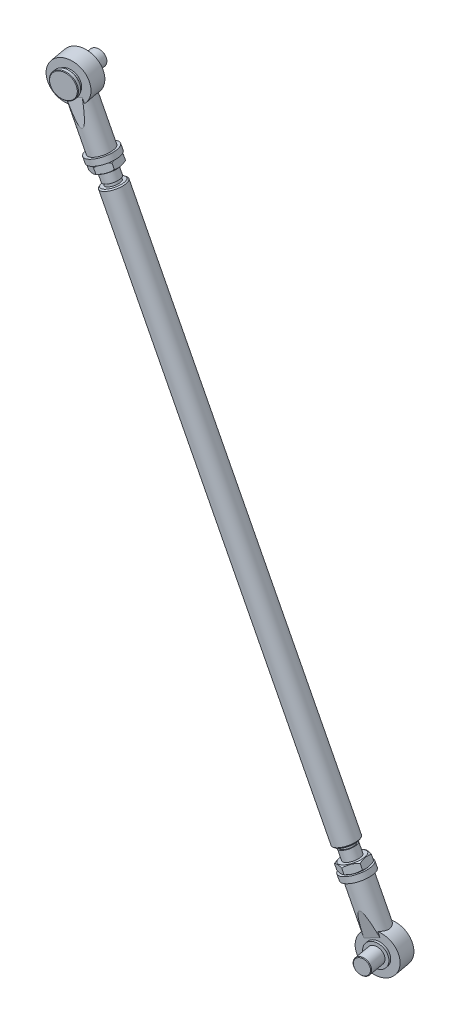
ISO-10303-21;
HEADER;
FILE_DESCRIPTION(('STEP AP214'),'2;1');
FILE_NAME('part.step','',(''),(''),'','','');
FILE_SCHEMA(('AUTOMOTIVE_DESIGN { 1 0 10303 214 1 1 1 1 }'));
ENDSEC;
DATA;
#1=APPLICATION_CONTEXT('core data for automotive mechanical design processes');
#2=APPLICATION_PROTOCOL_DEFINITION('international standard','automotive_design',2000,#1);
#3=PRODUCT_CONTEXT('',#1,'mechanical');
#4=PRODUCT('Part','Part','',(#3));
#5=PRODUCT_RELATED_PRODUCT_CATEGORY('part','',(#4));
#6=PRODUCT_DEFINITION_FORMATION('','',#4);
#7=PRODUCT_DEFINITION_CONTEXT('part definition',#1,'design');
#8=PRODUCT_DEFINITION('design','',#6,#7);
#9=PRODUCT_DEFINITION_SHAPE('','',#8);
#10=(LENGTH_UNIT() NAMED_UNIT(*) SI_UNIT(.MILLI.,.METRE.));
#11=(NAMED_UNIT(*) PLANE_ANGLE_UNIT() SI_UNIT($,.RADIAN.));
#12=(NAMED_UNIT(*) SI_UNIT($,.STERADIAN.) SOLID_ANGLE_UNIT());
#13=UNCERTAINTY_MEASURE_WITH_UNIT(LENGTH_MEASURE(1.E-05),#10,'distance_accuracy_value','');
#14=(GEOMETRIC_REPRESENTATION_CONTEXT(3) GLOBAL_UNCERTAINTY_ASSIGNED_CONTEXT((#13)) GLOBAL_UNIT_ASSIGNED_CONTEXT((#10,
#11,#12)) REPRESENTATION_CONTEXT('',''));
#15=CARTESIAN_POINT('',(0.,0.,0.));
#16=DIRECTION('',(0.,0.,1.));
#17=DIRECTION('',(1.,0.,0.));
#18=AXIS2_PLACEMENT_3D('',#15,#16,#17);
#19=CARTESIAN_POINT('',(34.6371377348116,564.342069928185,-157.967704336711));
#20=DIRECTION('',(0.374993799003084,-0.924642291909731,-0.0664551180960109));
#21=DIRECTION('',(0.174497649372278,0.,0.984657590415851));
#22=AXIS2_PLACEMENT_3D('',#19,#20,#21);
#23=CYLINDRICAL_SURFACE('',#22,7.);
#24=CARTESIAN_POINT('',(-155.297221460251,1032.67339078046,-124.308187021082));
#25=DIRECTION('',(0.374993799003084,-0.924642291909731,-0.0664551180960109));
#26=DIRECTION('',(0.174497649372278,0.,0.984657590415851));
#27=AXIS2_PLACEMENT_3D('',#24,#25,#26);
#28=CIRCLE('',#27,7.);
#29=CARTESIAN_POINT('',(-154.075737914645,1032.67339078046,-117.415583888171));
#30=VERTEX_POINT('',#29);
#31=EDGE_CURVE('E553',#30,#30,#28,.T.);
#32=ORIENTED_EDGE('',*,*,#31,.F.);
#33=EDGE_LOOP('',(#32));
#34=FACE_BOUND('',#33,.T.);
#35=CARTESIAN_POINT('',(-158.484668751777,1040.5328502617,-123.743318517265));
#36=DIRECTION('',(-0.374993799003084,0.924642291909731,0.0664551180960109));
#37=DIRECTION('',(-0.174497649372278,0.,-0.984657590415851));
#38=AXIS2_PLACEMENT_3D('',#35,#36,#37);
#39=CIRCLE('',#38,7.);
#40=CARTESIAN_POINT('',(-159.706152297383,1040.5328502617,-130.635921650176));
#41=VERTEX_POINT('',#40);
#42=EDGE_CURVE('E11',#41,#41,#39,.F.);
#43=ORIENTED_EDGE('',*,*,#42,.T.);
#44=EDGE_LOOP('',(#43));
#45=FACE_BOUND('',#44,.T.);
#46=ADVANCED_FACE('F17',(#34,#45),#23,.T.);
#47=CARTESIAN_POINT('',(34.6371377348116,564.342069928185,-157.967704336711));
#48=DIRECTION('',(0.374993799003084,-0.924642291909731,-0.0664551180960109));
#49=DIRECTION('',(0.174497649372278,0.,0.984657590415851));
#50=AXIS2_PLACEMENT_3D('',#47,#48,#49);
#51=CYLINDRICAL_SURFACE('',#50,7.);
#52=CARTESIAN_POINT('',(23.7623175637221,591.156696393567,-156.040505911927));
#53=DIRECTION('',(-0.374993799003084,0.924642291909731,0.0664551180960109));
#54=DIRECTION('',(-0.174497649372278,0.,-0.984657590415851));
#55=AXIS2_PLACEMENT_3D('',#52,#53,#54);
#56=CIRCLE('',#55,7.);
#57=CARTESIAN_POINT('',(22.5408340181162,591.156696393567,-162.933109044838));
#58=VERTEX_POINT('',#57);
#59=EDGE_CURVE('E666',#58,#58,#56,.T.);
#60=ORIENTED_EDGE('',*,*,#59,.T.);
#61=EDGE_LOOP('',(#60));
#62=FACE_BOUND('',#61,.T.);
#63=CARTESIAN_POINT('',(20.5748702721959,599.0161558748,-155.475637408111));
#64=DIRECTION('',(0.374993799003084,-0.924642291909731,-0.0664551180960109));
#65=DIRECTION('',(0.174497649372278,0.,0.984657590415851));
#66=AXIS2_PLACEMENT_3D('',#63,#64,#65);
#67=CIRCLE('',#66,7.);
#68=CARTESIAN_POINT('',(21.7963538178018,599.0161558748,-148.5830342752));
#69=VERTEX_POINT('',#68);
#70=EDGE_CURVE('E646',#69,#69,#67,.T.);
#71=ORIENTED_EDGE('',*,*,#70,.T.);
#72=EDGE_LOOP('',(#71));
#73=FACE_BOUND('',#72,.T.);
#74=ADVANCED_FACE('F436',(#62,#73),#51,.T.);
#75=CARTESIAN_POINT('',(19.5278843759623,599.0161558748,-161.383582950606));
#76=DIRECTION('',(0.374993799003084,-0.924642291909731,-0.0664551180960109));
#77=DIRECTION('',(0.174497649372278,0.,0.984657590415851));
#78=AXIS2_PLACEMENT_3D('',#75,#76,#77);
#79=PLANE('',#78);
#80=ORIENTED_EDGE('',*,*,#70,.F.);
#81=EDGE_LOOP('',(#80));
#82=FACE_BOUND('',#81,.T.);
#83=CARTESIAN_POINT('',(20.5748702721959,599.0161558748,-155.475637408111));
#84=DIRECTION('',(0.374993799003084,-0.924642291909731,-0.0664551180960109));
#85=DIRECTION('',(0.174497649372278,0.,0.984657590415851));
#86=AXIS2_PLACEMENT_3D('',#83,#84,#85);
#87=CIRCLE('',#86,6.);
#88=CARTESIAN_POINT('',(21.6218561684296,599.0161558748,-149.567691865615));
#89=VERTEX_POINT('',#88);
#90=EDGE_CURVE('E642',#89,#89,#87,.T.);
#91=ORIENTED_EDGE('',*,*,#90,.T.);
#92=EDGE_LOOP('',(#91));
#93=FACE_BOUND('',#92,.T.);
#94=ADVANCED_FACE('F442',(#82,#93),#79,.F.);
#95=CARTESIAN_POINT('',(34.6371377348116,564.342069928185,-157.967704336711));
#96=DIRECTION('',(0.374993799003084,-0.924642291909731,-0.0664551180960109));
#97=DIRECTION('',(0.174497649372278,0.,0.984657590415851));
#98=AXIS2_PLACEMENT_3D('',#95,#96,#97);
#99=CYLINDRICAL_SURFACE('',#98,6.);
#100=ORIENTED_EDGE('',*,*,#90,.F.);
#101=EDGE_LOOP('',(#100));
#102=FACE_BOUND('',#101,.T.);
#103=CARTESIAN_POINT('',(19.6373857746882,601.327761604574,-155.309499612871));
#104=DIRECTION('',(0.374993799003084,-0.924642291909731,-0.0664551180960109));
#105=DIRECTION('',(0.174497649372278,0.,0.984657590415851));
#106=AXIS2_PLACEMENT_3D('',#103,#104,#105);
#107=CIRCLE('',#106,6.);
#108=CARTESIAN_POINT('',(20.6843716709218,601.327761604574,-149.401554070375));
#109=VERTEX_POINT('',#108);
#110=EDGE_CURVE('E638',#109,#109,#107,.T.);
#111=ORIENTED_EDGE('',*,*,#110,.T.);
#112=EDGE_LOOP('',(#111));
#113=FACE_BOUND('',#112,.T.);
#114=ADVANCED_FACE('F471',(#102,#113),#99,.T.);
#115=CARTESIAN_POINT('',(18.4159022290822,601.327761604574,-162.202102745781));
#116=DIRECTION('',(-0.374993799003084,0.924642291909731,0.0664551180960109));
#117=DIRECTION('',(-0.174497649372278,0.,-0.984657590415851));
#118=AXIS2_PLACEMENT_3D('',#115,#116,#117);
#119=PLANE('',#118);
#120=CARTESIAN_POINT('',(19.6373857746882,601.327761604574,-155.309499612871));
#121=DIRECTION('',(-0.374993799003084,0.924642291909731,0.0664551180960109));
#122=DIRECTION('',(-0.174497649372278,0.,-0.984657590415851));
#123=AXIS2_PLACEMENT_3D('',#120,#121,#122);
#124=CIRCLE('',#123,9.);
#125=CARTESIAN_POINT('',(18.0669069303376,601.327761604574,-164.171417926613));
#126=VERTEX_POINT('',#125);
#127=EDGE_CURVE('E662',#126,#126,#124,.F.);
#128=ORIENTED_EDGE('',*,*,#127,.T.);
#129=EDGE_LOOP('',(#128));
#130=FACE_BOUND('',#129,.T.);
#131=ORIENTED_EDGE('',*,*,#110,.F.);
#132=EDGE_LOOP('',(#131));
#133=FACE_BOUND('',#132,.T.);
#134=ADVANCED_FACE('F467',(#130,#133),#119,.F.);
#135=CARTESIAN_POINT('',(34.6371377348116,564.342069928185,-157.967704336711));
#136=DIRECTION('',(0.374993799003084,-0.924642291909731,-0.0664551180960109));
#137=DIRECTION('',(0.174497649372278,0.,0.984657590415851));
#138=AXIS2_PLACEMENT_3D('',#135,#136,#137);
#139=CYLINDRICAL_SURFACE('',#138,10.);
#140=CARTESIAN_POINT('',(-153.98474316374,1029.43714275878,-124.540779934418));
#141=DIRECTION('',(0.374993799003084,-0.924642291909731,-0.0664551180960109));
#142=DIRECTION('',(0.174497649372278,0.,0.984657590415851));
#143=AXIS2_PLACEMENT_3D('',#140,#141,#142);
#144=CIRCLE('',#143,10.);
#145=CARTESIAN_POINT('',(-152.239766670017,1029.43714275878,-114.694204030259));
#146=VERTEX_POINT('',#145);
#147=EDGE_CURVE('E654',#146,#146,#144,.T.);
#148=ORIENTED_EDGE('',*,*,#147,.T.);
#149=EDGE_LOOP('',(#148));
#150=FACE_BOUND('',#149,.T.);
#151=CARTESIAN_POINT('',(19.2623919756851,602.252403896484,-155.243044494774));
#152=DIRECTION('',(-0.374993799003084,0.924642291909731,0.0664551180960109));
#153=DIRECTION('',(-0.174497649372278,0.,-0.984657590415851));
#154=AXIS2_PLACEMENT_3D('',#151,#152,#153);
#155=CIRCLE('',#154,10.);
#156=CARTESIAN_POINT('',(17.5174154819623,602.252403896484,-165.089620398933));
#157=VERTEX_POINT('',#156);
#158=EDGE_CURVE('E650',#157,#157,#155,.T.);
#159=ORIENTED_EDGE('',*,*,#158,.T.);
#160=EDGE_LOOP('',(#159));
#161=FACE_BOUND('',#160,.T.);
#162=ADVANCED_FACE('F463',(#150,#161),#139,.T.);
#163=CARTESIAN_POINT('',(-155.581220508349,1030.36178505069,-131.366927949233));
#164=DIRECTION('',(0.374993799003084,-0.924642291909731,-0.0664551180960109));
#165=DIRECTION('',(0.174497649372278,0.,0.984657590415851));
#166=AXIS2_PLACEMENT_3D('',#163,#164,#165);
#167=PLANE('',#166);
#168=CARTESIAN_POINT('',(-154.359736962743,1030.36178505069,-124.474324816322));
#169=DIRECTION('',(0.374993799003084,-0.924642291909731,-0.0664551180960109));
#170=DIRECTION('',(0.174497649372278,0.,0.984657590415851));
#171=AXIS2_PLACEMENT_3D('',#168,#169,#170);
#172=CIRCLE('',#171,9.);
#173=CARTESIAN_POINT('',(-152.789258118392,1030.36178505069,-115.612406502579));
#174=VERTEX_POINT('',#173);
#175=EDGE_CURVE('E658',#174,#174,#172,.F.);
#176=ORIENTED_EDGE('',*,*,#175,.T.);
#177=EDGE_LOOP('',(#176));
#178=FACE_BOUND('',#177,.T.);
#179=CARTESIAN_POINT('',(-154.359736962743,1030.36178505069,-124.474324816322));
#180=DIRECTION('',(0.374993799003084,-0.924642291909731,-0.0664551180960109));
#181=DIRECTION('',(0.174497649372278,0.,0.984657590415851));
#182=AXIS2_PLACEMENT_3D('',#179,#180,#181);
#183=CIRCLE('',#182,6.);
#184=CARTESIAN_POINT('',(-153.312751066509,1030.36178505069,-118.566379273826));
#185=VERTEX_POINT('',#184);
#186=EDGE_CURVE('E634',#185,#185,#183,.T.);
#187=ORIENTED_EDGE('',*,*,#186,.T.);
#188=EDGE_LOOP('',(#187));
#189=FACE_BOUND('',#188,.T.);
#190=ADVANCED_FACE('F459',(#178,#189),#167,.F.);
#191=CARTESIAN_POINT('',(34.6371377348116,564.342069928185,-157.967704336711));
#192=DIRECTION('',(0.374993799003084,-0.924642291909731,-0.0664551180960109));
#193=DIRECTION('',(0.174497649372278,0.,0.984657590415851));
#194=AXIS2_PLACEMENT_3D('',#191,#192,#193);
#195=CYLINDRICAL_SURFACE('',#194,6.);
#196=ORIENTED_EDGE('',*,*,#186,.F.);
#197=EDGE_LOOP('',(#196));
#198=FACE_BOUND('',#197,.T.);
#199=CARTESIAN_POINT('',(-155.297221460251,1032.67339078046,-124.308187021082));
#200=DIRECTION('',(0.374993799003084,-0.924642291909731,-0.0664551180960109));
#201=DIRECTION('',(0.174497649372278,0.,0.984657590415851));
#202=AXIS2_PLACEMENT_3D('',#199,#200,#201);
#203=CIRCLE('',#202,6.);
#204=CARTESIAN_POINT('',(-154.250235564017,1032.67339078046,-118.400241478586));
#205=VERTEX_POINT('',#204);
#206=EDGE_CURVE('E630',#205,#205,#203,.T.);
#207=ORIENTED_EDGE('',*,*,#206,.T.);
#208=EDGE_LOOP('',(#207));
#209=FACE_BOUND('',#208,.T.);
#210=ADVANCED_FACE('F455',(#198,#209),#195,.T.);
#211=CARTESIAN_POINT('',(-156.344207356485,1032.67339078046,-130.216132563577));
#212=DIRECTION('',(-0.374993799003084,0.924642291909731,0.0664551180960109));
#213=DIRECTION('',(-0.174497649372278,0.,-0.984657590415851));
#214=AXIS2_PLACEMENT_3D('',#211,#212,#213);
#215=PLANE('',#214);
#216=ORIENTED_EDGE('',*,*,#206,.F.);
#217=EDGE_LOOP('',(#216));
#218=FACE_BOUND('',#217,.T.);
#219=ORIENTED_EDGE('',*,*,#31,.T.);
#220=EDGE_LOOP('',(#219));
#221=FACE_BOUND('',#220,.T.);
#222=ADVANCED_FACE('F451',(#218,#221),#215,.F.);
#223=CARTESIAN_POINT('',(-153.98474316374,1029.43714275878,-124.540779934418));
#224=DIRECTION('',(0.374993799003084,-0.924642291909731,-0.0664551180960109));
#225=DIRECTION('',(0.174497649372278,0.,0.984657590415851));
#226=AXIS2_PLACEMENT_3D('',#223,#224,#225);
#227=CONICAL_SURFACE('',#226,10.,0.785398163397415);
#228=ORIENTED_EDGE('',*,*,#175,.F.);
#229=EDGE_LOOP('',(#228));
#230=FACE_BOUND('',#229,.T.);
#231=ORIENTED_EDGE('',*,*,#147,.F.);
#232=EDGE_LOOP('',(#231));
#233=FACE_BOUND('',#232,.T.);
#234=ADVANCED_FACE('F454',(#230,#233),#227,.T.);
#235=CARTESIAN_POINT('',(19.6373857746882,601.327761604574,-155.309499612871));
#236=DIRECTION('',(-0.374993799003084,0.924642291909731,0.0664551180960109));
#237=DIRECTION('',(-0.174497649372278,0.,-0.984657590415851));
#238=AXIS2_PLACEMENT_3D('',#235,#236,#237);
#239=CONICAL_SURFACE('',#238,9.,0.785398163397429);
#240=ORIENTED_EDGE('',*,*,#158,.F.);
#241=EDGE_LOOP('',(#240));
#242=FACE_BOUND('',#241,.T.);
#243=ORIENTED_EDGE('',*,*,#127,.F.);
#244=EDGE_LOOP('',(#243));
#245=FACE_BOUND('',#244,.T.);
#246=ADVANCED_FACE('F481',(#242,#245),#239,.T.);
#247=CARTESIAN_POINT('',(32.2642703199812,595.155482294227,-163.703828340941));
#248=DIRECTION('',(-0.374993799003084,0.924642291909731,0.0664551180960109));
#249=DIRECTION('',(-0.174497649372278,0.,-0.984657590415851));
#250=AXIS2_PLACEMENT_3D('',#247,#248,#249);
#251=PLANE('',#250);
#252=CARTESIAN_POINT('',(23.7623175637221,591.156696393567,-156.040505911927));
#253=DIRECTION('',(0.374993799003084,-0.924642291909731,-0.0664551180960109));
#254=DIRECTION('',(0.174497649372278,0.,0.984657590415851));
#255=AXIS2_PLACEMENT_3D('',#252,#253,#254);
#256=CIRCLE('',#255,10.125);
#257=CARTESIAN_POINT('',(25.5291062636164,591.156696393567,-146.070847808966));
#258=VERTEX_POINT('',#257);
#259=EDGE_CURVE('E949',#258,#258,#256,.T.);
#260=ORIENTED_EDGE('',*,*,#259,.F.);
#261=EDGE_LOOP('',(#260));
#262=FACE_BOUND('',#261,.T.);
#263=ORIENTED_EDGE('',*,*,#59,.F.);
#264=EDGE_LOOP('',(#263));
#265=FACE_BOUND('',#264,.T.);
#266=ADVANCED_FACE('F365',(#262,#265),#251,.T.);
#267=CARTESIAN_POINT('',(26.3872741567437,584.684200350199,-156.505691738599));
#268=DIRECTION('',(0.374993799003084,-0.924642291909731,-0.0664551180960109));
#269=DIRECTION('',(0.910456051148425,0.380836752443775,-0.161347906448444));
#270=AXIS2_PLACEMENT_3D('',#267,#268,#269);
#271=PLANE('',#270);
#272=CARTESIAN_POINT('',(26.3872741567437,584.684200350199,-156.505691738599));
#273=DIRECTION('',(-0.374993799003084,0.924642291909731,0.0664551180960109));
#274=DIRECTION('',(-0.174497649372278,0.,-0.984657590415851));
#275=AXIS2_PLACEMENT_3D('',#272,#273,#274);
#276=CIRCLE('',#275,10.125);
#277=CARTESIAN_POINT('',(24.6204854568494,584.684200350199,-166.47534984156));
#278=VERTEX_POINT('',#277);
#279=EDGE_CURVE('E408',#278,#278,#276,.T.);
#280=ORIENTED_EDGE('',*,*,#279,.F.);
#281=EDGE_LOOP('',(#280));
#282=FACE_BOUND('',#281,.T.);
#283=CARTESIAN_POINT('',(26.3872741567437,584.684200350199,-156.505691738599));
#284=DIRECTION('',(0.374993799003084,-0.924642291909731,-0.0664551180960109));
#285=DIRECTION('',(0.910456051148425,0.380836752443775,-0.161347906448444));
#286=AXIS2_PLACEMENT_3D('',#283,#284,#285);
#287=CIRCLE('',#286,12.5);
#288=CARTESIAN_POINT('',(37.767974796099,589.444659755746,-158.522540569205));
#289=VERTEX_POINT('',#288);
#290=EDGE_CURVE('E753',#289,#289,#287,.T.);
#291=ORIENTED_EDGE('',*,*,#290,.F.);
#292=EDGE_LOOP('',(#291));
#293=FACE_BOUND('',#292,.T.);
#294=ADVANCED_FACE('F1003',(#282,#293),#271,.F.);
#295=CARTESIAN_POINT('',(49.4196483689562,531.979589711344,-150.939386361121));
#296=DIRECTION('',(0.174497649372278,0.,0.984657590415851));
#297=DIRECTION('',(0.910456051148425,0.380836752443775,-0.161347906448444));
#298=AXIS2_PLACEMENT_3D('',#295,#296,#297);
#299=PLANE('',#298);
#300=CARTESIAN_POINT('',(49.4196483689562,531.979589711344,-150.939386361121));
#301=DIRECTION('',(0.174497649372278,0.,0.984657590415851));
#302=DIRECTION('',(-0.374993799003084,0.924642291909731,0.0664551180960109));
#303=AXIS2_PLACEMENT_3D('',#300,#301,#302);
#304=CIRCLE('',#303,7.);
#305=CARTESIAN_POINT('',(46.7946917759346,538.452085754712,-150.474200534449));
#306=VERTEX_POINT('',#305);
#307=EDGE_CURVE('E670',#306,#306,#304,.T.);
#308=ORIENTED_EDGE('',*,*,#307,.F.);
#309=EDGE_LOOP('',(#308));
#310=FACE_BOUND('',#309,.T.);
#311=CARTESIAN_POINT('',(49.4196483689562,531.979589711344,-150.939386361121));
#312=DIRECTION('',(0.174497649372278,0.,0.984657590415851));
#313=DIRECTION('',(0.910456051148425,0.380836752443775,-0.161347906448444));
#314=AXIS2_PLACEMENT_3D('',#311,#312,#313);
#315=CIRCLE('',#314,9.93883905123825);
#316=CARTESIAN_POINT('',(58.4685245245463,535.764664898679,-152.542997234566));
#317=VERTEX_POINT('',#316);
#318=EDGE_CURVE('E757',#317,#317,#315,.F.);
#319=ORIENTED_EDGE('',*,*,#318,.F.);
#320=EDGE_LOOP('',(#319));
#321=FACE_BOUND('',#320,.T.);
#322=ADVANCED_FACE('F993',(#310,#321),#299,.T.);
#323=CARTESIAN_POINT('',(46.4531883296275,531.979589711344,-167.67856539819));
#324=DIRECTION('',(-0.174497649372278,0.,-0.984657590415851));
#325=DIRECTION('',(-0.910456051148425,-0.380836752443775,0.161347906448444));
#326=AXIS2_PLACEMENT_3D('',#323,#324,#325);
#327=CYLINDRICAL_SURFACE('',#326,9.93883905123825);
#328=CARTESIAN_POINT('',(46.4531883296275,531.979589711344,-167.67856539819));
#329=DIRECTION('',(-0.174497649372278,0.,-0.984657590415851));
#330=DIRECTION('',(-0.910456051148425,-0.380836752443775,0.161347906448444));
#331=AXIS2_PLACEMENT_3D('',#328,#329,#330);
#332=CIRCLE('',#331,9.93883905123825);
#333=CARTESIAN_POINT('',(37.4043121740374,528.194514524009,-166.074954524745));
#334=VERTEX_POINT('',#333);
#335=EDGE_CURVE('E763',#334,#334,#332,.F.);
#336=ORIENTED_EDGE('',*,*,#335,.F.);
#337=EDGE_LOOP('',(#336));
#338=FACE_BOUND('',#337,.T.);
#339=CARTESIAN_POINT('',(46.1041930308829,531.979589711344,-169.647880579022));
#340=DIRECTION('',(0.174497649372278,0.,0.984657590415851));
#341=DIRECTION('',(0.910456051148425,0.380836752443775,-0.161347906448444));
#342=AXIS2_PLACEMENT_3D('',#339,#340,#341);
#343=CIRCLE('',#342,9.93883905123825);
#344=CARTESIAN_POINT('',(55.153069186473,535.764664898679,-171.251491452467));
#345=VERTEX_POINT('',#344);
#346=EDGE_CURVE('E758',#345,#345,#343,.F.);
#347=ORIENTED_EDGE('',*,*,#346,.F.);
#348=EDGE_LOOP('',(#347));
#349=FACE_BOUND('',#348,.T.);
#350=ADVANCED_FACE('F990',(#338,#349),#327,.T.);
#351=CARTESIAN_POINT('',(44.3656018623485,540.354074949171,-159.691749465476));
#352=DIRECTION('',(0.374993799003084,-0.924642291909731,-0.0664551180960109));
#353=DIRECTION('',(0.910456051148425,0.380836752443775,-0.161347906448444));
#354=AXIS2_PLACEMENT_3D('',#351,#352,#353);
#355=CYLINDRICAL_SURFACE('',#354,12.5);
#356=CARTESIAN_POINT('',(28.262243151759,580.06098889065,-156.837967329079));
#357=DIRECTION('',(0.374993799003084,-0.924642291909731,-0.0664551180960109));
#358=DIRECTION('',(0.910456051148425,0.380836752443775,-0.161347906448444));
#359=AXIS2_PLACEMENT_3D('',#356,#357,#358);
#360=CIRCLE('',#359,12.5);
#361=CARTESIAN_POINT('',(39.6429437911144,584.821448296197,-158.854816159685));
#362=VERTEX_POINT('',#361);
#363=EDGE_CURVE('E766',#362,#362,#360,.F.);
#364=ORIENTED_EDGE('',*,*,#363,.T.);
#365=EDGE_LOOP('',(#364));
#366=FACE_BOUND('',#365,.T.);
#367=ORIENTED_EDGE('',*,*,#290,.T.);
#368=EDGE_LOOP('',(#367));
#369=FACE_BOUND('',#368,.T.);
#370=ADVANCED_FACE('F992',(#366,#369),#355,.T.);
#371=CARTESIAN_POINT('',(49.0706530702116,531.979589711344,-152.908701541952));
#372=DIRECTION('',(0.174497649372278,0.,0.984657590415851));
#373=DIRECTION('',(0.910456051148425,0.380836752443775,-0.161347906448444));
#374=AXIS2_PLACEMENT_3D('',#371,#372,#373);
#375=CYLINDRICAL_SURFACE('',#374,9.93883905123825);
#376=CARTESIAN_POINT('',(49.0706530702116,531.979589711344,-152.908701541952));
#377=DIRECTION('',(0.174497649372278,0.,0.984657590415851));
#378=DIRECTION('',(0.910456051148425,0.380836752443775,-0.161347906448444));
#379=AXIS2_PLACEMENT_3D('',#376,#377,#378);
#380=CIRCLE('',#379,9.93883905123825);
#381=CARTESIAN_POINT('',(58.1195292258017,535.764664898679,-154.512312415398));
#382=VERTEX_POINT('',#381);
#383=EDGE_CURVE('E772',#382,#382,#380,.T.);
#384=ORIENTED_EDGE('',*,*,#383,.T.);
#385=EDGE_LOOP('',(#384));
#386=FACE_BOUND('',#385,.T.);
#387=ORIENTED_EDGE('',*,*,#318,.T.);
#388=EDGE_LOOP('',(#387));
#389=FACE_BOUND('',#388,.T.);
#390=ADVANCED_FACE('F1000',(#386,#389),#375,.T.);
#391=CARTESIAN_POINT('',(43.8965121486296,565.176580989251,-169.755486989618));
#392=DIRECTION('',(0.0739768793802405,0.233869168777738,0.96944965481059));
#393=DIRECTION('',(0.406936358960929,-0.894577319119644,0.184754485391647));
#394=AXIS2_PLACEMENT_3D('',#391,#392,#393);
#395=PLANE('',#394);
#396=CARTESIAN_POINT('',(50.2749160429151,525.783162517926,-160.738977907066));
#397=DIRECTION('',(0.0739768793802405,0.233869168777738,0.96944965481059));
#398=DIRECTION('',(0.406936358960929,-0.894577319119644,0.184754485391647));
#399=AXIS2_PLACEMENT_3D('',#396,#397,#398);
#400=ELLIPSE('',#399,39.5367331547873,10.);
#401=CARTESIAN_POINT('',(34.5822328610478,561.280489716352,-168.104842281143));
#402=VERTEX_POINT('',#401);
#403=CARTESIAN_POINT('',(33.81807754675,560.960849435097,-167.969421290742));
#404=VERTEX_POINT('',#403);
#405=EDGE_CURVE('E788',#402,#404,#400,.T.);
#406=ORIENTED_EDGE('',*,*,#405,.F.);
#407=DIRECTION('',(0.910456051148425,0.380836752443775,-0.161347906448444));
#408=VECTOR('',#407,1.);
#409=CARTESIAN_POINT('',(43.8965121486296,565.176580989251,-169.755486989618));
#410=LINE('',#409,#408);
#411=EDGE_CURVE('E762',#402,#404,#410,.F.);
#412=ORIENTED_EDGE('',*,*,#411,.T.);
#413=EDGE_LOOP('',(#406,#412));
#414=FACE_BOUND('',#413,.T.);
#415=ADVANCED_FACE('F879',(#414),#395,.F.);
#416=CARTESIAN_POINT('',(51.8971155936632,546.520944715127,-168.643319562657));
#417=DIRECTION('',(0.127230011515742,0.113307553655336,0.985380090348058));
#418=DIRECTION('',(0.39355089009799,-0.917673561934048,0.0547076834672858));
#419=AXIS2_PLACEMENT_3D('',#416,#417,#418);
#420=PLANE('',#419);
#421=CARTESIAN_POINT('',(66.2874447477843,486.300212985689,-163.576663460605));
#422=DIRECTION('',(0.127230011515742,0.113307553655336,0.985380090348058));
#423=DIRECTION('',(0.39355089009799,-0.917673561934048,0.0547076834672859));
#424=AXIS2_PLACEMENT_3D('',#421,#422,#423);
#425=ELLIPSE('',#424,81.6046470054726,10.);
#426=CARTESIAN_POINT('',(36.1786579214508,539.946034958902,-165.857748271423));
#427=VERTEX_POINT('',#426);
#428=EDGE_CURVE('E792',#404,#427,#425,.T.);
#429=ORIENTED_EDGE('',*,*,#428,.F.);
#430=ORIENTED_EDGE('',*,*,#411,.F.);
#431=CARTESIAN_POINT('',(66.2874447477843,486.300212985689,-163.576663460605));
#432=DIRECTION('',(0.127230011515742,0.113307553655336,0.985380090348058));
#433=DIRECTION('',(0.39355089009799,-0.917673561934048,0.0547076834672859));
#434=AXIS2_PLACEMENT_3D('',#431,#432,#433);
#435=ELLIPSE('',#434,81.6046470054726,10.);
#436=CARTESIAN_POINT('',(48.222859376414,544.9840316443,-167.99218044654));
#437=VERTEX_POINT('',#436);
#438=EDGE_CURVE('E785',#437,#402,#435,.T.);
#439=ORIENTED_EDGE('',*,*,#438,.F.);
#440=DIRECTION('',(-0.910456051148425,-0.380836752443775,0.161347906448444));
#441=VECTOR('',#440,1.);
#442=CARTESIAN_POINT('',(42.2007586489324,542.465033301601,-166.924964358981));
#443=LINE('',#442,#441);
#444=EDGE_CURVE('E767',#427,#437,#443,.F.);
#445=ORIENTED_EDGE('',*,*,#444,.F.);
#446=EDGE_LOOP('',(#429,#430,#439,#445));
#447=FACE_BOUND('',#446,.T.);
#448=ADVANCED_FACE('F884',(#447),#420,.F.);
#449=CARTESIAN_POINT('',(46.4531883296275,531.979589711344,-167.67856539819));
#450=DIRECTION('',(-0.174497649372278,0.,-0.984657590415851));
#451=DIRECTION('',(-0.910456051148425,-0.380836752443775,0.161347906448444));
#452=AXIS2_PLACEMENT_3D('',#449,#450,#451);
#453=PLANE('',#452);
#454=ORIENTED_EDGE('',*,*,#335,.T.);
#455=EDGE_LOOP('',(#454));
#456=FACE_BOUND('',#455,.T.);
#457=CARTESIAN_POINT('',(46.4531883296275,531.979589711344,-167.67856539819));
#458=DIRECTION('',(0.174497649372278,0.,0.984657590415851));
#459=DIRECTION('',(0.910456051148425,0.380836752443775,-0.161347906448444));
#460=AXIS2_PLACEMENT_3D('',#457,#458,#459);
#461=CIRCLE('',#460,17.);
#462=CARTESIAN_POINT('',(34.5585123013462,543.940914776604,-165.570631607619));
#463=VERTEX_POINT('',#462);
#464=CARTESIAN_POINT('',(46.6027137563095,548.978911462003,-167.705063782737));
#465=VERTEX_POINT('',#464);
#466=EDGE_CURVE('E776',#463,#465,#461,.T.);
#467=ORIENTED_EDGE('',*,*,#466,.F.);
#468=DIRECTION('',(0.374993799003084,-0.924642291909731,-0.0664551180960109));
#469=VECTOR('',#468,1.);
#470=CARTESIAN_POINT('',(37.0347687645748,537.835076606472,-166.009465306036));
#471=LINE('',#470,#469);
#472=EDGE_CURVE('E796',#427,#463,#471,.F.);
#473=ORIENTED_EDGE('',*,*,#472,.F.);
#474=ORIENTED_EDGE('',*,*,#444,.T.);
#475=DIRECTION('',(0.374993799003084,-0.924642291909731,-0.0664551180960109));
#476=VECTOR('',#475,1.);
#477=CARTESIAN_POINT('',(49.0789702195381,542.87307329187,-168.143897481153));
#478=LINE('',#477,#476);
#479=EDGE_CURVE('E784',#465,#437,#478,.T.);
#480=ORIENTED_EDGE('',*,*,#479,.F.);
#481=EDGE_LOOP('',(#467,#473,#474,#480));
#482=FACE_BOUND('',#481,.T.);
#483=ADVANCED_FACE('F1208',(#456,#482),#453,.T.);
#484=CARTESIAN_POINT('',(16.8815425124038,575.300529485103,-154.821118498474));
#485=DIRECTION('',(-0.374993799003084,0.924642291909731,0.0664551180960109));
#486=DIRECTION('',(-0.910456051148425,-0.380836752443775,0.161347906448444));
#487=AXIS2_PLACEMENT_3D('',#484,#485,#486);
#488=PLANE('',#487);
#489=ORIENTED_EDGE('',*,*,#363,.F.);
#490=EDGE_LOOP('',(#489));
#491=FACE_BOUND('',#490,.T.);
#492=CARTESIAN_POINT('',(28.262243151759,580.06098889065,-156.837967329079));
#493=DIRECTION('',(0.374993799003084,-0.924642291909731,-0.0664551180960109));
#494=DIRECTION('',(0.910456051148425,0.380836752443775,-0.161347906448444));
#495=AXIS2_PLACEMENT_3D('',#492,#493,#494);
#496=CIRCLE('',#495,10.);
#497=CARTESIAN_POINT('',(37.3668036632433,583.869356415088,-158.451446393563));
#498=VERTEX_POINT('',#497);
#499=EDGE_CURVE('E292',#498,#498,#496,.T.);
#500=ORIENTED_EDGE('',*,*,#499,.F.);
#501=EDGE_LOOP('',(#500));
#502=FACE_BOUND('',#501,.T.);
#503=ADVANCED_FACE('F1202',(#491,#502),#488,.F.);
#504=CARTESIAN_POINT('',(47.3833906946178,565.176580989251,-150.07968367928));
#505=DIRECTION('',(0.263670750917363,-0.233869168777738,0.935832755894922));
#506=DIRECTION('',(0.318665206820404,-0.894577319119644,-0.313343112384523));
#507=AXIS2_PLACEMENT_3D('',#504,#505,#506);
#508=PLANE('',#507);
#509=CARTESIAN_POINT('',(50.2749160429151,525.783162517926,-160.738977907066));
#510=DIRECTION('',(0.263670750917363,-0.233869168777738,0.935832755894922));
#511=DIRECTION('',(0.318665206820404,-0.894577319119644,-0.313343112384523));
#512=AXIS2_PLACEMENT_3D('',#509,#510,#511);
#513=ELLIPSE('',#512,39.5367331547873,10.);
#514=CARTESIAN_POINT('',(37.3049560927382,560.960849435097,-148.293617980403));
#515=VERTEX_POINT('',#514);
#516=CARTESIAN_POINT('',(38.0691114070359,561.280489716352,-148.429038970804));
#517=VERTEX_POINT('',#516);
#518=EDGE_CURVE('E833',#515,#517,#513,.F.);
#519=ORIENTED_EDGE('',*,*,#518,.F.);
#520=DIRECTION('',(0.910456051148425,0.380836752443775,-0.161347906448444));
#521=VECTOR('',#520,1.);
#522=CARTESIAN_POINT('',(47.3833906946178,565.176580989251,-150.07968367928));
#523=LINE('',#522,#521);
#524=EDGE_CURVE('E771',#517,#515,#523,.F.);
#525=ORIENTED_EDGE('',*,*,#524,.F.);
#526=EDGE_LOOP('',(#519,#525));
#527=FACE_BOUND('',#526,.T.);
#528=ADVANCED_FACE('F1207',(#527),#508,.T.);
#529=CARTESIAN_POINT('',(54.5145803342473,546.520944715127,-153.87345570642));
#530=DIRECTION('',(0.219135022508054,-0.113307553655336,0.969092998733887));
#531=DIRECTION('',(0.350784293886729,-0.917673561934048,-0.186616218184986));
#532=AXIS2_PLACEMENT_3D('',#529,#530,#531);
#533=PLANE('',#532);
#534=CARTESIAN_POINT('',(66.2874447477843,486.300212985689,-163.576663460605));
#535=DIRECTION('',(0.219135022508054,-0.113307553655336,0.969092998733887));
#536=DIRECTION('',(0.350784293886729,-0.917673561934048,-0.186616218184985));
#537=AXIS2_PLACEMENT_3D('',#534,#535,#536);
#538=ELLIPSE('',#537,81.6046470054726,10.);
#539=CARTESIAN_POINT('',(38.796122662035,539.946034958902,-151.087884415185));
#540=VERTEX_POINT('',#539);
#541=EDGE_CURVE('E806',#540,#515,#538,.F.);
#542=ORIENTED_EDGE('',*,*,#541,.F.);
#543=DIRECTION('',(-0.910456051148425,-0.380836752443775,0.161347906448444));
#544=VECTOR('',#543,1.);
#545=CARTESIAN_POINT('',(44.8182233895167,542.465033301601,-152.155100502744));
#546=LINE('',#545,#544);
#547=CARTESIAN_POINT('',(50.8403241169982,544.9840316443,-153.222316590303));
#548=VERTEX_POINT('',#547);
#549=EDGE_CURVE('E777',#540,#548,#546,.F.);
#550=ORIENTED_EDGE('',*,*,#549,.T.);
#551=CARTESIAN_POINT('',(66.2874447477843,486.300212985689,-163.576663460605));
#552=DIRECTION('',(0.219135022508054,-0.113307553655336,0.969092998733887));
#553=DIRECTION('',(0.350784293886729,-0.917673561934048,-0.186616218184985));
#554=AXIS2_PLACEMENT_3D('',#551,#552,#553);
#555=ELLIPSE('',#554,81.6046470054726,10.);
#556=EDGE_CURVE('E830',#517,#548,#555,.F.);
#557=ORIENTED_EDGE('',*,*,#556,.F.);
#558=ORIENTED_EDGE('',*,*,#524,.T.);
#559=EDGE_LOOP('',(#542,#550,#557,#558));
#560=FACE_BOUND('',#559,.T.);
#561=ADVANCED_FACE('F1308',(#560),#533,.T.);
#562=CARTESIAN_POINT('',(49.0706530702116,531.979589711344,-152.908701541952));
#563=DIRECTION('',(-0.174497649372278,0.,-0.984657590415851));
#564=DIRECTION('',(-0.910456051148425,-0.380836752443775,0.161347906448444));
#565=AXIS2_PLACEMENT_3D('',#562,#563,#564);
#566=PLANE('',#565);
#567=ORIENTED_EDGE('',*,*,#383,.F.);
#568=EDGE_LOOP('',(#567));
#569=FACE_BOUND('',#568,.T.);
#570=DIRECTION('',(0.374993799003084,-0.924642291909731,-0.0664551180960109));
#571=VECTOR('',#570,1.);
#572=CARTESIAN_POINT('',(39.652233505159,537.835076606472,-151.239601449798));
#573=LINE('',#572,#571);
#574=CARTESIAN_POINT('',(37.1759770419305,543.940914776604,-150.800767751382));
#575=VERTEX_POINT('',#574);
#576=EDGE_CURVE('E291',#575,#540,#573,.T.);
#577=ORIENTED_EDGE('',*,*,#576,.F.);
#578=CARTESIAN_POINT('',(49.0706530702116,531.979589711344,-152.908701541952));
#579=DIRECTION('',(0.174497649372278,0.,0.984657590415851));
#580=DIRECTION('',(0.910456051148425,0.380836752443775,-0.161347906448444));
#581=AXIS2_PLACEMENT_3D('',#578,#579,#580);
#582=CIRCLE('',#581,17.);
#583=CARTESIAN_POINT('',(49.2201784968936,548.978911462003,-152.935199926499));
#584=VERTEX_POINT('',#583);
#585=EDGE_CURVE('E780',#584,#575,#582,.F.);
#586=ORIENTED_EDGE('',*,*,#585,.F.);
#587=DIRECTION('',(0.374993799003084,-0.924642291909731,-0.0664551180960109));
#588=VECTOR('',#587,1.);
#589=CARTESIAN_POINT('',(51.6964349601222,542.87307329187,-153.374033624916));
#590=LINE('',#589,#588);
#591=EDGE_CURVE('E828',#548,#584,#590,.F.);
#592=ORIENTED_EDGE('',*,*,#591,.F.);
#593=ORIENTED_EDGE('',*,*,#549,.F.);
#594=EDGE_LOOP('',(#577,#586,#592,#593));
#595=FACE_BOUND('',#594,.T.);
#596=ADVANCED_FACE('F1313',(#569,#595),#566,.F.);
#597=CARTESIAN_POINT('',(46.1041930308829,531.979589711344,-169.647880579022));
#598=DIRECTION('',(0.174497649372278,0.,0.984657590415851));
#599=DIRECTION('',(0.910456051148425,0.380836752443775,-0.161347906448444));
#600=AXIS2_PLACEMENT_3D('',#597,#598,#599);
#601=CYLINDRICAL_SURFACE('',#600,17.);
#602=CARTESIAN_POINT('',(49.2201784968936,548.978911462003,-152.935199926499));
#603=CARTESIAN_POINT('',(49.4148961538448,548.976866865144,-153.160353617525));
#604=CARTESIAN_POINT('',(49.6010879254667,548.970137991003,-153.392816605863));
#605=CARTESIAN_POINT('',(49.9549719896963,548.949200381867,-153.871206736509));
#606=CARTESIAN_POINT('',(50.122659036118,548.934989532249,-154.117137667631));
#607=CARTESIAN_POINT('',(50.4395967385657,548.900804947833,-154.623774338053));
#608=CARTESIAN_POINT('',(50.5886398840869,548.880773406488,-154.88460608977));
#609=CARTESIAN_POINT('',(50.8645218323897,548.837097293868,-155.417464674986));
#610=CARTESIAN_POINT('',(50.9913624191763,548.813453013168,-155.689490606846));
#611=CARTESIAN_POINT('',(51.2213762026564,548.764639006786,-156.244457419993));
#612=CARTESIAN_POINT('',(51.3244606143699,548.739463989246,-156.527434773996));
#613=CARTESIAN_POINT('',(51.5042771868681,548.689934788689,-157.101811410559));
#614=CARTESIAN_POINT('',(51.5810053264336,548.665580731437,-157.393211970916));
#615=CARTESIAN_POINT('',(51.7055627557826,548.620083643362,-157.980641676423));
#616=CARTESIAN_POINT('',(51.7535574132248,548.598922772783,-158.276634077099));
#617=CARTESIAN_POINT('',(51.8193477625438,548.561704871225,-158.87212647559));
#618=CARTESIAN_POINT('',(51.8371661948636,548.545644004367,-159.1716236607));
#619=CARTESIAN_POINT('',(51.8409146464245,548.522152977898,-159.726074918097));
#620=CARTESIAN_POINT('',(51.8312312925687,548.513788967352,-159.980964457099));
#621=CARTESIAN_POINT('',(51.7886214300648,548.502554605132,-160.489089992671));
#622=CARTESIAN_POINT('',(51.7556816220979,548.499687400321,-160.7423249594));
#623=CARTESIAN_POINT('',(51.6670900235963,548.499686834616,-161.24223723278));
#624=CARTESIAN_POINT('',(51.6116628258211,548.502497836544,-161.488954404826));
#625=CARTESIAN_POINT('',(51.4787415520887,548.51352381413,-161.97634717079));
#626=CARTESIAN_POINT('',(51.4012381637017,548.521741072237,-162.217020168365));
#627=CARTESIAN_POINT('',(51.225179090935,548.542968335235,-162.690666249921));
#628=CARTESIAN_POINT('',(51.1265950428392,548.555984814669,-162.923628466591));
#629=CARTESIAN_POINT('',(50.9098387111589,548.585858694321,-163.38009925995));
#630=CARTESIAN_POINT('',(50.7916573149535,548.602717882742,-163.603603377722));
#631=CARTESIAN_POINT('',(50.538364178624,548.638949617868,-164.038160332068));
#632=CARTESIAN_POINT('',(50.4033946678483,548.658301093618,-164.249298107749));
#633=CARTESIAN_POINT('',(50.1173361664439,548.698360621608,-164.660312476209));
#634=CARTESIAN_POINT('',(49.9662406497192,548.719069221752,-164.860184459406));
#635=CARTESIAN_POINT('',(49.6494568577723,548.76053085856,-165.248061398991));
#636=CARTESIAN_POINT('',(49.4837656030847,548.78128390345,-165.436063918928));
#637=CARTESIAN_POINT('',(49.1392951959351,548.821525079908,-165.79968793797));
#638=CARTESIAN_POINT('',(48.9605173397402,548.841013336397,-165.975310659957));
#639=CARTESIAN_POINT('',(48.4463192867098,548.891735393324,-166.446587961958));
#640=CARTESIAN_POINT('',(48.0978428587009,548.920219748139,-166.728570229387));
#641=CARTESIAN_POINT('',(47.5526987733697,548.951748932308,-167.119276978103));
#642=CARTESIAN_POINT('',(47.3675144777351,548.960388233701,-167.243986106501));
#643=CARTESIAN_POINT('',(46.9901782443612,548.973195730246,-167.482643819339));
#644=CARTESIAN_POINT('',(46.7980260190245,548.97736374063,-167.596591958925));
#645=CARTESIAN_POINT('',(46.6027137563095,548.978911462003,-167.705063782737));
#646=B_SPLINE_CURVE_WITH_KNOTS('',3,(#602,#603,#604,#605,#606,#607,#608,#609,#610,#611,#612,
#613,#614,#615,#616,#617,#618,#619,#620,#621,#622,#623,#624,#625,#626,#627,#628,#629,#630,#631,
#632,#633,#634,#635,#636,#637,#638,#639,#640,#641,#642,#643,#644,#645),.UNSPECIFIED.,.F.,.F.,(4,
2,2,2,2,2,2,2,2,2,2,2,2,2,2,2,2,2,2,2,2,4),(0.,0.892770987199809,1.78579443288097,
2.68800891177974,3.59015086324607,4.49561164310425,5.40121050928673,6.30154605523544,
7.20120281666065,7.96576599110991,8.73076673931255,9.48830808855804,10.2461694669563,
11.0050570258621,11.7642984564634,12.5174973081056,13.2710021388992,14.0246611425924,
14.7782455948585,16.1218132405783,16.7917662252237,17.461746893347),.UNSPECIFIED.);
#647=EDGE_CURVE('E752',#584,#465,#646,.T.);
#648=ORIENTED_EDGE('',*,*,#647,.F.);
#649=ORIENTED_EDGE('',*,*,#585,.T.);
#650=CARTESIAN_POINT('',(34.5585123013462,543.940914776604,-165.570631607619));
#651=CARTESIAN_POINT('',(34.4311968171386,543.7767622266,-165.357422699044));
#652=CARTESIAN_POINT('',(34.3136220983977,543.614298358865,-165.137119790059));
#653=CARTESIAN_POINT('',(34.0976274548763,543.295234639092,-164.683165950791));
#654=CARTESIAN_POINT('',(33.9992129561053,543.138636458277,-164.449511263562));
#655=CARTESIAN_POINT('',(33.8203680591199,542.832318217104,-163.967346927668));
#656=CARTESIAN_POINT('',(33.7401331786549,542.682685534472,-163.718709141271));
#657=CARTESIAN_POINT('',(33.5986864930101,542.394877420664,-163.209674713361));
#658=CARTESIAN_POINT('',(33.5374731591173,542.256701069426,-162.949279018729));
#659=CARTESIAN_POINT('',(33.4336595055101,541.994336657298,-162.416676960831));
#660=CARTESIAN_POINT('',(33.3911284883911,541.870201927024,-162.144430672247));
#661=CARTESIAN_POINT('',(33.3248579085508,541.639754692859,-161.590176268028));
#662=CARTESIAN_POINT('',(33.3011212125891,541.533444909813,-161.308166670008));
#663=CARTESIAN_POINT('',(33.2724230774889,541.342576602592,-160.737724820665));
#664=CARTESIAN_POINT('',(33.2673533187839,541.257895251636,-160.449339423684));
#665=CARTESIAN_POINT('',(33.2755550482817,541.112666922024,-159.866959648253));
#666=CARTESIAN_POINT('',(33.288812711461,541.05210179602,-159.572969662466));
#667=CARTESIAN_POINT('',(33.3300429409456,540.964686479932,-159.026489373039));
#668=CARTESIAN_POINT('',(33.3555069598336,540.93413925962,-158.774396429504));
#669=CARTESIAN_POINT('',(33.4192491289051,540.893266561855,-158.270015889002));
#670=CARTESIAN_POINT('',(33.4575346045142,540.882952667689,-158.017728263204));
#671=CARTESIAN_POINT('',(33.5461269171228,540.882951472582,-157.517816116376));
#672=CARTESIAN_POINT('',(33.5963128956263,540.893064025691,-157.270170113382));
#673=CARTESIAN_POINT('',(33.7084970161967,540.933170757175,-156.779102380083));
#674=CARTESIAN_POINT('',(33.7705001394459,540.963173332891,-156.535682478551));
#675=CARTESIAN_POINT('',(33.9059305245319,541.042126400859,-156.054836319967));
#676=CARTESIAN_POINT('',(33.9793731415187,541.091102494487,-155.817418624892));
#677=CARTESIAN_POINT('',(34.1372028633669,541.206527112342,-155.350505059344));
#678=CARTESIAN_POINT('',(34.2215950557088,541.27298377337,-155.121012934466));
#679=CARTESIAN_POINT('',(34.4001847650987,541.420952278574,-154.67321729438));
#680=CARTESIAN_POINT('',(34.4942988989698,541.50234009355,-154.454839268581));
#681=CARTESIAN_POINT('',(34.6926111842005,541.678641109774,-154.028274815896));
#682=CARTESIAN_POINT('',(34.7968134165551,541.773559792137,-153.820092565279));
#683=CARTESIAN_POINT('',(35.0150842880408,541.975006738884,-153.414757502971));
#684=CARTESIAN_POINT('',(35.1291549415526,542.081537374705,-153.217606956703));
#685=CARTESIAN_POINT('',(35.3669634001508,542.304298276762,-152.83508067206));
#686=CARTESIAN_POINT('',(35.4907002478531,542.420527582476,-152.649703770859));
#687=CARTESIAN_POINT('',(35.84859934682,542.755200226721,-152.150727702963));
#688=CARTESIAN_POINT('',(36.0933711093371,542.982426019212,-151.850367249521));
#689=CARTESIAN_POINT('',(36.4828069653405,543.334834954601,-151.432066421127));
#690=CARTESIAN_POINT('',(36.6161343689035,543.454061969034,-151.298167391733));
#691=CARTESIAN_POINT('',(36.8903615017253,543.69549610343,-151.041237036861));
#692=CARTESIAN_POINT('',(37.0312615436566,543.817703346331,-150.918206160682));
#693=CARTESIAN_POINT('',(37.1759770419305,543.940914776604,-150.800767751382));
#694=B_SPLINE_CURVE_WITH_KNOTS('',3,(#650,#651,#652,#653,#654,#655,#656,#657,#658,#659,#660,
#661,#662,#663,#664,#665,#666,#667,#668,#669,#670,#671,#672,#673,#674,#675,#676,#677,#678,#679,
#680,#681,#682,#683,#684,#685,#686,#687,#688,#689,#690,#691,#692,#693),.UNSPECIFIED.,.F.,.F.,(4,
2,2,2,2,2,2,2,2,2,2,2,2,2,2,2,2,2,2,2,2,4),(0.,0.892770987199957,1.7857944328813,
2.68800891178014,3.5901508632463,4.49561164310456,5.4012105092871,6.301546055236,
7.20120281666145,7.9657659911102,8.73076673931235,9.48830808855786,10.246169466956,
11.0050570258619,11.7642984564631,12.5174973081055,13.2710021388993,14.0246611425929,
14.7782455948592,16.1218132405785,16.7917662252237,17.4617468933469),.UNSPECIFIED.);
#695=EDGE_CURVE('E288',#463,#575,#694,.T.);
#696=ORIENTED_EDGE('',*,*,#695,.F.);
#697=ORIENTED_EDGE('',*,*,#466,.T.);
#698=EDGE_LOOP('',(#648,#649,#696,#697));
#699=FACE_BOUND('',#698,.T.);
#700=ADVANCED_FACE('F808',(#699),#601,.T.);
#701=CARTESIAN_POINT('',(44.3656018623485,540.354074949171,-159.691749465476));
#702=DIRECTION('',(0.374993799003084,-0.924642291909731,-0.0664551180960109));
#703=DIRECTION('',(0.910456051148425,0.380836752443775,-0.161347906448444));
#704=AXIS2_PLACEMENT_3D('',#701,#702,#703);
#705=CYLINDRICAL_SURFACE('',#704,10.);
#706=ORIENTED_EDGE('',*,*,#472,.T.);
#707=ORIENTED_EDGE('',*,*,#695,.T.);
#708=ORIENTED_EDGE('',*,*,#576,.T.);
#709=ORIENTED_EDGE('',*,*,#541,.T.);
#710=ORIENTED_EDGE('',*,*,#518,.T.);
#711=ORIENTED_EDGE('',*,*,#556,.T.);
#712=ORIENTED_EDGE('',*,*,#591,.T.);
#713=ORIENTED_EDGE('',*,*,#647,.T.);
#714=ORIENTED_EDGE('',*,*,#479,.T.);
#715=ORIENTED_EDGE('',*,*,#438,.T.);
#716=ORIENTED_EDGE('',*,*,#405,.T.);
#717=ORIENTED_EDGE('',*,*,#428,.T.);
#718=EDGE_LOOP('',(#706,#707,#708,#709,#710,#711,#712,#713,#714,#715,#716,#717));
#719=FACE_BOUND('',#718,.T.);
#720=ORIENTED_EDGE('',*,*,#499,.T.);
#721=EDGE_LOOP('',(#720));
#722=FACE_BOUND('',#721,.T.);
#723=ADVANCED_FACE('F811',(#719,#722),#705,.T.);
#724=CARTESIAN_POINT('',(46.1041930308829,531.979589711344,-169.647880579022));
#725=DIRECTION('',(-0.174497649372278,0.,-0.984657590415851));
#726=DIRECTION('',(0.374993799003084,-0.924642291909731,-0.0664551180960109));
#727=AXIS2_PLACEMENT_3D('',#724,#725,#726);
#728=CONICAL_SURFACE('',#727,10.5,0.785398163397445);
#729=CARTESIAN_POINT('',(46.0169442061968,531.979589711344,-170.14020937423));
#730=DIRECTION('',(0.174497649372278,0.,0.984657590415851));
#731=DIRECTION('',(-0.374993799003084,0.924642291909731,0.0664551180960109));
#732=AXIS2_PLACEMENT_3D('',#729,#730,#731);
#733=CIRCLE('',#732,11.);
#734=CARTESIAN_POINT('',(41.8920124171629,542.150654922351,-169.409203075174));
#735=VERTEX_POINT('',#734);
#736=EDGE_CURVE('E960',#735,#735,#733,.F.);
#737=ORIENTED_EDGE('',*,*,#736,.F.);
#738=EDGE_LOOP('',(#737));
#739=FACE_BOUND('',#738,.T.);
#740=CARTESIAN_POINT('',(46.1041930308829,531.979589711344,-169.647880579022));
#741=DIRECTION('',(0.174497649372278,0.,0.984657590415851));
#742=DIRECTION('',(-0.374993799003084,0.924642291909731,0.0664551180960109));
#743=AXIS2_PLACEMENT_3D('',#740,#741,#742);
#744=CIRCLE('',#743,10.5);
#745=CARTESIAN_POINT('',(42.1667581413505,541.688333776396,-168.950101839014));
#746=VERTEX_POINT('',#745);
#747=EDGE_CURVE('E979',#746,#746,#744,.T.);
#748=ORIENTED_EDGE('',*,*,#747,.F.);
#749=EDGE_LOOP('',(#748));
#750=FACE_BOUND('',#749,.T.);
#751=ADVANCED_FACE('F815',(#739,#750),#728,.T.);
#752=CARTESIAN_POINT('',(45.5807000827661,531.979589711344,-172.601853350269));
#753=DIRECTION('',(0.174497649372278,0.,0.984657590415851));
#754=DIRECTION('',(-0.374993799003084,0.924642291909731,0.0664551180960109));
#755=AXIS2_PLACEMENT_3D('',#752,#753,#754);
#756=CONICAL_SURFACE('',#755,11.,0.785398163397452);
#757=CARTESIAN_POINT('',(45.4934512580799,531.979589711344,-173.094182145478));
#758=DIRECTION('',(-0.174497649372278,0.,-0.984657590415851));
#759=DIRECTION('',(0.374993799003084,-0.924642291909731,-0.0664551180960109));
#760=AXIS2_PLACEMENT_3D('',#757,#758,#759);
#761=CIRCLE('',#760,10.5);
#762=CARTESIAN_POINT('',(49.4308861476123,522.270845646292,-173.791960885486));
#763=VERTEX_POINT('',#762);
#764=EDGE_CURVE('E968',#763,#763,#761,.T.);
#765=ORIENTED_EDGE('',*,*,#764,.F.);
#766=EDGE_LOOP('',(#765));
#767=FACE_BOUND('',#766,.T.);
#768=CARTESIAN_POINT('',(45.5807000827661,531.979589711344,-172.601853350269));
#769=DIRECTION('',(-0.174497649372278,0.,-0.984657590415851));
#770=DIRECTION('',(0.374993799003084,-0.924642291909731,-0.0664551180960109));
#771=AXIS2_PLACEMENT_3D('',#768,#769,#770);
#772=CIRCLE('',#771,11.);
#773=CARTESIAN_POINT('',(49.7056318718,521.808524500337,-173.332859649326));
#774=VERTEX_POINT('',#773);
#775=EDGE_CURVE('E964',#774,#774,#772,.F.);
#776=ORIENTED_EDGE('',*,*,#775,.F.);
#777=EDGE_LOOP('',(#776));
#778=FACE_BOUND('',#777,.T.);
#779=ADVANCED_FACE('F1458',(#767,#778),#756,.T.);
#780=CARTESIAN_POINT('',(41.9792612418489,542.150654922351,-168.916874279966));
#781=DIRECTION('',(0.174497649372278,0.,0.984657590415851));
#782=DIRECTION('',(-0.374993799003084,0.924642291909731,0.0664551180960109));
#783=AXIS2_PLACEMENT_3D('',#780,#781,#782);
#784=PLANE('',#783);
#785=ORIENTED_EDGE('',*,*,#346,.T.);
#786=EDGE_LOOP('',(#785));
#787=FACE_BOUND('',#786,.T.);
#788=ORIENTED_EDGE('',*,*,#747,.T.);
#789=EDGE_LOOP('',(#788));
#790=FACE_BOUND('',#789,.T.);
#791=ADVANCED_FACE('F987',(#787,#790),#784,.T.);
#792=CARTESIAN_POINT('',(52.0371131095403,531.979589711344,-136.169522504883));
#793=DIRECTION('',(0.174497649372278,0.,0.984657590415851));
#794=DIRECTION('',(-0.374993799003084,0.924642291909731,0.0664551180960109));
#795=AXIS2_PLACEMENT_3D('',#792,#793,#794);
#796=CYLINDRICAL_SURFACE('',#795,11.);
#797=ORIENTED_EDGE('',*,*,#775,.T.);
#798=EDGE_LOOP('',(#797));
#799=FACE_BOUND('',#798,.T.);
#800=ORIENTED_EDGE('',*,*,#736,.T.);
#801=EDGE_LOOP('',(#800));
#802=FACE_BOUND('',#801,.T.);
#803=ADVANCED_FACE('F1512',(#799,#802),#796,.T.);
#804=CARTESIAN_POINT('',(45.4934512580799,531.979589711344,-173.094182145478));
#805=DIRECTION('',(-0.174497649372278,0.,-0.984657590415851));
#806=DIRECTION('',(0.374993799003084,-0.924642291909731,-0.0664551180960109));
#807=AXIS2_PLACEMENT_3D('',#804,#805,#806);
#808=PLANE('',#807);
#809=ORIENTED_EDGE('',*,*,#764,.T.);
#810=EDGE_LOOP('',(#809));
#811=FACE_BOUND('',#810,.T.);
#812=ADVANCED_FACE('F1256',(#811),#808,.T.);
#813=CARTESIAN_POINT('',(52.0371131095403,531.979589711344,-136.169522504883));
#814=DIRECTION('',(0.174497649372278,0.,0.984657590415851));
#815=DIRECTION('',(-0.374993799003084,0.924642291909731,0.0664551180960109));
#816=AXIS2_PLACEMENT_3D('',#813,#814,#815);
#817=CYLINDRICAL_SURFACE('',#816,7.);
#818=ORIENTED_EDGE('',*,*,#307,.T.);
#819=EDGE_LOOP('',(#818));
#820=FACE_BOUND('',#819,.T.);
#821=CARTESIAN_POINT('',(51.9498642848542,531.979589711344,-136.661851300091));
#822=DIRECTION('',(0.174497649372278,0.,0.984657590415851));
#823=DIRECTION('',(-0.374993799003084,0.924642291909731,0.0664551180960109));
#824=AXIS2_PLACEMENT_3D('',#821,#822,#823);
#825=CIRCLE('',#824,7.);
#826=CARTESIAN_POINT('',(49.3249076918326,538.452085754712,-136.196665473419));
#827=VERTEX_POINT('',#826);
#828=EDGE_CURVE('E975',#827,#827,#825,.F.);
#829=ORIENTED_EDGE('',*,*,#828,.T.);
#830=EDGE_LOOP('',(#829));
#831=FACE_BOUND('',#830,.T.);
#832=ADVANCED_FACE('F1249',(#820,#831),#817,.T.);
#833=CARTESIAN_POINT('',(49.4121565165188,538.452085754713,-135.704336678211));
#834=DIRECTION('',(0.174497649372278,0.,0.984657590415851));
#835=DIRECTION('',(-0.374993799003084,0.924642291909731,0.0664551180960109));
#836=AXIS2_PLACEMENT_3D('',#833,#834,#835);
#837=PLANE('',#836);
#838=CARTESIAN_POINT('',(52.0371131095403,531.979589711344,-136.169522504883));
#839=DIRECTION('',(0.174497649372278,0.,0.984657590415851));
#840=DIRECTION('',(-0.374993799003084,0.924642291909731,0.0664551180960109));
#841=AXIS2_PLACEMENT_3D('',#838,#839,#840);
#842=CIRCLE('',#841,6.5);
#843=CARTESIAN_POINT('',(49.5996534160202,537.989764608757,-135.737564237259));
#844=VERTEX_POINT('',#843);
#845=EDGE_CURVE('E972',#844,#844,#842,.T.);
#846=ORIENTED_EDGE('',*,*,#845,.T.);
#847=EDGE_LOOP('',(#846));
#848=FACE_BOUND('',#847,.T.);
#849=ADVANCED_FACE('F1255',(#848),#837,.T.);
#850=CARTESIAN_POINT('',(52.0371131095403,531.979589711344,-136.169522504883));
#851=DIRECTION('',(-0.174497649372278,0.,-0.984657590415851));
#852=DIRECTION('',(0.374993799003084,-0.924642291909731,-0.0664551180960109));
#853=AXIS2_PLACEMENT_3D('',#850,#851,#852);
#854=CONICAL_SURFACE('',#853,6.5,0.785398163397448);
#855=ORIENTED_EDGE('',*,*,#828,.F.);
#856=EDGE_LOOP('',(#855));
#857=FACE_BOUND('',#856,.T.);
#858=ORIENTED_EDGE('',*,*,#845,.F.);
#859=EDGE_LOOP('',(#858));
#860=FACE_BOUND('',#859,.T.);
#861=ADVANCED_FACE('F362',(#857,#860),#854,.T.);
#862=CARTESIAN_POINT('',(24.1977807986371,590.082951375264,-156.117677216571));
#863=DIRECTION('',(0.374993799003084,-0.924642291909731,-0.0664551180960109));
#864=DIRECTION('',(0.174497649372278,0.,0.984657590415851));
#865=AXIS2_PLACEMENT_3D('',#862,#863,#864);
#866=CONICAL_SURFACE('',#865,12.1363517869,1.0471975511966);
#867=ORIENTED_EDGE('',*,*,#259,.T.);
#868=EDGE_LOOP('',(#867));
#869=FACE_BOUND('',#868,.T.);
#870=CARTESIAN_POINT('',(32.6971363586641,594.088141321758,-163.780539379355));
#871=CARTESIAN_POINT('',(32.71479773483,594.159266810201,-163.51299883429));
#872=CARTESIAN_POINT('',(32.7339417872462,594.227163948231,-163.244711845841));
#873=CARTESIAN_POINT('',(32.7755860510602,594.355605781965,-162.70655399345));
#874=CARTESIAN_POINT('',(32.7980873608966,594.416148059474,-162.436682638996));
#875=CARTESIAN_POINT('',(32.8712988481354,594.585570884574,-161.623667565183));
#876=CARTESIAN_POINT('',(32.9276446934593,594.681936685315,-161.078261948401));
#877=CARTESIAN_POINT('',(33.0246215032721,594.794932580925,-160.264330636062));
#878=CARTESIAN_POINT('',(33.058516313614,594.827120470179,-159.997094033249));
#879=CARTESIAN_POINT('',(33.1307409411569,594.88109654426,-159.462141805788));
#880=CARTESIAN_POINT('',(33.1690708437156,594.902884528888,-159.194426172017));
#881=CARTESIAN_POINT('',(33.2502533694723,594.935502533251,-158.659338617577));
#882=CARTESIAN_POINT('',(33.2931005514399,594.946345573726,-158.391966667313));
#883=CARTESIAN_POINT('',(33.3833760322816,594.956843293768,-157.857780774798));
#884=CARTESIAN_POINT('',(33.4308041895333,594.956498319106,-157.590966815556));
#885=CARTESIAN_POINT('',(33.5237091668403,594.94539912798,-157.092919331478));
#886=CARTESIAN_POINT('',(33.5686431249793,594.935998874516,-156.861553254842));
#887=CARTESIAN_POINT('',(33.6617720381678,594.90892040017,-156.399958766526));
#888=CARTESIAN_POINT('',(33.7099672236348,594.891241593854,-156.169730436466));
#889=CARTESIAN_POINT('',(33.8592604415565,594.826205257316,-155.480804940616));
#890=CARTESIAN_POINT('',(33.9650042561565,594.766855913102,-155.024197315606));
#891=CARTESIAN_POINT('',(34.1893920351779,594.618484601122,-154.108226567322));
#892=CARTESIAN_POINT('',(34.3082700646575,594.528833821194,-153.649026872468));
#893=CARTESIAN_POINT('',(34.5545969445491,594.325364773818,-152.739307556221));
#894=CARTESIAN_POINT('',(34.682028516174,594.211594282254,-152.288772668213));
#895=CARTESIAN_POINT('',(34.812807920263,594.088141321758,-151.842200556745));
#896=B_SPLINE_CURVE_WITH_KNOTS('',3,(#870,#871,#872,#873,#874,#875,#876,#877,#878,#879,#880,
#881,#882,#883,#884,#885,#886,#887,#888,#889,#890,#891,#892,#893,#894,#895),.UNSPECIFIED.,.F.,
.F.,(4,2,2,2,2,2,2,2,2,2,2,2,4),(0.,0.832122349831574,1.66451755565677,3.33285103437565,
4.14654302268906,4.96025067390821,5.77298914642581,6.58570250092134,7.29315547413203,
8.00065848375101,9.41666964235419,10.864081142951,12.3086519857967),.UNSPECIFIED.);
#897=CARTESIAN_POINT('',(32.6971363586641,594.088141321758,-163.780539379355));
#898=VERTEX_POINT('',#897);
#899=CARTESIAN_POINT('',(34.812807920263,594.088141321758,-151.842200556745));
#900=VERTEX_POINT('',#899);
#901=EDGE_CURVE('E273',#898,#900,#896,.T.);
#902=ORIENTED_EDGE('',*,*,#901,.F.);
#903=CARTESIAN_POINT('',(22.0795120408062,590.089355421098,-168.055555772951));
#904=CARTESIAN_POINT('',(22.2840634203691,590.248382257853,-167.956470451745));
#905=CARTESIAN_POINT('',(22.4907942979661,590.404508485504,-167.857266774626));
#906=CARTESIAN_POINT('',(22.9091165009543,590.710116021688,-167.658631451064));
#907=CARTESIAN_POINT('',(23.1207093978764,590.85959513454,-167.559199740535));
#908=CARTESIAN_POINT('',(23.7642423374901,591.297261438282,-167.260249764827));
#909=CARTESIAN_POINT('',(24.2040694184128,591.573992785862,-167.060498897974));
#910=CARTESIAN_POINT('',(24.8749083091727,591.956897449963,-166.763824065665));
#911=CARTESIAN_POINT('',(25.0974696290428,592.07782224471,-166.666643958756));
#912=CARTESIAN_POINT('',(25.5479007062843,592.309682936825,-166.472591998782));
#913=CARTESIAN_POINT('',(25.7757705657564,592.42061864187,-166.375720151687));
#914=CARTESIAN_POINT('',(26.2363490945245,592.631680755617,-166.182605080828));
#915=CARTESIAN_POINT('',(26.4690516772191,592.731819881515,-166.08636124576));
#916=CARTESIAN_POINT('',(26.9392132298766,592.920992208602,-165.894589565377));
#917=CARTESIAN_POINT('',(27.1766720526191,593.010025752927,-165.799061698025));
#918=CARTESIAN_POINT('',(27.6248323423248,593.166016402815,-165.621227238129));
#919=CARTESIAN_POINT('',(27.8350160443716,593.234339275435,-165.538810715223));
#920=CARTESIAN_POINT('',(28.2582579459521,593.362525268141,-165.374766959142));
#921=CARTESIAN_POINT('',(28.4713163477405,593.422387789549,-165.293139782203));
#922=CARTESIAN_POINT('',(29.1145603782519,593.589674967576,-165.049441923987));
#923=CARTESIAN_POINT('',(29.5485174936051,593.684696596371,-164.888672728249));
#924=CARTESIAN_POINT('',(30.4328129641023,593.846704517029,-164.567516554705));
#925=CARTESIAN_POINT('',(30.8833011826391,593.913022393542,-164.407217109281));
#926=CARTESIAN_POINT('',(31.7879038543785,594.019165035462,-164.090841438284));
#927=CARTESIAN_POINT('',(32.2420094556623,594.059041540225,-163.934757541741));
#928=CARTESIAN_POINT('',(32.6971363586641,594.088141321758,-163.780539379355));
#929=B_SPLINE_CURVE_WITH_KNOTS('',3,(#903,#904,#905,#906,#907,#908,#909,#910,#911,#912,#913,
#914,#915,#916,#917,#918,#919,#920,#921,#922,#923,#924,#925,#926,#927,#928),.UNSPECIFIED.,.F.,
.F.,(4,2,2,2,2,2,2,2,2,2,2,2,4),(0.,0.832122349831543,1.66451755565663,3.33285103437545,
4.14654302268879,4.96025067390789,5.77298914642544,6.58570250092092,7.29315547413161,
8.00065848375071,9.41666964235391,10.8640811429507,12.3086519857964),.UNSPECIFIED.);
#930=CARTESIAN_POINT('',(22.0795120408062,590.089355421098,-168.055555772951));
#931=VERTEX_POINT('',#930);
#932=EDGE_CURVE('E274',#931,#898,#929,.T.);
#933=ORIENTED_EDGE('',*,*,#932,.F.);
#934=CARTESIAN_POINT('',(13.5775592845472,586.090569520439,-160.392233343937));
#935=CARTESIAN_POINT('',(13.7356039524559,586.249596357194,-160.555576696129));
#936=CARTESIAN_POINT('',(13.8956547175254,586.405722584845,-160.719780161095));
#937=CARTESIAN_POINT('',(14.2202423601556,586.711330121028,-161.050071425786));
#938=CARTESIAN_POINT('',(14.3847806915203,586.86080923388,-161.216159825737));
#939=CARTESIAN_POINT('',(14.8863917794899,587.298475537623,-161.718048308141));
#940=CARTESIAN_POINT('',(15.2307913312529,587.575206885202,-162.05677713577));
#941=CARTESIAN_POINT('',(15.758827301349,587.958111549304,-162.565912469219));
#942=CARTESIAN_POINT('',(15.9344398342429,588.07903634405,-162.733655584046));
#943=CARTESIAN_POINT('',(16.2907559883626,588.310897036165,-163.070676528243));
#944=CARTESIAN_POINT('',(16.4714597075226,588.42183274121,-163.239954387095));
#945=CARTESIAN_POINT('',(16.8376272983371,588.632894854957,-163.579582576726));
#946=CARTESIAN_POINT('',(17.0230852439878,588.733033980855,-163.749931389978));
#947=CARTESIAN_POINT('',(17.3987139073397,588.922206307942,-164.091591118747));
#948=CARTESIAN_POINT('',(17.5888844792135,589.011239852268,-164.262902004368));
#949=CARTESIAN_POINT('',(17.9486411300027,589.167230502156,-164.583912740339));
#950=CARTESIAN_POINT('',(18.1177031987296,589.235553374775,-164.73353790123));
#951=CARTESIAN_POINT('',(18.4587980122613,589.363739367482,-165.033034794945));
#952=CARTESIAN_POINT('',(18.630830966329,589.423601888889,-165.182906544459));
#953=CARTESIAN_POINT('',(19.1511576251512,589.590889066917,-165.632808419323));
#954=CARTESIAN_POINT('',(19.503440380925,589.685910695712,-165.932912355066));
#955=CARTESIAN_POINT('',(20.2235208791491,589.847918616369,-166.538390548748));
#956=CARTESIAN_POINT('',(20.5914894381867,589.914236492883,-166.843734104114));
#957=CARTESIAN_POINT('',(21.3322832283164,590.020379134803,-167.451701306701));
#958=CARTESIAN_POINT('',(21.7050975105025,590.060255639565,-167.754329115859));
#959=CARTESIAN_POINT('',(22.0795120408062,590.089355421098,-168.055555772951));
#960=B_SPLINE_CURVE_WITH_KNOTS('',3,(#934,#935,#936,#937,#938,#939,#940,#941,#942,#943,#944,
#945,#946,#947,#948,#949,#950,#951,#952,#953,#954,#955,#956,#957,#958,#959),.UNSPECIFIED.,.F.,
.F.,(4,2,2,2,2,2,2,2,2,2,2,2,4),(0.,0.832122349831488,1.66451755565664,3.33285103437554,
4.1465430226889,4.96025067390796,5.77298914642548,6.58570250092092,7.29315547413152,
8.00065848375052,9.41666964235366,10.8640811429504,12.308651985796),.UNSPECIFIED.);
#961=CARTESIAN_POINT('',(13.5775592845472,586.090569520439,-160.392233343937));
#962=VERTEX_POINT('',#961);
#963=EDGE_CURVE('E247',#962,#931,#960,.T.);
#964=ORIENTED_EDGE('',*,*,#963,.F.);
#965=CARTESIAN_POINT('',(15.6932308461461,586.090569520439,-148.453894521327));
#966=CARTESIAN_POINT('',(15.6178787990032,586.161695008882,-148.711211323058));
#967=CARTESIAN_POINT('',(15.5436626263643,586.229592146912,-148.969738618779));
#968=CARTESIAN_POINT('',(15.3978377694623,586.358033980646,-149.489433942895));
#969=CARTESIAN_POINT('',(15.3262299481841,586.418576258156,-149.7506028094));
#970=CARTESIAN_POINT('',(15.1155977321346,586.587999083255,-150.539264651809));
#971=CARTESIAN_POINT('',(14.9810885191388,586.684364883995,-151.070818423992));
#972=CARTESIAN_POINT('',(14.792459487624,586.797360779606,-151.86850744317));
#973=CARTESIAN_POINT('',(14.7324567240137,586.82954866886,-152.131117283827));
#974=CARTESIAN_POINT('',(14.6164515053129,586.883524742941,-152.65831086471));
#975=CARTESIAN_POINT('',(14.5604491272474,586.905312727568,-152.922894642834));
#976=CARTESIAN_POINT('',(14.4528097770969,586.937930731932,-153.453293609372));
#977=CARTESIAN_POINT('',(14.4011676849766,586.948773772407,-153.719106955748));
#978=CARTESIAN_POINT('',(14.3023773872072,586.959271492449,-154.251783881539));
#979=CARTESIAN_POINT('',(14.2552290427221,586.958926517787,-154.518647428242));
#980=CARTESIAN_POINT('',(14.1713267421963,586.947827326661,-155.018290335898));
#981=CARTESIAN_POINT('',(14.134017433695,586.938427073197,-155.251007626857));
#982=CARTESIAN_POINT('',(14.0628521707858,586.911348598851,-155.716494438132));
#983=CARTESIAN_POINT('',(14.0289964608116,586.893669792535,-155.949263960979));
#984=CARTESIAN_POINT('',(13.9324549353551,586.828633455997,-156.647537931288));
#985=CARTESIAN_POINT('',(13.8748500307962,586.769284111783,-157.112676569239));
#986=CARTESIAN_POINT('',(13.7708078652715,586.620912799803,-158.049974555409));
#987=CARTESIAN_POINT('',(13.7246465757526,586.531262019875,-158.522060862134));
#988=CARTESIAN_POINT('',(13.6433556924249,586.327792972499,-159.461027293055));
#989=CARTESIAN_POINT('',(13.6082046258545,586.214022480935,-159.92791581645));
#990=CARTESIAN_POINT('',(13.5775592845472,586.090569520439,-160.392233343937));
#991=B_SPLINE_CURVE_WITH_KNOTS('',3,(#965,#966,#967,#968,#969,#970,#971,#972,#973,#974,#975,
#976,#977,#978,#979,#980,#981,#982,#983,#984,#985,#986,#987,#988,#989,#990),.UNSPECIFIED.,.F.,
.F.,(4,2,2,2,2,2,2,2,2,2,2,2,4),(0.,0.832122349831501,1.66451755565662,3.33285103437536,
4.14654302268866,4.96025067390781,5.77298914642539,6.58570250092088,7.29315547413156,
8.0006584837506,9.41666964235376,10.8640811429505,12.3086519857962),.UNSPECIFIED.);
#992=CARTESIAN_POINT('',(15.6932308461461,586.090569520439,-148.453894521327));
#993=VERTEX_POINT('',#992);
#994=EDGE_CURVE('E237',#993,#962,#991,.T.);
#995=ORIENTED_EDGE('',*,*,#994,.F.);
#996=CARTESIAN_POINT('',(26.310855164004,590.089355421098,-144.178878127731));
#997=CARTESIAN_POINT('',(26.0486131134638,590.072579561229,-144.267739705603));
#998=CARTESIAN_POINT('',(25.7868101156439,590.052247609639,-144.357183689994));
#999=CARTESIAN_POINT('',(25.2643073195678,590.003523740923,-144.537356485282));
#1000=CARTESIAN_POINT('',(25.0036079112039,589.97512918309,-144.628085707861));
#1001=CARTESIAN_POINT('',(24.2226542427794,589.876308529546,-144.902682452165));
#1002=CARTESIAN_POINT('',(23.7046637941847,589.792308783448,-145.088581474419));
#1003=CARTESIAN_POINT('',(22.9421726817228,589.635395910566,-145.369014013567));
#1004=CARTESIAN_POINT('',(22.6935034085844,589.57884689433,-145.46156735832));
#1005=CARTESIAN_POINT('',(22.1992917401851,589.454938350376,-145.647860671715));
#1006=CARTESIAN_POINT('',(21.9537494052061,589.387578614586,-145.741600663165));
#1007=CARTESIAN_POINT('',(21.4667140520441,589.241752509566,-145.93002714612));
#1008=CARTESIAN_POINT('',(21.2252165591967,589.163299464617,-146.024712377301));
#1009=CARTESIAN_POINT('',(20.7465401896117,588.995122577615,-146.214975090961));
#1010=CARTESIAN_POINT('',(20.5093611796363,588.905399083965,-146.310552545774));
#1011=CARTESIAN_POINT('',(20.0702035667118,588.727210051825,-146.489982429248));
#1012=CARTESIAN_POINT('',(19.8676445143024,588.640086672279,-146.573750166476));
#1013=CARTESIAN_POINT('',(19.4663662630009,588.45774373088,-146.741686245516));
#1014=CARTESIAN_POINT('',(19.2676473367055,588.36252359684,-146.825854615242));
#1015=CARTESIAN_POINT('',(18.6771549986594,588.065163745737,-147.078900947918));
#1016=CARTESIAN_POINT('',(18.2913367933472,587.851443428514,-147.248201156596));
#1017=CARTESIAN_POINT('',(17.5273869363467,587.392692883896,-147.590684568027));
#1018=CARTESIAN_POINT('',(17.1496154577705,587.147073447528,-147.763870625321));
#1019=CARTESIAN_POINT('',(16.4100487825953,586.633992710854,-148.109493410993));
#1020=CARTESIAN_POINT('',(16.048223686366,586.366575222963,-148.281930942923));
#1021=CARTESIAN_POINT('',(15.6932308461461,586.090569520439,-148.453894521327));
#1022=B_SPLINE_CURVE_WITH_KNOTS('',3,(#996,#997,#998,#999,#1000,#1001,#1002,#1003,#1004,#1005,
#1006,#1007,#1008,#1009,#1010,#1011,#1012,#1013,#1014,#1015,#1016,#1017,#1018,#1019,#1020,
#1021),.UNSPECIFIED.,.F.,.F.,(4,2,2,2,2,2,2,2,2,2,2,2,4),(0.,0.832122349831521,1.66451755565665,
3.33285103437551,4.14654302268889,4.96025067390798,5.77298914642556,6.58570250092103,
7.29315547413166,8.0006584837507,9.41666964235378,10.8640811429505,12.3086519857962),.UNSPECIFIED.);
#1023=CARTESIAN_POINT('',(26.310855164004,590.089355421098,-144.178878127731));
#1024=VERTEX_POINT('',#1023);
#1025=EDGE_CURVE('E242',#1024,#993,#1022,.T.);
#1026=ORIENTED_EDGE('',*,*,#1025,.F.);
#1027=CARTESIAN_POINT('',(34.812807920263,594.088141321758,-151.842200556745));
#1028=CARTESIAN_POINT('',(34.597072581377,594.071365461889,-151.668633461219));
#1029=CARTESIAN_POINT('',(34.3819496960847,594.051033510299,-151.494670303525));
#1030=CARTESIAN_POINT('',(33.9531814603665,594.002309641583,-151.145916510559));
#1031=CARTESIAN_POINT('',(33.73953661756,593.97391508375,-150.971125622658));
#1032=CARTESIAN_POINT('',(33.1005048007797,593.875094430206,-150.444883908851));
#1033=CARTESIAN_POINT('',(32.6779418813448,593.791094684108,-150.092303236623));
#1034=CARTESIAN_POINT('',(32.0582536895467,593.634181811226,-149.566925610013));
#1035=CARTESIAN_POINT('',(31.8565332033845,593.577632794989,-149.394555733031));
#1036=CARTESIAN_POINT('',(31.456436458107,593.453724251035,-149.049776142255));
#1037=CARTESIAN_POINT('',(31.2580602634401,593.386364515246,-148.877366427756));
#1038=CARTESIAN_POINT('',(30.8654358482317,593.240538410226,-148.533049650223));
#1039=CARTESIAN_POINT('',(30.6711829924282,593.162085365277,-148.361142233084));
#1040=CARTESIAN_POINT('',(30.2870395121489,592.993908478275,-148.01797353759));
#1041=CARTESIAN_POINT('',(30.0971487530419,592.904184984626,-147.84671223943));
#1042=CARTESIAN_POINT('',(29.7463947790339,592.725995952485,-147.527296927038));
#1043=CARTESIAN_POINT('',(29.5849573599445,592.638872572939,-147.379022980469));
#1044=CARTESIAN_POINT('',(29.2658261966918,592.45652963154,-147.083418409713));
#1045=CARTESIAN_POINT('',(29.1081327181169,592.3613094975,-146.936087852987));
#1046=CARTESIAN_POINT('',(28.64055775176,592.063949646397,-146.495534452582));
#1047=CARTESIAN_POINT('',(28.3364139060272,591.850229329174,-146.203961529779));
#1048=CARTESIAN_POINT('',(27.7366790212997,591.391478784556,-145.619810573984));
#1049=CARTESIAN_POINT('',(27.4414272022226,591.145859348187,-145.327353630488));
#1050=CARTESIAN_POINT('',(26.865669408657,590.632778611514,-144.748633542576));
#1051=CARTESIAN_POINT('',(26.5851356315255,590.365361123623,-144.462359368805));
#1052=CARTESIAN_POINT('',(26.310855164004,590.089355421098,-144.178878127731));
#1053=B_SPLINE_CURVE_WITH_KNOTS('',3,(#1027,#1028,#1029,#1030,#1031,#1032,#1033,#1034,#1035,
#1036,#1037,#1038,#1039,#1040,#1041,#1042,#1043,#1044,#1045,#1046,#1047,#1048,#1049,#1050,#1051,
#1052),.UNSPECIFIED.,.F.,.F.,(4,2,2,2,2,2,2,2,2,2,2,2,4),(0.,0.83212234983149,1.66451755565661,
3.33285103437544,4.14654302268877,4.96025067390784,5.77298914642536,6.5857025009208,
7.2931554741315,8.0006584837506,9.41666964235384,10.8640811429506,12.3086519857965),.UNSPECIFIED.);
#1054=EDGE_CURVE('E377',#900,#1024,#1053,.T.);
#1055=ORIENTED_EDGE('',*,*,#1054,.F.);
#1056=EDGE_LOOP('',(#902,#933,#964,#995,#1026,#1055));
#1057=FACE_BOUND('',#1056,.T.);
#1058=ADVANCED_FACE('F358',(#869,#1057),#866,.T.);
#1059=CARTESIAN_POINT('',(17.8853214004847,580.68541444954,-148.842369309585));
#1060=DIRECTION('',(-0.304108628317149,-0.190418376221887,0.933412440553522));
#1061=DIRECTION('',(0.87572689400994,0.329814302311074,0.352597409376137));
#1062=AXIS2_PLACEMENT_3D('',#1059,#1060,#1061);
#1063=PLANE('',#1062);
#1064=CARTESIAN_POINT('',(28.0700796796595,585.751541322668,-144.490641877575));
#1065=CARTESIAN_POINT('',(27.8655283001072,585.592514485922,-144.589727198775));
#1066=CARTESIAN_POINT('',(27.6587974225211,585.436388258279,-144.688930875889));
#1067=CARTESIAN_POINT('',(27.2404752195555,585.130780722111,-144.887566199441));
#1068=CARTESIAN_POINT('',(27.028882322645,584.981301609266,-144.986997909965));
#1069=CARTESIAN_POINT('',(26.3853493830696,584.543635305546,-145.285947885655));
#1070=CARTESIAN_POINT('',(25.9455223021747,584.26690395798,-145.485698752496));
#1071=CARTESIAN_POINT('',(25.2746834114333,583.883999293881,-145.782373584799));
#1072=CARTESIAN_POINT('',(25.0521220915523,583.763074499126,-145.879553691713));
#1073=CARTESIAN_POINT('',(24.6016910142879,583.531213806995,-146.073605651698));
#1074=CARTESIAN_POINT('',(24.373821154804,583.420278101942,-146.170477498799));
#1075=CARTESIAN_POINT('',(23.9132426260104,583.209215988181,-146.363592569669));
#1076=CARTESIAN_POINT('',(23.680540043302,583.109076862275,-146.459836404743));
#1077=CARTESIAN_POINT('',(23.2103784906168,582.919904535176,-146.651608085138));
#1078=CARTESIAN_POINT('',(22.9729196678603,582.830870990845,-146.747135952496));
#1079=CARTESIAN_POINT('',(22.524759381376,582.674880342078,-146.924970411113));
#1080=CARTESIAN_POINT('',(22.314575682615,582.606557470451,-147.007386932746));
#1081=CARTESIAN_POINT('',(21.8913337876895,582.478371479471,-147.171430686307));
#1082=CARTESIAN_POINT('',(21.6782753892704,582.418508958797,-147.253057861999));
#1083=CARTESIAN_POINT('',(21.0350313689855,582.251221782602,-147.496755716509));
#1084=CARTESIAN_POINT('',(20.6010742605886,582.156200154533,-147.657524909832));
#1085=CARTESIAN_POINT('',(19.7167788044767,581.99419223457,-147.978681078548));
#1086=CARTESIAN_POINT('',(19.2662905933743,581.927874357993,-148.138980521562));
#1087=CARTESIAN_POINT('',(18.3616879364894,581.821731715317,-148.455356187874));
#1088=CARTESIAN_POINT('',(17.907582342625,581.781855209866,-148.611440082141));
#1089=CARTESIAN_POINT('',(17.4524554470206,581.752755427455,-148.765658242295));
#1090=B_SPLINE_CURVE_WITH_KNOTS('',3,(#1064,#1065,#1066,#1067,#1068,#1069,#1070,#1071,#1072,
#1073,#1074,#1075,#1076,#1077,#1078,#1079,#1080,#1081,#1082,#1083,#1084,#1085,#1086,#1087,#1088,
#1089),.UNSPECIFIED.,.F.,.F.,(4,2,2,2,2,2,2,2,2,2,2,2,4),(0.,0.832122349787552,1.66451755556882,
3.33285103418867,4.14654302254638,4.9602506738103,5.77298914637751,6.58570250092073,
7.29315546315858,8.00065846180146,9.4166695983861,10.8640810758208,12.3086518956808),.UNSPECIFIED.);
#1091=CARTESIAN_POINT('',(28.0700796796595,585.751541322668,-144.490641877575));
#1092=VERTEX_POINT('',#1091);
#1093=CARTESIAN_POINT('',(17.4524554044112,581.752755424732,-148.765658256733));
#1094=VERTEX_POINT('',#1093);
#1095=EDGE_CURVE('E298',#1092,#1094,#1090,.T.);
#1096=ORIENTED_EDGE('',*,*,#1095,.F.);
#1097=DIRECTION('',(-0.374993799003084,0.924642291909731,0.0664551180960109));
#1098=VECTOR('',#1097,1.);
#1099=CARTESIAN_POINT('',(28.5029457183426,584.684200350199,-144.567352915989));
#1100=LINE('',#1099,#1098);
#1101=EDGE_CURVE('E384',#1024,#1092,#1100,.F.);
#1102=ORIENTED_EDGE('',*,*,#1101,.F.);
#1103=ORIENTED_EDGE('',*,*,#1025,.T.);
#1104=DIRECTION('',(-0.374993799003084,0.924642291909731,0.0664551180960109));
#1105=VECTOR('',#1104,1.);
#1106=CARTESIAN_POINT('',(17.8853214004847,580.68541444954,-148.842369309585));
#1107=LINE('',#1106,#1105);
#1108=EDGE_CURVE('E241',#1094,#993,#1107,.T.);
#1109=ORIENTED_EDGE('',*,*,#1108,.F.);
#1110=EDGE_LOOP('',(#1096,#1102,#1103,#1109));
#1111=FACE_BOUND('',#1110,.T.);
#1112=ADVANCED_FACE('F335',(#1111),#1063,.T.);
#1113=CARTESIAN_POINT('',(15.7696498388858,580.68541444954,-160.780708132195));
#1114=DIRECTION('',(-0.910456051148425,-0.380836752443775,0.161347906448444));
#1115=DIRECTION('',(-0.374993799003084,0.924642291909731,0.0664551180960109));
#1116=AXIS2_PLACEMENT_3D('',#1113,#1114,#1115);
#1117=PLANE('',#1116);
#1118=CARTESIAN_POINT('',(17.4524553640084,581.7527554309,-148.765658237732));
#1119=CARTESIAN_POINT('',(17.4347939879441,581.681629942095,-149.03319878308));
#1120=CARTESIAN_POINT('',(17.4156499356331,581.613732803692,-149.301485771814));
#1121=CARTESIAN_POINT('',(17.3740056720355,581.485290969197,-149.839643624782));
#1122=CARTESIAN_POINT('',(17.3515043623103,581.424748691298,-150.109514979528));
#1123=CARTESIAN_POINT('',(17.278292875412,581.255325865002,-150.922530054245));
#1124=CARTESIAN_POINT('',(17.2219470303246,581.15896006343,-151.467935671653));
#1125=CARTESIAN_POINT('',(17.1249702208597,581.045964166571,-152.281866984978));
#1126=CARTESIAN_POINT('',(17.0910754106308,581.013776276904,-152.549103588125));
#1127=CARTESIAN_POINT('',(17.0188507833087,580.959800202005,-153.084055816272));
#1128=CARTESIAN_POINT('',(16.9805208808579,580.93801221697,-153.351771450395));
#1129=CARTESIAN_POINT('',(16.8993383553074,580.905394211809,-153.886859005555));
#1130=CARTESIAN_POINT('',(16.8564911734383,580.894551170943,-154.154230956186));
#1131=CARTESIAN_POINT('',(16.7662156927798,580.884053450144,-154.688416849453));
#1132=CARTESIAN_POINT('',(16.7187875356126,580.884398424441,-154.955230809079));
#1133=CARTESIAN_POINT('',(16.6258825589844,580.895497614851,-155.453278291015));
#1134=CARTESIAN_POINT('',(16.5809486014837,580.904897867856,-155.684644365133));
#1135=CARTESIAN_POINT('',(16.4878196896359,580.931976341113,-156.146238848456));
#1136=CARTESIAN_POINT('',(16.4396245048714,580.9496551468,-156.376467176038));
#1137=CARTESIAN_POINT('',(16.2903312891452,581.014691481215,-157.065392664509));
#1138=CARTESIAN_POINT('',(16.1845874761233,581.074040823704,-157.522000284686));
#1139=CARTESIAN_POINT('',(15.9601997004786,581.222412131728,-158.437971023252));
#1140=CARTESIAN_POINT('',(15.8413216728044,581.312062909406,-158.89717071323));
#1141=CARTESIAN_POINT('',(15.5949947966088,581.515531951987,-159.806890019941));
#1142=CARTESIAN_POINT('',(15.4675632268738,581.629302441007,-160.257424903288));
#1143=CARTESIAN_POINT('',(15.3367838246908,581.752755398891,-160.703997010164));
#1144=B_SPLINE_CURVE_WITH_KNOTS('',3,(#1118,#1119,#1120,#1121,#1122,#1123,#1124,#1125,#1126,
#1127,#1128,#1129,#1130,#1131,#1132,#1133,#1134,#1135,#1136,#1137,#1138,#1139,#1140,#1141,#1142,
#1143),.UNSPECIFIED.,.F.,.F.,(4,2,2,2,2,2,2,2,2,2,2,2,4),(0.,0.832122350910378,1.66451755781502,
3.33285103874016,4.14654302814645,4.96025068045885,5.77298915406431,6.5857025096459,
7.29315547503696,8.00065847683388,9.41666961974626,10.8640811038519,12.3086519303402),.UNSPECIFIED.);
#1145=CARTESIAN_POINT('',(15.3367838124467,581.75275541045,-160.703997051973));
#1146=VERTEX_POINT('',#1145);
#1147=EDGE_CURVE('E281',#1094,#1146,#1144,.T.);
#1148=ORIENTED_EDGE('',*,*,#1147,.F.);
#1149=ORIENTED_EDGE('',*,*,#1108,.T.);
#1150=ORIENTED_EDGE('',*,*,#994,.T.);
#1151=DIRECTION('',(-0.374993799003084,0.924642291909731,0.0664551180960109));
#1152=VECTOR('',#1151,1.);
#1153=CARTESIAN_POINT('',(15.7696498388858,580.68541444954,-160.780708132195));
#1154=LINE('',#1153,#1152);
#1155=EDGE_CURVE('E1920',#1146,#962,#1154,.T.);
#1156=ORIENTED_EDGE('',*,*,#1155,.F.);
#1157=EDGE_LOOP('',(#1148,#1149,#1150,#1156));
#1158=FACE_BOUND('',#1157,.T.);
#1159=ADVANCED_FACE('F331',(#1158),#1117,.T.);
#1160=CARTESIAN_POINT('',(24.2716025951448,584.684200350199,-168.444030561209));
#1161=DIRECTION('',(-0.606347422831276,-0.190418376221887,-0.772064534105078));
#1162=DIRECTION('',(-0.701229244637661,-0.329814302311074,0.632060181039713));
#1163=AXIS2_PLACEMENT_3D('',#1160,#1161,#1162);
#1164=PLANE('',#1163);
#1165=CARTESIAN_POINT('',(15.3367837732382,581.752755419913,-160.703997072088));
#1166=CARTESIAN_POINT('',(15.5525191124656,581.769531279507,-160.877564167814));
#1167=CARTESIAN_POINT('',(15.767641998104,581.789863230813,-161.051527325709));
#1168=CARTESIAN_POINT('',(16.1964102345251,581.838587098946,-161.400281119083));
#1169=CARTESIAN_POINT('',(16.4100550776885,581.86698165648,-161.575072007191));
#1170=CARTESIAN_POINT('',(17.0490868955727,581.965802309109,-162.101313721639));
#1171=CARTESIAN_POINT('',(17.4716498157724,582.049802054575,-162.453894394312));
#1172=CARTESIAN_POINT('',(18.0913380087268,582.206714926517,-162.979272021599));
#1173=CARTESIAN_POINT('',(18.2930584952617,582.263263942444,-163.151641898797));
#1174=CARTESIAN_POINT('',(18.693155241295,582.387172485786,-163.496421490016));
#1175=CARTESIAN_POINT('',(18.891531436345,582.454532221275,-163.668831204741));
#1176=CARTESIAN_POINT('',(19.2841558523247,582.600358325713,-164.013147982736));
#1177=CARTESIAN_POINT('',(19.4784087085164,582.678811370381,-164.185055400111));
#1178=CARTESIAN_POINT('',(19.8625521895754,582.846988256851,-164.528224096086));
#1179=CARTESIAN_POINT('',(20.0524429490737,582.93671175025,-164.699485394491));
#1180=CARTESIAN_POINT('',(20.4031969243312,583.114900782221,-165.018900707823));
#1181=CARTESIAN_POINT('',(20.5646343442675,583.202024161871,-165.167174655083));
#1182=CARTESIAN_POINT('',(20.8837655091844,583.384367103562,-165.462779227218));
#1183=CARTESIAN_POINT('',(21.0414589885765,583.479587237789,-165.610109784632));
#1184=CARTESIAN_POINT('',(21.5090339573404,583.776947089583,-166.050663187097));
#1185=CARTESIAN_POINT('',(21.8131778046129,583.990667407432,-166.342236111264));
#1186=CARTESIAN_POINT('',(22.4129126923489,584.449417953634,-166.926387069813));
#1187=CARTESIAN_POINT('',(22.7081645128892,584.69503739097,-167.218844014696));
#1188=CARTESIAN_POINT('',(23.2839223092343,585.208118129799,-167.797564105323));
#1189=CARTESIAN_POINT('',(23.5644560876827,585.475535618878,-168.083838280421));
#1190=CARTESIAN_POINT('',(23.8387365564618,585.751541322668,-168.367319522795));
#1191=B_SPLINE_CURVE_WITH_KNOTS('',3,(#1165,#1166,#1167,#1168,#1169,#1170,#1171,#1172,#1173,
#1174,#1175,#1176,#1177,#1178,#1179,#1180,#1181,#1182,#1183,#1184,#1185,#1186,#1187,#1188,#1189,
#1190),.UNSPECIFIED.,.F.,.F.,(4,2,2,2,2,2,2,2,2,2,2,2,4),(0.,0.83212235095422,1.66451755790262,
3.33285103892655,4.1465430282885,4.96025068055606,5.77298915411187,6.58570250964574,
7.29315548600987,8.00065849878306,9.41666966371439,10.8640811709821,12.3086520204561),.UNSPECIFIED.);
#1192=CARTESIAN_POINT('',(23.8387365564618,585.751541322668,-168.367319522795));
#1193=VERTEX_POINT('',#1192);
#1194=EDGE_CURVE('E276',#1146,#1193,#1191,.T.);
#1195=ORIENTED_EDGE('',*,*,#1194,.F.);
#1196=ORIENTED_EDGE('',*,*,#1155,.T.);
#1197=ORIENTED_EDGE('',*,*,#963,.T.);
#1198=DIRECTION('',(-0.374993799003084,0.924642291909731,0.0664551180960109));
#1199=VECTOR('',#1198,1.);
#1200=CARTESIAN_POINT('',(24.2716025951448,584.684200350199,-168.444030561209));
#1201=LINE('',#1200,#1199);
#1202=EDGE_CURVE('E269',#1193,#931,#1201,.T.);
#1203=ORIENTED_EDGE('',*,*,#1202,.F.);
#1204=EDGE_LOOP('',(#1195,#1196,#1197,#1203));
#1205=FACE_BOUND('',#1204,.T.);
#1206=ADVANCED_FACE('F334',(#1205),#1164,.T.);
#1207=CARTESIAN_POINT('',(34.8892269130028,588.682986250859,-164.169014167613));
#1208=DIRECTION('',(0.304108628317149,0.190418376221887,-0.933412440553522));
#1209=DIRECTION('',(-0.87572689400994,-0.329814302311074,-0.352597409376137));
#1210=AXIS2_PLACEMENT_3D('',#1207,#1208,#1209);
#1211=PLANE('',#1210);
#1212=CARTESIAN_POINT('',(23.8387365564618,585.751541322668,-168.367319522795));
#1213=CARTESIAN_POINT('',(24.1009786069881,585.768317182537,-168.278457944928));
#1214=CARTESIAN_POINT('',(24.362781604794,585.788649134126,-168.189013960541));
#1215=CARTESIAN_POINT('',(24.8852844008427,585.837373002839,-168.008841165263));
#1216=CARTESIAN_POINT('',(25.145983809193,585.865767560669,-167.918111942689));
#1217=CARTESIAN_POINT('',(25.9269374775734,585.964588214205,-167.643515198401));
#1218=CARTESIAN_POINT('',(26.4449279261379,586.048587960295,-167.457616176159));
#1219=CARTESIAN_POINT('',(27.2074190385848,586.205500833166,-167.177183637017));
#1220=CARTESIAN_POINT('',(27.4560883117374,586.262049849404,-167.084630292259));
#1221=CARTESIAN_POINT('',(27.9502999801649,586.385958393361,-166.898336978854));
#1222=CARTESIAN_POINT('',(28.1958423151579,586.453318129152,-166.8045969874));
#1223=CARTESIAN_POINT('',(28.6828776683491,586.599144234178,-166.616170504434));
#1224=CARTESIAN_POINT('',(28.9243751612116,586.677597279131,-166.521485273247));
#1225=CARTESIAN_POINT('',(29.4030515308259,586.845774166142,-166.331222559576));
#1226=CARTESIAN_POINT('',(29.6402305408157,586.935497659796,-166.235645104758));
#1227=CARTESIAN_POINT('',(30.0793881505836,587.113686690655,-166.056215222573));
#1228=CARTESIAN_POINT('',(30.2819471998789,587.200810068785,-165.972447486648));
#1229=CARTESIAN_POINT('',(30.683225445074,587.383153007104,-165.804511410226));
#1230=CARTESIAN_POINT('',(30.8819443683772,587.478373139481,-165.720343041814));
#1231=CARTESIAN_POINT('',(31.4724366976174,587.775732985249,-165.467296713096));
#1232=CARTESIAN_POINT('',(31.8582548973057,587.98945329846,-165.297996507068));
#1233=CARTESIAN_POINT('',(32.6222047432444,588.448203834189,-164.955513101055));
#1234=CARTESIAN_POINT('',(32.9999762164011,588.693823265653,-164.782327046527));
#1235=CARTESIAN_POINT('',(33.7395428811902,589.206903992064,-164.436704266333));
#1236=CARTESIAN_POINT('',(34.1013679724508,589.474321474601,-164.264266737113));
#1237=CARTESIAN_POINT('',(34.4563608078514,589.750327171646,-164.092303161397));
#1238=B_SPLINE_CURVE_WITH_KNOTS('',3,(#1212,#1213,#1214,#1215,#1216,#1217,#1218,#1219,#1220,
#1221,#1222,#1223,#1224,#1225,#1226,#1227,#1228,#1229,#1230,#1231,#1232,#1233,#1234,#1235,#1236,
#1237),.UNSPECIFIED.,.F.,.F.,(4,2,2,2,2,2,2,2,2,2,2,2,4),(0.,0.832122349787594,1.66451755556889,
3.33285103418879,4.14654302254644,4.96025067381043,5.77298914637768,6.5857025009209,
7.29315546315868,8.00065846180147,9.41666959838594,10.8640810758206,12.3086518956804),.UNSPECIFIED.);
#1239=CARTESIAN_POINT('',(34.4563608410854,589.750327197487,-164.092303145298));
#1240=VERTEX_POINT('',#1239);
#1241=EDGE_CURVE('E280',#1193,#1240,#1238,.T.);
#1242=ORIENTED_EDGE('',*,*,#1241,.F.);
#1243=ORIENTED_EDGE('',*,*,#1202,.T.);
#1244=ORIENTED_EDGE('',*,*,#932,.T.);
#1245=DIRECTION('',(0.374993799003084,-0.924642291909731,-0.0664551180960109));
#1246=VECTOR('',#1245,1.);
#1247=CARTESIAN_POINT('',(34.8892269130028,588.682986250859,-164.169014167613));
#1248=LINE('',#1247,#1246);
#1249=EDGE_CURVE('E385',#1240,#898,#1248,.F.);
#1250=ORIENTED_EDGE('',*,*,#1249,.F.);
#1251=EDGE_LOOP('',(#1242,#1243,#1244,#1250));
#1252=FACE_BOUND('',#1251,.T.);
#1253=ADVANCED_FACE('F422',(#1252),#1211,.T.);
#1254=CARTESIAN_POINT('',(37.0048984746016,588.682986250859,-152.230675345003));
#1255=DIRECTION('',(0.910456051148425,0.380836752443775,-0.161347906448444));
#1256=DIRECTION('',(0.374993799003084,-0.924642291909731,-0.0664551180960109));
#1257=AXIS2_PLACEMENT_3D('',#1254,#1255,#1256);
#1258=PLANE('',#1257);
#1259=CARTESIAN_POINT('',(34.4563608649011,589.750327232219,-164.092303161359));
#1260=CARTESIAN_POINT('',(34.5317129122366,589.679201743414,-163.834986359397));
#1261=CARTESIAN_POINT('',(34.6059290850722,589.611304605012,-163.576459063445));
#1262=CARTESIAN_POINT('',(34.7517539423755,589.482862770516,-163.056763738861));
#1263=CARTESIAN_POINT('',(34.8233617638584,589.422320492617,-162.795594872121));
#1264=CARTESIAN_POINT('',(35.0339939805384,589.252897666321,-162.00693302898));
#1265=CARTESIAN_POINT('',(35.1685031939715,589.156531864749,-161.47537925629));
#1266=CARTESIAN_POINT('',(35.3571322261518,589.04353596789,-160.677690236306));
#1267=CARTESIAN_POINT('',(35.4171349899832,589.011348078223,-160.415080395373));
#1268=CARTESIAN_POINT('',(35.5331402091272,588.957372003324,-159.887886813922));
#1269=CARTESIAN_POINT('',(35.5891425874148,588.93558401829,-159.623303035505));
#1270=CARTESIAN_POINT('',(35.6967819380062,588.902966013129,-159.092904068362));
#1271=CARTESIAN_POINT('',(35.7484240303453,588.892122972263,-158.827090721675));
#1272=CARTESIAN_POINT('',(35.8472143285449,588.881625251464,-158.294413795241));
#1273=CARTESIAN_POINT('',(35.8943626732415,588.881970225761,-158.027550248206));
#1274=CARTESIAN_POINT('',(35.9782649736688,588.893069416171,-157.527907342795));
#1275=CARTESIAN_POINT('',(36.0155742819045,588.902469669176,-157.295190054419));
#1276=CARTESIAN_POINT('',(36.0867395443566,588.929548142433,-156.829703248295));
#1277=CARTESIAN_POINT('',(36.1205952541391,588.947226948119,-156.596933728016));
#1278=CARTESIAN_POINT('',(36.2171367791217,589.012263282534,-155.89865976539));
#1279=CARTESIAN_POINT('',(36.2747416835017,589.071612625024,-155.43352113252));
#1280=CARTESIAN_POINT('',(36.3787838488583,589.219983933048,-154.496223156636));
#1281=CARTESIAN_POINT('',(36.4249451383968,589.309634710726,-154.024136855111));
#1282=CARTESIAN_POINT('',(36.5062360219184,589.513103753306,-153.085170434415));
#1283=CARTESIAN_POINT('',(36.541387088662,589.626874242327,-152.618281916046));
#1284=CARTESIAN_POINT('',(36.5720324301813,589.750327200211,-152.153964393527));
#1285=B_SPLINE_CURVE_WITH_KNOTS('',3,(#1259,#1260,#1261,#1262,#1263,#1264,#1265,#1266,#1267,
#1268,#1269,#1270,#1271,#1272,#1273,#1274,#1275,#1276,#1277,#1278,#1279,#1280,#1281,#1282,#1283,
#1284),.UNSPECIFIED.,.F.,.F.,(4,2,2,2,2,2,2,2,2,2,2,2,4),(0.,0.832122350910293,1.66451755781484,
3.3328510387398,4.14654302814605,4.96025068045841,5.77298915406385,6.58570250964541,
7.29315547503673,8.00065847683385,9.41666961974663,10.8640811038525,12.3086519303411),.UNSPECIFIED.);
#1286=CARTESIAN_POINT('',(36.57203243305,589.750327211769,-152.153964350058));
#1287=VERTEX_POINT('',#1286);
#1288=EDGE_CURVE('E409',#1240,#1287,#1285,.T.);
#1289=ORIENTED_EDGE('',*,*,#1288,.F.);
#1290=ORIENTED_EDGE('',*,*,#1249,.T.);
#1291=ORIENTED_EDGE('',*,*,#901,.T.);
#1292=DIRECTION('',(-0.374993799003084,0.924642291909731,0.0664551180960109));
#1293=VECTOR('',#1292,1.);
#1294=CARTESIAN_POINT('',(37.0048984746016,588.682986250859,-152.230675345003));
#1295=LINE('',#1294,#1293);
#1296=EDGE_CURVE('E308',#1287,#900,#1295,.T.);
#1297=ORIENTED_EDGE('',*,*,#1296,.F.);
#1298=EDGE_LOOP('',(#1289,#1290,#1291,#1297));
#1299=FACE_BOUND('',#1298,.T.);
#1300=ADVANCED_FACE('F394',(#1299),#1258,.T.);
#1301=CARTESIAN_POINT('',(28.5029457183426,584.684200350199,-144.567352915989));
#1302=DIRECTION('',(0.606347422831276,0.190418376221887,0.772064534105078));
#1303=DIRECTION('',(0.701229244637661,0.329814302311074,-0.632060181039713));
#1304=AXIS2_PLACEMENT_3D('',#1301,#1302,#1303);
#1305=PLANE('',#1304);
#1306=CARTESIAN_POINT('',(36.5720324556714,589.750327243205,-152.153964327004));
#1307=CARTESIAN_POINT('',(36.413987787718,589.591300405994,-151.990620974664));
#1308=CARTESIAN_POINT('',(36.2539370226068,589.435174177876,-151.826417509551));
#1309=CARTESIAN_POINT('',(35.9293493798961,589.129566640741,-151.496126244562));
#1310=CARTESIAN_POINT('',(35.7648110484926,588.980087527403,-151.330037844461));
#1311=CARTESIAN_POINT('',(35.2631999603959,588.542421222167,-150.828149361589));
#1312=CARTESIAN_POINT('',(34.9188004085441,588.265689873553,-150.489420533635));
#1313=CARTESIAN_POINT('',(34.3907644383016,587.8827852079,-149.980285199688));
#1314=CARTESIAN_POINT('',(34.2151519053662,587.761860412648,-149.812542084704));
#1315=CARTESIAN_POINT('',(33.8588357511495,587.529999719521,-149.47552114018));
#1316=CARTESIAN_POINT('',(33.678132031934,587.419064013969,-149.30624328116));
#1317=CARTESIAN_POINT('',(33.3119644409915,587.208001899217,-148.966615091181));
#1318=CARTESIAN_POINT('',(33.1265064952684,587.107862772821,-148.79626627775));
#1319=CARTESIAN_POINT('',(32.7508778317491,586.918690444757,-148.454606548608));
#1320=CARTESIAN_POINT('',(32.5607072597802,586.829656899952,-148.283295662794));
#1321=CARTESIAN_POINT('',(32.200950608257,586.673666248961,-147.962284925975));
#1322=CARTESIAN_POINT('',(32.0318885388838,586.605343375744,-147.812659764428));
#1323=CARTESIAN_POINT('',(31.6907937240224,586.477157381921,-147.513162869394));
#1324=CARTESIAN_POINT('',(31.5187607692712,586.417294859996,-147.363291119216));
#1325=CARTESIAN_POINT('',(30.9984341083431,586.250007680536,-146.913389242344));
#1326=CARTESIAN_POINT('',(30.6461513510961,586.15498605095,-146.61328530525));
#1327=CARTESIAN_POINT('',(29.9260708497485,585.992978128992,-146.007807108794));
#1328=CARTESIAN_POINT('',(29.5581022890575,585.92666025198,-145.702463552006));
#1329=CARTESIAN_POINT('',(28.8173084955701,585.82051760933,-145.094496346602));
#1330=CARTESIAN_POINT('',(28.4444942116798,585.780641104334,-144.791868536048));
#1331=CARTESIAN_POINT('',(28.0700796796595,585.751541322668,-144.490641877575));
#1332=B_SPLINE_CURVE_WITH_KNOTS('',3,(#1306,#1307,#1308,#1309,#1310,#1311,#1312,#1313,#1314,
#1315,#1316,#1317,#1318,#1319,#1320,#1321,#1322,#1323,#1324,#1325,#1326,#1327,#1328,#1329,#1330,
#1331),.UNSPECIFIED.,.F.,.F.,(4,2,2,2,2,2,2,2,2,2,2,2,4),(0.,0.832122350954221,1.6645175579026,
3.33285103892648,4.1465430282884,4.96025068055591,5.77298915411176,6.58570250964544,
7.29315548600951,8.00065849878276,9.41666966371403,10.8640811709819,12.3086520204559),.UNSPECIFIED.);
#1333=EDGE_CURVE('E399',#1287,#1092,#1332,.T.);
#1334=ORIENTED_EDGE('',*,*,#1333,.F.);
#1335=ORIENTED_EDGE('',*,*,#1296,.T.);
#1336=ORIENTED_EDGE('',*,*,#1054,.T.);
#1337=ORIENTED_EDGE('',*,*,#1101,.T.);
#1338=EDGE_LOOP('',(#1334,#1335,#1336,#1337));
#1339=FACE_BOUND('',#1338,.T.);
#1340=ADVANCED_FACE('F391',(#1339),#1305,.T.);
#1341=CARTESIAN_POINT('',(25.9518109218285,585.757945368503,-156.428520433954));
#1342=DIRECTION('',(-0.374993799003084,0.924642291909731,0.0664551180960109));
#1343=DIRECTION('',(-0.174497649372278,0.,-0.984657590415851));
#1344=AXIS2_PLACEMENT_3D('',#1341,#1342,#1343);
#1345=CONICAL_SURFACE('',#1344,12.1363517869,1.0471975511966);
#1346=ORIENTED_EDGE('',*,*,#279,.T.);
#1347=EDGE_LOOP('',(#1346));
#1348=FACE_BOUND('',#1347,.T.);
#1349=ORIENTED_EDGE('',*,*,#1288,.T.);
#1350=ORIENTED_EDGE('',*,*,#1333,.T.);
#1351=ORIENTED_EDGE('',*,*,#1095,.T.);
#1352=ORIENTED_EDGE('',*,*,#1147,.T.);
#1353=ORIENTED_EDGE('',*,*,#1194,.T.);
#1354=ORIENTED_EDGE('',*,*,#1241,.T.);
#1355=EDGE_LOOP('',(#1349,#1350,#1351,#1352,#1353,#1354));
#1356=FACE_BOUND('',#1355,.T.);
#1357=ADVANCED_FACE('F328',(#1348,#1356),#1345,.T.);
#1358=CARTESIAN_POINT('',(-149.982715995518,1044.53163616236,-131.406640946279));
#1359=DIRECTION('',(-0.374993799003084,0.924642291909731,0.0664551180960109));
#1360=DIRECTION('',(-0.174497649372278,0.,-0.984657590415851));
#1361=AXIS2_PLACEMENT_3D('',#1358,#1359,#1360);
#1362=PLANE('',#1361);
#1363=CARTESIAN_POINT('',(-158.484668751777,1040.5328502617,-123.743318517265));
#1364=DIRECTION('',(-0.374993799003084,0.924642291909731,0.0664551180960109));
#1365=DIRECTION('',(-0.174497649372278,0.,-0.984657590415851));
#1366=AXIS2_PLACEMENT_3D('',#1363,#1364,#1365);
#1367=CIRCLE('',#1366,10.125);
#1368=CARTESIAN_POINT('',(-160.251457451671,1040.5328502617,-133.712976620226));
#1369=VERTEX_POINT('',#1368);
#1370=EDGE_CURVE('E28',#1369,#1369,#1367,.T.);
#1371=ORIENTED_EDGE('',*,*,#1370,.F.);
#1372=EDGE_LOOP('',(#1371));
#1373=FACE_BOUND('',#1372,.T.);
#1374=ORIENTED_EDGE('',*,*,#42,.F.);
#1375=EDGE_LOOP('',(#1374));
#1376=FACE_BOUND('',#1375,.T.);
#1377=ADVANCED_FACE('F364',(#1373,#1376),#1362,.F.);
#1378=CARTESIAN_POINT('',(-160.674162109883,1045.93160128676,-123.355303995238));
#1379=DIRECTION('',(0.374993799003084,-0.924642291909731,-0.0664551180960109));
#1380=DIRECTION('',(0.174497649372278,0.,0.984657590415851));
#1381=AXIS2_PLACEMENT_3D('',#1378,#1379,#1380);
#1382=CONICAL_SURFACE('',#1381,12.1363517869,1.0471975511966);
#1383=CARTESIAN_POINT('',(-161.109625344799,1047.00534630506,-123.278132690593));
#1384=DIRECTION('',(-0.374993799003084,0.924642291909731,0.0664551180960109));
#1385=DIRECTION('',(-0.910456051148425,-0.380836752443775,0.161347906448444));
#1386=AXIS2_PLACEMENT_3D('',#1383,#1384,#1385);
#1387=CIRCLE('',#1386,10.125);
#1388=CARTESIAN_POINT('',(-170.327992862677,1043.14937418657,-121.644485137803));
#1389=VERTEX_POINT('',#1388);
#1390=EDGE_CURVE('E93',#1389,#1389,#1387,.F.);
#1391=ORIENTED_EDGE('',*,*,#1390,.T.);
#1392=EDGE_LOOP('',(#1391));
#1393=FACE_BOUND('',#1392,.T.);
#1394=CARTESIAN_POINT('',(-152.174806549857,1049.93679123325,-131.018166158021));
#1395=CARTESIAN_POINT('',(-152.15714517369,1050.0079167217,-130.750625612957));
#1396=CARTESIAN_POINT('',(-152.138001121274,1050.07581385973,-130.482338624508));
#1397=CARTESIAN_POINT('',(-152.09635685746,1050.20425569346,-129.944180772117));
#1398=CARTESIAN_POINT('',(-152.073855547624,1050.26479797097,-129.674309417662));
#1399=CARTESIAN_POINT('',(-152.000644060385,1050.43422079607,-128.861294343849));
#1400=CARTESIAN_POINT('',(-151.944298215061,1050.53058659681,-128.315888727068));
#1401=CARTESIAN_POINT('',(-151.847321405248,1050.64358249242,-127.501957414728));
#1402=CARTESIAN_POINT('',(-151.813426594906,1050.67577038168,-127.234720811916));
#1403=CARTESIAN_POINT('',(-151.741201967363,1050.72974645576,-126.699768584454));
#1404=CARTESIAN_POINT('',(-151.702872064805,1050.75153444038,-126.432052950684));
#1405=CARTESIAN_POINT('',(-151.621689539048,1050.78415244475,-125.896965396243));
#1406=CARTESIAN_POINT('',(-151.57884235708,1050.79499548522,-125.62959344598));
#1407=CARTESIAN_POINT('',(-151.488566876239,1050.80549320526,-125.095407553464));
#1408=CARTESIAN_POINT('',(-151.441138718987,1050.8051482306,-124.828593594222));
#1409=CARTESIAN_POINT('',(-151.34823374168,1050.79404903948,-124.330546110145));
#1410=CARTESIAN_POINT('',(-151.303299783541,1050.78464878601,-124.099180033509));
#1411=CARTESIAN_POINT('',(-151.210170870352,1050.75757031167,-123.637585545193));
#1412=CARTESIAN_POINT('',(-151.161975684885,1050.73989150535,-123.407357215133));
#1413=CARTESIAN_POINT('',(-151.012682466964,1050.67485516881,-122.718431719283));
#1414=CARTESIAN_POINT('',(-150.906938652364,1050.6155058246,-122.261824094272));
#1415=CARTESIAN_POINT('',(-150.682550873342,1050.46713451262,-121.345853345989));
#1416=CARTESIAN_POINT('',(-150.563672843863,1050.37748373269,-120.886653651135));
#1417=CARTESIAN_POINT('',(-150.317345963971,1050.17401468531,-119.976934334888));
#1418=CARTESIAN_POINT('',(-150.189914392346,1050.06024419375,-119.52639944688));
#1419=CARTESIAN_POINT('',(-150.059134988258,1049.93679123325,-119.079827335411));
#1420=B_SPLINE_CURVE_WITH_KNOTS('',3,(#1394,#1395,#1396,#1397,#1398,#1399,#1400,#1401,#1402,
#1403,#1404,#1405,#1406,#1407,#1408,#1409,#1410,#1411,#1412,#1413,#1414,#1415,#1416,#1417,#1418,
#1419),.UNSPECIFIED.,.F.,.F.,(4,2,2,2,2,2,2,2,2,2,2,2,4),(0.,0.832122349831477,1.66451755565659,
3.33285103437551,4.14654302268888,4.960250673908,5.77298914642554,6.58570250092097,
7.29315547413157,8.00065848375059,9.41666964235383,10.8640811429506,12.3086519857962),.UNSPECIFIED.);
#1421=CARTESIAN_POINT('',(-152.174806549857,1049.93679123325,-131.018166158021));
#1422=VERTEX_POINT('',#1421);
#1423=CARTESIAN_POINT('',(-150.059134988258,1049.93679123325,-119.079827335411));
#1424=VERTEX_POINT('',#1423);
#1425=EDGE_CURVE('E109',#1422,#1424,#1420,.T.);
#1426=ORIENTED_EDGE('',*,*,#1425,.F.);
#1427=CARTESIAN_POINT('',(-162.792430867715,1045.9380053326,-135.293182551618));
#1428=CARTESIAN_POINT('',(-162.587879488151,1046.09703216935,-135.194097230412));
#1429=CARTESIAN_POINT('',(-162.381148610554,1046.253158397,-135.094893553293));
#1430=CARTESIAN_POINT('',(-161.962826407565,1046.55876593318,-134.89625822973));
#1431=CARTESIAN_POINT('',(-161.751233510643,1046.70824504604,-134.796826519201));
#1432=CARTESIAN_POINT('',(-161.10770057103,1047.14591134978,-134.497876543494));
#1433=CARTESIAN_POINT('',(-160.667873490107,1047.42264269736,-134.298125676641));
#1434=CARTESIAN_POINT('',(-159.997034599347,1047.80554736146,-134.001450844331));
#1435=CARTESIAN_POINT('',(-159.774473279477,1047.92647215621,-133.904270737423));
#1436=CARTESIAN_POINT('',(-159.324042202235,1048.15833284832,-133.710218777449));
#1437=CARTESIAN_POINT('',(-159.096172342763,1048.26926855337,-133.613346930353));
#1438=CARTESIAN_POINT('',(-158.635593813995,1048.48033066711,-133.420231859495));
#1439=CARTESIAN_POINT('',(-158.4028912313,1048.58046979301,-133.323988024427));
#1440=CARTESIAN_POINT('',(-157.932729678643,1048.7696421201,-133.132216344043));
#1441=CARTESIAN_POINT('',(-157.695270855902,1048.85867566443,-133.036688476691));
#1442=CARTESIAN_POINT('',(-157.247110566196,1049.01466631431,-132.858854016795));
#1443=CARTESIAN_POINT('',(-157.036926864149,1049.08298918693,-132.77643749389));
#1444=CARTESIAN_POINT('',(-156.613684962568,1049.21117517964,-132.612393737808));
#1445=CARTESIAN_POINT('',(-156.40062656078,1049.27103770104,-132.530766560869));
#1446=CARTESIAN_POINT('',(-155.757382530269,1049.43832487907,-132.287068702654));
#1447=CARTESIAN_POINT('',(-155.323425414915,1049.53334650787,-132.126299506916));
#1448=CARTESIAN_POINT('',(-154.439129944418,1049.69535442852,-131.805143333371));
#1449=CARTESIAN_POINT('',(-153.988641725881,1049.76167230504,-131.644843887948));
#1450=CARTESIAN_POINT('',(-153.084039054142,1049.86781494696,-131.328468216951));
#1451=CARTESIAN_POINT('',(-152.629933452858,1049.90769145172,-131.172384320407));
#1452=CARTESIAN_POINT('',(-152.174806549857,1049.93679123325,-131.018166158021));
#1453=B_SPLINE_CURVE_WITH_KNOTS('',3,(#1427,#1428,#1429,#1430,#1431,#1432,#1433,#1434,#1435,
#1436,#1437,#1438,#1439,#1440,#1441,#1442,#1443,#1444,#1445,#1446,#1447,#1448,#1449,#1450,#1451,
#1452),.UNSPECIFIED.,.F.,.F.,(4,2,2,2,2,2,2,2,2,2,2,2,4),(0.,0.832122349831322,1.66451755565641,
3.33285103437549,4.14654302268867,4.96025067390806,5.77298914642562,6.58570250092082,
7.29315547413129,8.00065848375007,9.4166696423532,10.8640811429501,12.3086519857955),.UNSPECIFIED.);
#1454=CARTESIAN_POINT('',(-162.792430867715,1045.9380053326,-135.293182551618));
#1455=VERTEX_POINT('',#1454);
#1456=EDGE_CURVE('E114',#1455,#1422,#1453,.T.);
#1457=ORIENTED_EDGE('',*,*,#1456,.F.);
#1458=CARTESIAN_POINT('',(-171.294383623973,1041.93921943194,-127.629860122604));
#1459=CARTESIAN_POINT('',(-171.136338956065,1042.09824626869,-127.793203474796));
#1460=CARTESIAN_POINT('',(-170.976288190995,1042.25437249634,-127.957406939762));
#1461=CARTESIAN_POINT('',(-170.651700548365,1042.55998003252,-128.287698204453));
#1462=CARTESIAN_POINT('',(-170.487162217,1042.70945914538,-128.453786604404));
#1463=CARTESIAN_POINT('',(-169.98555112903,1043.14712544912,-128.955675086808));
#1464=CARTESIAN_POINT('',(-169.641151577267,1043.4238567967,-129.294403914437));
#1465=CARTESIAN_POINT('',(-169.113115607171,1043.8067614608,-129.803539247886));
#1466=CARTESIAN_POINT('',(-168.937503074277,1043.92768625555,-129.971282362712));
#1467=CARTESIAN_POINT('',(-168.581186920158,1044.15954694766,-130.30830330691));
#1468=CARTESIAN_POINT('',(-168.400483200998,1044.27048265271,-130.477581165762));
#1469=CARTESIAN_POINT('',(-168.034315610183,1044.48154476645,-130.817209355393));
#1470=CARTESIAN_POINT('',(-167.848857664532,1044.58168389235,-130.987558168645));
#1471=CARTESIAN_POINT('',(-167.473229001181,1044.77085621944,-131.329217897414));
#1472=CARTESIAN_POINT('',(-167.283058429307,1044.85988976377,-131.500528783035));
#1473=CARTESIAN_POINT('',(-166.923301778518,1045.01588041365,-131.821539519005));
#1474=CARTESIAN_POINT('',(-166.754239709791,1045.08420328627,-131.971164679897));
#1475=CARTESIAN_POINT('',(-166.413144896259,1045.21238927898,-132.270661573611));
#1476=CARTESIAN_POINT('',(-166.241111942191,1045.27225180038,-132.420533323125));
#1477=CARTESIAN_POINT('',(-165.720785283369,1045.43953897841,-132.870435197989));
#1478=CARTESIAN_POINT('',(-165.368502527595,1045.53456060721,-133.170539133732));
#1479=CARTESIAN_POINT('',(-164.648422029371,1045.69656852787,-133.776017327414));
#1480=CARTESIAN_POINT('',(-164.280453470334,1045.76288640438,-134.08136088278));
#1481=CARTESIAN_POINT('',(-163.539659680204,1045.8690290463,-134.689328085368));
#1482=CARTESIAN_POINT('',(-163.166845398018,1045.90890555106,-134.991955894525));
#1483=CARTESIAN_POINT('',(-162.792430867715,1045.9380053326,-135.293182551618));
#1484=B_SPLINE_CURVE_WITH_KNOTS('',3,(#1458,#1459,#1460,#1461,#1462,#1463,#1464,#1465,#1466,
#1467,#1468,#1469,#1470,#1471,#1472,#1473,#1474,#1475,#1476,#1477,#1478,#1479,#1480,#1481,#1482,
#1483),.UNSPECIFIED.,.F.,.F.,(4,2,2,2,2,2,2,2,2,2,2,2,4),(0.,0.832122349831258,1.66451755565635,
3.33285103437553,4.14654302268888,4.96025067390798,5.77298914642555,6.58570250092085,
7.29315547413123,8.00065848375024,9.4166696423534,10.8640811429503,12.3086519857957),.UNSPECIFIED.);
#1485=CARTESIAN_POINT('',(-171.294383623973,1041.93921943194,-127.629860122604));
#1486=VERTEX_POINT('',#1485);
#1487=EDGE_CURVE('E119',#1486,#1455,#1484,.T.);
#1488=ORIENTED_EDGE('',*,*,#1487,.F.);
#1489=CARTESIAN_POINT('',(-169.178712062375,1041.93921943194,-115.691521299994));
#1490=CARTESIAN_POINT('',(-169.254064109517,1042.01034492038,-115.948838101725));
#1491=CARTESIAN_POINT('',(-169.328280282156,1042.07824205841,-116.207365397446));
#1492=CARTESIAN_POINT('',(-169.474105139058,1042.20668389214,-116.727060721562));
#1493=CARTESIAN_POINT('',(-169.545712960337,1042.26722616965,-116.988229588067));
#1494=CARTESIAN_POINT('',(-169.756345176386,1042.43664899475,-117.776891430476));
#1495=CARTESIAN_POINT('',(-169.890854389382,1042.53301479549,-118.308445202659));
#1496=CARTESIAN_POINT('',(-170.079483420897,1042.6460106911,-119.106134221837));
#1497=CARTESIAN_POINT('',(-170.139486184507,1042.67819858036,-119.368744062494));
#1498=CARTESIAN_POINT('',(-170.255491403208,1042.73217465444,-119.895937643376));
#1499=CARTESIAN_POINT('',(-170.311493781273,1042.75396263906,-120.1605214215));
#1500=CARTESIAN_POINT('',(-170.419133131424,1042.78658064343,-120.690920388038));
#1501=CARTESIAN_POINT('',(-170.470775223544,1042.7974236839,-120.956733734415));
#1502=CARTESIAN_POINT('',(-170.569565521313,1042.80792140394,-121.489410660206));
#1503=CARTESIAN_POINT('',(-170.616713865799,1042.80757642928,-121.756274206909));
#1504=CARTESIAN_POINT('',(-170.700616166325,1042.79647723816,-122.255917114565));
#1505=CARTESIAN_POINT('',(-170.737925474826,1042.78707698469,-122.488634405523));
#1506=CARTESIAN_POINT('',(-170.809090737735,1042.75999851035,-122.954121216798));
#1507=CARTESIAN_POINT('',(-170.842946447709,1042.74231970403,-123.186890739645));
#1508=CARTESIAN_POINT('',(-170.939487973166,1042.67728336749,-123.885164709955));
#1509=CARTESIAN_POINT('',(-170.997092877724,1042.61793402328,-124.350303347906));
#1510=CARTESIAN_POINT('',(-171.101135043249,1042.4695627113,-125.287601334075));
#1511=CARTESIAN_POINT('',(-171.147296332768,1042.37991193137,-125.7596876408));
#1512=CARTESIAN_POINT('',(-171.228587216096,1042.17644288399,-126.698654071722));
#1513=CARTESIAN_POINT('',(-171.263738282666,1042.06267239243,-127.165542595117));
#1514=CARTESIAN_POINT('',(-171.294383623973,1041.93921943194,-127.629860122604));
#1515=B_SPLINE_CURVE_WITH_KNOTS('',3,(#1489,#1490,#1491,#1492,#1493,#1494,#1495,#1496,#1497,
#1498,#1499,#1500,#1501,#1502,#1503,#1504,#1505,#1506,#1507,#1508,#1509,#1510,#1511,#1512,#1513,
#1514),.UNSPECIFIED.,.F.,.F.,(4,2,2,2,2,2,2,2,2,2,2,2,4),(0.,0.832122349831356,1.66451755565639,
3.33285103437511,4.14654302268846,4.96025067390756,5.77298914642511,6.5857025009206,
7.29315547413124,8.00065848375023,9.41666964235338,10.86408114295,12.3086519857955),.UNSPECIFIED.);
#1516=CARTESIAN_POINT('',(-169.178712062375,1041.93921943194,-115.691521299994));
#1517=VERTEX_POINT('',#1516);
#1518=EDGE_CURVE('E88',#1517,#1486,#1515,.T.);
#1519=ORIENTED_EDGE('',*,*,#1518,.F.);
#1520=CARTESIAN_POINT('',(-158.561087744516,1045.9380053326,-111.416504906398));
#1521=CARTESIAN_POINT('',(-158.823329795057,1045.92122947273,-111.50536648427));
#1522=CARTESIAN_POINT('',(-159.085132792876,1045.90089752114,-111.594810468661));
#1523=CARTESIAN_POINT('',(-159.607635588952,1045.85217365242,-111.774983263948));
#1524=CARTESIAN_POINT('',(-159.868334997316,1045.82377909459,-111.865712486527));
#1525=CARTESIAN_POINT('',(-160.649288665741,1045.72495844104,-112.140309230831));
#1526=CARTESIAN_POINT('',(-161.167279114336,1045.64095869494,-112.326208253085));
#1527=CARTESIAN_POINT('',(-161.929770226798,1045.48404582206,-112.606640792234));
#1528=CARTESIAN_POINT('',(-162.178439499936,1045.42749680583,-112.699194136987));
#1529=CARTESIAN_POINT('',(-162.672651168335,1045.30358826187,-112.885487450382));
#1530=CARTESIAN_POINT('',(-162.918193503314,1045.23622852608,-112.979227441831));
#1531=CARTESIAN_POINT('',(-163.405228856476,1045.09040242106,-113.167653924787));
#1532=CARTESIAN_POINT('',(-163.646726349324,1045.01194937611,-113.262339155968));
#1533=CARTESIAN_POINT('',(-164.125402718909,1044.84377248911,-113.452601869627));
#1534=CARTESIAN_POINT('',(-164.362581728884,1044.75404899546,-113.54817932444));
#1535=CARTESIAN_POINT('',(-164.801739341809,1044.57585996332,-113.727609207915));
#1536=CARTESIAN_POINT('',(-165.004298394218,1044.48873658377,-113.811376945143));
#1537=CARTESIAN_POINT('',(-165.40557664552,1044.30639364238,-113.979313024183));
#1538=CARTESIAN_POINT('',(-165.604295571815,1044.21117350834,-114.063481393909));
#1539=CARTESIAN_POINT('',(-166.194787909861,1043.91381365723,-114.316527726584));
#1540=CARTESIAN_POINT('',(-166.580606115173,1043.70009334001,-114.485827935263));
#1541=CARTESIAN_POINT('',(-167.344555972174,1043.24134279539,-114.828311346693));
#1542=CARTESIAN_POINT('',(-167.72232745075,1042.99572335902,-115.001497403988));
#1543=CARTESIAN_POINT('',(-168.461894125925,1042.48264262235,-115.347120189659));
#1544=CARTESIAN_POINT('',(-168.823719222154,1042.21522513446,-115.51955772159));
#1545=CARTESIAN_POINT('',(-169.178712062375,1041.93921943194,-115.691521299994));
#1546=B_SPLINE_CURVE_WITH_KNOTS('',3,(#1520,#1521,#1522,#1523,#1524,#1525,#1526,#1527,#1528,
#1529,#1530,#1531,#1532,#1533,#1534,#1535,#1536,#1537,#1538,#1539,#1540,#1541,#1542,#1543,#1544,
#1545),.UNSPECIFIED.,.F.,.F.,(4,2,2,2,2,2,2,2,2,2,2,2,4),(0.,0.832122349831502,1.66451755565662,
3.33285103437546,4.14654302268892,4.96025067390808,5.77298914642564,6.58570250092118,
7.29315547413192,8.00065848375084,9.41666964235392,10.8640811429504,12.3086519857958),.UNSPECIFIED.);
#1547=CARTESIAN_POINT('',(-158.561087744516,1045.9380053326,-111.416504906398));
#1548=VERTEX_POINT('',#1547);
#1549=EDGE_CURVE('E86',#1548,#1517,#1546,.T.);
#1550=ORIENTED_EDGE('',*,*,#1549,.F.);
#1551=CARTESIAN_POINT('',(-150.059134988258,1049.93679123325,-119.079827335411));
#1552=CARTESIAN_POINT('',(-150.274870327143,1049.92001537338,-118.906260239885));
#1553=CARTESIAN_POINT('',(-150.489993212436,1049.89968342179,-118.732297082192));
#1554=CARTESIAN_POINT('',(-150.918761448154,1049.85095955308,-118.383543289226));
#1555=CARTESIAN_POINT('',(-151.13240629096,1049.82256499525,-118.208752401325));
#1556=CARTESIAN_POINT('',(-151.771438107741,1049.7237443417,-117.682510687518));
#1557=CARTESIAN_POINT('',(-152.194001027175,1049.6397445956,-117.329930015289));
#1558=CARTESIAN_POINT('',(-152.813689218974,1049.48283172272,-116.804552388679));
#1559=CARTESIAN_POINT('',(-153.015409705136,1049.42628270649,-116.632182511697));
#1560=CARTESIAN_POINT('',(-153.415506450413,1049.30237416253,-116.287402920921));
#1561=CARTESIAN_POINT('',(-153.61388264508,1049.23501442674,-116.114993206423));
#1562=CARTESIAN_POINT('',(-154.006507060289,1049.08918832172,-115.770676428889));
#1563=CARTESIAN_POINT('',(-154.200759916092,1049.01073527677,-115.59876901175));
#1564=CARTESIAN_POINT('',(-154.584903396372,1048.84255838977,-115.255600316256));
#1565=CARTESIAN_POINT('',(-154.774794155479,1048.75283489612,-115.084339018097));
#1566=CARTESIAN_POINT('',(-155.125548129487,1048.57464586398,-114.764923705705));
#1567=CARTESIAN_POINT('',(-155.286985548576,1048.48752248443,-114.616649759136));
#1568=CARTESIAN_POINT('',(-155.606116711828,1048.30517954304,-114.32104518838));
#1569=CARTESIAN_POINT('',(-155.763810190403,1048.209959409,-114.173714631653));
#1570=CARTESIAN_POINT('',(-156.23138515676,1047.91259955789,-113.733161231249));
#1571=CARTESIAN_POINT('',(-156.535529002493,1047.69887924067,-113.441588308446));
#1572=CARTESIAN_POINT('',(-157.13526388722,1047.24012869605,-112.85743735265));
#1573=CARTESIAN_POINT('',(-157.430515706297,1046.99450925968,-112.564980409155));
#1574=CARTESIAN_POINT('',(-158.006273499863,1046.48142852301,-111.986260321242));
#1575=CARTESIAN_POINT('',(-158.286807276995,1046.21401103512,-111.699986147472));
#1576=CARTESIAN_POINT('',(-158.561087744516,1045.9380053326,-111.416504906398));
#1577=B_SPLINE_CURVE_WITH_KNOTS('',3,(#1551,#1552,#1553,#1554,#1555,#1556,#1557,#1558,#1559,
#1560,#1561,#1562,#1563,#1564,#1565,#1566,#1567,#1568,#1569,#1570,#1571,#1572,#1573,#1574,#1575,
#1576),.UNSPECIFIED.,.F.,.F.,(4,2,2,2,2,2,2,2,2,2,2,2,4),(0.,0.832122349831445,1.66451755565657,
3.3328510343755,4.14654302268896,4.96025067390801,5.77298914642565,6.58570250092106,
7.29315547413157,8.00065848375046,9.41666964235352,10.8640811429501,12.3086519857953),.UNSPECIFIED.);
#1578=EDGE_CURVE('E71',#1424,#1548,#1577,.T.);
#1579=ORIENTED_EDGE('',*,*,#1578,.F.);
#1580=EDGE_LOOP('',(#1426,#1457,#1488,#1519,#1550,#1579));
#1581=FACE_BOUND('',#1580,.T.);
#1582=ADVANCED_FACE('F19',(#1393,#1581),#1382,.T.);
#1583=CARTESIAN_POINT('',(-166.986621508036,1036.53406436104,-116.079996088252));
#1584=DIRECTION('',(-0.304108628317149,-0.190418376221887,0.933412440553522));
#1585=DIRECTION('',(0.87572689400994,0.329814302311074,0.352597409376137));
#1586=AXIS2_PLACEMENT_3D('',#1583,#1584,#1585);
#1587=PLANE('',#1586);
#1588=CARTESIAN_POINT('',(-156.801863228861,1041.60019123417,-111.728268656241));
#1589=CARTESIAN_POINT('',(-157.006414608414,1041.44116439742,-111.827353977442));
#1590=CARTESIAN_POINT('',(-157.213145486,1041.28503816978,-111.926557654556));
#1591=CARTESIAN_POINT('',(-157.631467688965,1040.97943063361,-112.125192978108));
#1592=CARTESIAN_POINT('',(-157.843060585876,1040.82995152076,-112.224624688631));
#1593=CARTESIAN_POINT('',(-158.486593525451,1040.39228521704,-112.523574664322));
#1594=CARTESIAN_POINT('',(-158.926420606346,1040.11555386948,-112.723325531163));
#1595=CARTESIAN_POINT('',(-159.597259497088,1039.73264920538,-113.020000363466));
#1596=CARTESIAN_POINT('',(-159.819820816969,1039.61172441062,-113.11718047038));
#1597=CARTESIAN_POINT('',(-160.270251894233,1039.37986371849,-113.311232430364));
#1598=CARTESIAN_POINT('',(-160.498121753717,1039.26892801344,-113.408104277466));
#1599=CARTESIAN_POINT('',(-160.958700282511,1039.05786589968,-113.601219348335));
#1600=CARTESIAN_POINT('',(-161.191402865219,1038.95772677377,-113.697463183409));
#1601=CARTESIAN_POINT('',(-161.661564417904,1038.76855444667,-113.889234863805));
#1602=CARTESIAN_POINT('',(-161.899023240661,1038.67952090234,-113.984762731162));
#1603=CARTESIAN_POINT('',(-162.347183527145,1038.52353025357,-114.16259718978));
#1604=CARTESIAN_POINT('',(-162.557367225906,1038.45520738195,-114.245013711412));
#1605=CARTESIAN_POINT('',(-162.980609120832,1038.32702139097,-114.409057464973));
#1606=CARTESIAN_POINT('',(-163.193667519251,1038.26715887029,-114.490684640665));
#1607=CARTESIAN_POINT('',(-163.836911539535,1038.0998716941,-114.734382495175));
#1608=CARTESIAN_POINT('',(-164.270868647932,1038.00485006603,-114.895151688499));
#1609=CARTESIAN_POINT('',(-165.155164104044,1037.84284214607,-115.216307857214));
#1610=CARTESIAN_POINT('',(-165.605652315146,1037.77652426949,-115.376607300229));
#1611=CARTESIAN_POINT('',(-166.510254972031,1037.67038162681,-115.69298296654));
#1612=CARTESIAN_POINT('',(-166.964360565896,1037.63050512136,-115.849066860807));
#1613=CARTESIAN_POINT('',(-167.4194874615,1037.60140533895,-116.003285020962));
#1614=B_SPLINE_CURVE_WITH_KNOTS('',3,(#1588,#1589,#1590,#1591,#1592,#1593,#1594,#1595,#1596,
#1597,#1598,#1599,#1600,#1601,#1602,#1603,#1604,#1605,#1606,#1607,#1608,#1609,#1610,#1611,#1612,
#1613),.UNSPECIFIED.,.F.,.F.,(4,2,2,2,2,2,2,2,2,2,2,2,4),(0.,0.832122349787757,1.6645175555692,
3.33285103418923,4.14654302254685,4.96025067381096,5.77298914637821,6.58570250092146,
7.29315546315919,8.00065846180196,9.41666959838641,10.8640810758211,12.308651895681),.UNSPECIFIED.);
#1615=CARTESIAN_POINT('',(-156.801863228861,1041.60019123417,-111.728268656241));
#1616=VERTEX_POINT('',#1615);
#1617=CARTESIAN_POINT('',(-167.419487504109,1037.60140533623,-116.003285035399));
#1618=VERTEX_POINT('',#1617);
#1619=EDGE_CURVE('E95',#1616,#1618,#1614,.T.);
#1620=ORIENTED_EDGE('',*,*,#1619,.F.);
#1621=DIRECTION('',(-0.374993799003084,0.924642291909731,0.0664551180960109));
#1622=VECTOR('',#1621,1.);
#1623=CARTESIAN_POINT('',(-156.368997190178,1040.5328502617,-111.804979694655));
#1624=LINE('',#1623,#1622);
#1625=EDGE_CURVE('E76',#1548,#1616,#1624,.F.);
#1626=ORIENTED_EDGE('',*,*,#1625,.F.);
#1627=ORIENTED_EDGE('',*,*,#1549,.T.);
#1628=DIRECTION('',(-0.374993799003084,0.924642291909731,0.0664551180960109));
#1629=VECTOR('',#1628,1.);
#1630=CARTESIAN_POINT('',(-166.986621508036,1036.53406436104,-116.079996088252));
#1631=LINE('',#1630,#1629);
#1632=EDGE_CURVE('E120',#1618,#1517,#1631,.T.);
#1633=ORIENTED_EDGE('',*,*,#1632,.F.);
#1634=EDGE_LOOP('',(#1620,#1626,#1627,#1633));
#1635=FACE_BOUND('',#1634,.T.);
#1636=ADVANCED_FACE('F94',(#1635),#1587,.T.);
#1637=CARTESIAN_POINT('',(-169.102293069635,1036.53406436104,-128.018334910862));
#1638=DIRECTION('',(-0.910456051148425,-0.380836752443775,0.161347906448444));
#1639=DIRECTION('',(-0.374993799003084,0.924642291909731,0.0664551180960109));
#1640=AXIS2_PLACEMENT_3D('',#1637,#1638,#1639);
#1641=PLANE('',#1640);
#1642=CARTESIAN_POINT('',(-167.419487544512,1037.6014053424,-116.003285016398));
#1643=CARTESIAN_POINT('',(-167.437148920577,1037.53027985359,-116.270825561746));
#1644=CARTESIAN_POINT('',(-167.456292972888,1037.46238271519,-116.53911255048));
#1645=CARTESIAN_POINT('',(-167.497937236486,1037.33394088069,-117.077270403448));
#1646=CARTESIAN_POINT('',(-167.520438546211,1037.27339860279,-117.347141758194));
#1647=CARTESIAN_POINT('',(-167.593650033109,1037.1039757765,-118.160156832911));
#1648=CARTESIAN_POINT('',(-167.649995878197,1037.00760997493,-118.70556245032));
#1649=CARTESIAN_POINT('',(-167.746972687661,1036.89461407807,-119.519493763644));
#1650=CARTESIAN_POINT('',(-167.78086749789,1036.8624261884,-119.786730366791));
#1651=CARTESIAN_POINT('',(-167.853092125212,1036.8084501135,-120.321682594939));
#1652=CARTESIAN_POINT('',(-167.891422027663,1036.78666212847,-120.589398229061));
#1653=CARTESIAN_POINT('',(-167.972604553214,1036.75404412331,-121.124485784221));
#1654=CARTESIAN_POINT('',(-168.015451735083,1036.74320108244,-121.391857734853));
#1655=CARTESIAN_POINT('',(-168.105727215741,1036.73270336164,-121.926043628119));
#1656=CARTESIAN_POINT('',(-168.153155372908,1036.73304833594,-122.192857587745));
#1657=CARTESIAN_POINT('',(-168.246060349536,1036.74414752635,-122.690905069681));
#1658=CARTESIAN_POINT('',(-168.290994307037,1036.75354777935,-122.9222711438));
#1659=CARTESIAN_POINT('',(-168.384123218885,1036.78062625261,-123.383865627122));
#1660=CARTESIAN_POINT('',(-168.43231840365,1036.7983050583,-123.614093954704));
#1661=CARTESIAN_POINT('',(-168.581611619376,1036.86334139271,-124.303019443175));
#1662=CARTESIAN_POINT('',(-168.687355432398,1036.9226907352,-124.759627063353));
#1663=CARTESIAN_POINT('',(-168.911743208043,1037.07106204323,-125.675597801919));
#1664=CARTESIAN_POINT('',(-169.030621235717,1037.1607128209,-126.134797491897));
#1665=CARTESIAN_POINT('',(-169.276948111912,1037.36418186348,-127.044516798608));
#1666=CARTESIAN_POINT('',(-169.404379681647,1037.4779523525,-127.495051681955));
#1667=CARTESIAN_POINT('',(-169.53515908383,1037.60140531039,-127.941623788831));
#1668=B_SPLINE_CURVE_WITH_KNOTS('',3,(#1642,#1643,#1644,#1645,#1646,#1647,#1648,#1649,#1650,
#1651,#1652,#1653,#1654,#1655,#1656,#1657,#1658,#1659,#1660,#1661,#1662,#1663,#1664,#1665,#1666,
#1667),.UNSPECIFIED.,.F.,.F.,(4,2,2,2,2,2,2,2,2,2,2,2,4),(0.,0.832122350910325,1.66451755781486,
3.33285103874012,4.14654302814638,4.96025068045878,5.77298915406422,6.58570250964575,
7.29315547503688,8.00065847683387,9.41666961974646,10.8640811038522,12.3086519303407),.UNSPECIFIED.);
#1669=CARTESIAN_POINT('',(-169.535159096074,1037.60140532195,-127.94162383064));
#1670=VERTEX_POINT('',#1669);
#1671=EDGE_CURVE('E200',#1618,#1670,#1668,.T.);
#1672=ORIENTED_EDGE('',*,*,#1671,.F.);
#1673=ORIENTED_EDGE('',*,*,#1632,.T.);
#1674=ORIENTED_EDGE('',*,*,#1518,.T.);
#1675=DIRECTION('',(-0.374993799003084,0.924642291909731,0.0664551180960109));
#1676=VECTOR('',#1675,1.);
#1677=CARTESIAN_POINT('',(-169.102293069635,1036.53406436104,-128.018334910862));
#1678=LINE('',#1677,#1676);
#1679=EDGE_CURVE('E115',#1670,#1486,#1678,.T.);
#1680=ORIENTED_EDGE('',*,*,#1679,.F.);
#1681=EDGE_LOOP('',(#1672,#1673,#1674,#1680));
#1682=FACE_BOUND('',#1681,.T.);
#1683=ADVANCED_FACE('F206',(#1682),#1641,.T.);
#1684=CARTESIAN_POINT('',(-160.600340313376,1040.5328502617,-135.681657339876));
#1685=DIRECTION('',(-0.606347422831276,-0.190418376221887,-0.772064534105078));
#1686=DIRECTION('',(-0.701229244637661,-0.329814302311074,0.632060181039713));
#1687=AXIS2_PLACEMENT_3D('',#1684,#1685,#1686);
#1688=PLANE('',#1687);
#1689=CARTESIAN_POINT('',(-169.535159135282,1037.60140533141,-127.941623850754));
#1690=CARTESIAN_POINT('',(-169.319423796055,1037.618181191,-128.11519094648));
#1691=CARTESIAN_POINT('',(-169.104300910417,1037.63851314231,-128.289154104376));
#1692=CARTESIAN_POINT('',(-168.675532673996,1037.68723701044,-128.63790789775));
#1693=CARTESIAN_POINT('',(-168.461887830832,1037.71563156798,-128.812698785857));
#1694=CARTESIAN_POINT('',(-167.822856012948,1037.81445222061,-129.338940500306));
#1695=CARTESIAN_POINT('',(-167.400293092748,1037.89845196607,-129.691521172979));
#1696=CARTESIAN_POINT('',(-166.780604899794,1038.05536483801,-130.216898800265));
#1697=CARTESIAN_POINT('',(-166.578884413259,1038.11191385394,-130.389268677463));
#1698=CARTESIAN_POINT('',(-166.178787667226,1038.23582239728,-130.734048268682));
#1699=CARTESIAN_POINT('',(-165.980411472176,1038.30318213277,-130.906457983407));
#1700=CARTESIAN_POINT('',(-165.587787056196,1038.44900823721,-131.250774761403));
#1701=CARTESIAN_POINT('',(-165.393534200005,1038.52746128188,-131.422682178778));
#1702=CARTESIAN_POINT('',(-165.009390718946,1038.69563816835,-131.765850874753));
#1703=CARTESIAN_POINT('',(-164.819499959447,1038.78536166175,-131.937112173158));
#1704=CARTESIAN_POINT('',(-164.46874598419,1038.96355069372,-132.25652748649));
#1705=CARTESIAN_POINT('',(-164.307308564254,1039.05067407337,-132.404801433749));
#1706=CARTESIAN_POINT('',(-163.988177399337,1039.23301701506,-132.700406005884));
#1707=CARTESIAN_POINT('',(-163.830483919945,1039.32823714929,-132.847736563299));
#1708=CARTESIAN_POINT('',(-163.362908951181,1039.62559700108,-133.288289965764));
#1709=CARTESIAN_POINT('',(-163.058765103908,1039.83931731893,-133.57986288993));
#1710=CARTESIAN_POINT('',(-162.459030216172,1040.29806786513,-134.16401384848));
#1711=CARTESIAN_POINT('',(-162.163778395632,1040.54368730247,-134.456470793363));
#1712=CARTESIAN_POINT('',(-161.588020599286,1041.0567680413,-135.03519088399));
#1713=CARTESIAN_POINT('',(-161.307486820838,1041.32418553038,-135.321465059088));
#1714=CARTESIAN_POINT('',(-161.033206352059,1041.60019123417,-135.604946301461));
#1715=B_SPLINE_CURVE_WITH_KNOTS('',3,(#1689,#1690,#1691,#1692,#1693,#1694,#1695,#1696,#1697,
#1698,#1699,#1700,#1701,#1702,#1703,#1704,#1705,#1706,#1707,#1708,#1709,#1710,#1711,#1712,#1713,
#1714),.UNSPECIFIED.,.F.,.F.,(4,2,2,2,2,2,2,2,2,2,2,2,4),(0.,0.832122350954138,1.66451755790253,
3.33285103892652,4.14654302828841,4.9602506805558,5.77298915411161,6.58570250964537,
7.29315548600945,8.00065849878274,9.41666966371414,10.8640811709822,12.3086520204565),.UNSPECIFIED.);
#1716=CARTESIAN_POINT('',(-161.033206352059,1041.60019123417,-135.604946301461));
#1717=VERTEX_POINT('',#1716);
#1718=EDGE_CURVE('E194',#1670,#1717,#1715,.T.);
#1719=ORIENTED_EDGE('',*,*,#1718,.F.);
#1720=ORIENTED_EDGE('',*,*,#1679,.T.);
#1721=ORIENTED_EDGE('',*,*,#1487,.T.);
#1722=DIRECTION('',(-0.374993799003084,0.924642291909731,0.0664551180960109));
#1723=VECTOR('',#1722,1.);
#1724=CARTESIAN_POINT('',(-160.600340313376,1040.5328502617,-135.681657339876));
#1725=LINE('',#1724,#1723);
#1726=EDGE_CURVE('E110',#1717,#1455,#1725,.T.);
#1727=ORIENTED_EDGE('',*,*,#1726,.F.);
#1728=EDGE_LOOP('',(#1719,#1720,#1721,#1727));
#1729=FACE_BOUND('',#1728,.T.);
#1730=ADVANCED_FACE('F182',(#1729),#1688,.T.);
#1731=CARTESIAN_POINT('',(-149.982715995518,1044.53163616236,-131.406640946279));
#1732=DIRECTION('',(0.304108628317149,0.190418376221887,-0.933412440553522));
#1733=DIRECTION('',(-0.87572689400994,-0.329814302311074,-0.352597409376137));
#1734=AXIS2_PLACEMENT_3D('',#1731,#1732,#1733);
#1735=PLANE('',#1734);
#1736=CARTESIAN_POINT('',(-161.033206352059,1041.60019123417,-135.604946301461));
#1737=CARTESIAN_POINT('',(-160.770964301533,1041.61696709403,-135.516084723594));
#1738=CARTESIAN_POINT('',(-160.509161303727,1041.63729904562,-135.426640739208));
#1739=CARTESIAN_POINT('',(-159.986658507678,1041.68602291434,-135.24646794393));
#1740=CARTESIAN_POINT('',(-159.725959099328,1041.71441747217,-135.155738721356));
#1741=CARTESIAN_POINT('',(-158.945005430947,1041.8132381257,-134.881141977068));
#1742=CARTESIAN_POINT('',(-158.427014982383,1041.89723787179,-134.695242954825));
#1743=CARTESIAN_POINT('',(-157.664523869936,1042.05415074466,-134.414810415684));
#1744=CARTESIAN_POINT('',(-157.415854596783,1042.1106997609,-134.322257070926));
#1745=CARTESIAN_POINT('',(-156.921642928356,1042.23460830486,-134.135963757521));
#1746=CARTESIAN_POINT('',(-156.676100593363,1042.30196804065,-134.042223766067));
#1747=CARTESIAN_POINT('',(-156.189065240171,1042.44779414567,-133.8537972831));
#1748=CARTESIAN_POINT('',(-155.947567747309,1042.52624719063,-133.759112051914));
#1749=CARTESIAN_POINT('',(-155.468891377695,1042.69442407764,-133.568849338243));
#1750=CARTESIAN_POINT('',(-155.231712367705,1042.78414757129,-133.473271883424));
#1751=CARTESIAN_POINT('',(-154.792554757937,1042.96233660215,-133.29384200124));
#1752=CARTESIAN_POINT('',(-154.589995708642,1043.04945998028,-133.210074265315));
#1753=CARTESIAN_POINT('',(-154.188717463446,1043.2318029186,-133.042138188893));
#1754=CARTESIAN_POINT('',(-153.989998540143,1043.32702305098,-132.95796982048));
#1755=CARTESIAN_POINT('',(-153.399506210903,1043.62438289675,-132.704923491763));
#1756=CARTESIAN_POINT('',(-153.013688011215,1043.83810320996,-132.535623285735));
#1757=CARTESIAN_POINT('',(-152.249738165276,1044.29685374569,-132.193139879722));
#1758=CARTESIAN_POINT('',(-151.871966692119,1044.54247317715,-132.019953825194));
#1759=CARTESIAN_POINT('',(-151.13240002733,1045.05555390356,-131.674331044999));
#1760=CARTESIAN_POINT('',(-150.77057493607,1045.3229713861,-131.50189351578));
#1761=CARTESIAN_POINT('',(-150.415582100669,1045.59897708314,-131.329929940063));
#1762=B_SPLINE_CURVE_WITH_KNOTS('',3,(#1736,#1737,#1738,#1739,#1740,#1741,#1742,#1743,#1744,
#1745,#1746,#1747,#1748,#1749,#1750,#1751,#1752,#1753,#1754,#1755,#1756,#1757,#1758,#1759,#1760,
#1761),.UNSPECIFIED.,.F.,.F.,(4,2,2,2,2,2,2,2,2,2,2,2,4),(0.,0.832122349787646,1.66451755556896,
3.33285103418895,4.14654302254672,4.96025067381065,5.77298914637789,6.58570250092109,
7.29315546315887,8.00065846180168,9.4166695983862,10.8640810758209,12.308651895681),.UNSPECIFIED.);
#1763=CARTESIAN_POINT('',(-150.415582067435,1045.59897710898,-131.329929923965));
#1764=VERTEX_POINT('',#1763);
#1765=EDGE_CURVE('E187',#1717,#1764,#1762,.T.);
#1766=ORIENTED_EDGE('',*,*,#1765,.F.);
#1767=ORIENTED_EDGE('',*,*,#1726,.T.);
#1768=ORIENTED_EDGE('',*,*,#1456,.T.);
#1769=DIRECTION('',(0.374993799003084,-0.924642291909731,-0.0664551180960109));
#1770=VECTOR('',#1769,1.);
#1771=CARTESIAN_POINT('',(-149.982715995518,1044.53163616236,-131.406640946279));
#1772=LINE('',#1771,#1770);
#1773=EDGE_CURVE('E82',#1764,#1422,#1772,.F.);
#1774=ORIENTED_EDGE('',*,*,#1773,.F.);
#1775=EDGE_LOOP('',(#1766,#1767,#1768,#1774));
#1776=FACE_BOUND('',#1775,.T.);
#1777=ADVANCED_FACE('F179',(#1776),#1735,.T.);
#1778=CARTESIAN_POINT('',(-147.867044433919,1044.53163616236,-119.468302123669));
#1779=DIRECTION('',(0.910456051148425,0.380836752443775,-0.161347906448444));
#1780=DIRECTION('',(0.374993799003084,-0.924642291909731,-0.0664551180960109));
#1781=AXIS2_PLACEMENT_3D('',#1778,#1779,#1780);
#1782=PLANE('',#1781);
#1783=CARTESIAN_POINT('',(-150.41558204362,1045.59897714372,-131.329929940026));
#1784=CARTESIAN_POINT('',(-150.340229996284,1045.52785165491,-131.072613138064));
#1785=CARTESIAN_POINT('',(-150.266013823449,1045.45995451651,-130.814085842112));
#1786=CARTESIAN_POINT('',(-150.120188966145,1045.33151268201,-130.294390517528));
#1787=CARTESIAN_POINT('',(-150.048581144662,1045.27097040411,-130.033221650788));
#1788=CARTESIAN_POINT('',(-149.837948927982,1045.10154757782,-129.244559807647));
#1789=CARTESIAN_POINT('',(-149.703439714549,1045.00518177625,-128.713006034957));
#1790=CARTESIAN_POINT('',(-149.514810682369,1044.89218587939,-127.915317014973));
#1791=CARTESIAN_POINT('',(-149.454807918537,1044.85999798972,-127.65270717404));
#1792=CARTESIAN_POINT('',(-149.338802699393,1044.80602191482,-127.125513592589));
#1793=CARTESIAN_POINT('',(-149.282800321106,1044.78423392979,-126.860929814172));
#1794=CARTESIAN_POINT('',(-149.175160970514,1044.75161592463,-126.330530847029));
#1795=CARTESIAN_POINT('',(-149.123518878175,1044.74077288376,-126.064717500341));
#1796=CARTESIAN_POINT('',(-149.024728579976,1044.73027516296,-125.532040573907));
#1797=CARTESIAN_POINT('',(-148.977580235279,1044.73062013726,-125.265177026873));
#1798=CARTESIAN_POINT('',(-148.893677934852,1044.74171932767,-124.765534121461));
#1799=CARTESIAN_POINT('',(-148.856368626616,1044.75111958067,-124.532816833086));
#1800=CARTESIAN_POINT('',(-148.785203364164,1044.77819805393,-124.067330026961));
#1801=CARTESIAN_POINT('',(-148.751347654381,1044.79587685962,-123.834560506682));
#1802=CARTESIAN_POINT('',(-148.654806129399,1044.86091319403,-123.136286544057));
#1803=CARTESIAN_POINT('',(-148.597201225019,1044.92026253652,-122.671147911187));
#1804=CARTESIAN_POINT('',(-148.493159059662,1045.06863384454,-121.733849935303));
#1805=CARTESIAN_POINT('',(-148.446997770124,1045.15828462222,-121.261763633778));
#1806=CARTESIAN_POINT('',(-148.365706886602,1045.3617536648,-120.322797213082));
#1807=CARTESIAN_POINT('',(-148.330555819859,1045.47552415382,-119.855908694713));
#1808=CARTESIAN_POINT('',(-148.299910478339,1045.59897711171,-119.391591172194));
#1809=B_SPLINE_CURVE_WITH_KNOTS('',3,(#1783,#1784,#1785,#1786,#1787,#1788,#1789,#1790,#1791,
#1792,#1793,#1794,#1795,#1796,#1797,#1798,#1799,#1800,#1801,#1802,#1803,#1804,#1805,#1806,#1807,
#1808),.UNSPECIFIED.,.F.,.F.,(4,2,2,2,2,2,2,2,2,2,2,2,4),(0.,0.832122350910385,1.66451755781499,
3.33285103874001,4.14654302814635,4.96025068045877,5.77298915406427,6.58570250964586,
7.29315547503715,8.00065847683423,9.41666961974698,10.8640811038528,12.3086519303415),.UNSPECIFIED.);
#1810=CARTESIAN_POINT('',(-148.299910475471,1045.59897712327,-119.391591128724));
#1811=VERTEX_POINT('',#1810);
#1812=EDGE_CURVE('E36',#1764,#1811,#1809,.T.);
#1813=ORIENTED_EDGE('',*,*,#1812,.F.);
#1814=ORIENTED_EDGE('',*,*,#1773,.T.);
#1815=ORIENTED_EDGE('',*,*,#1425,.T.);
#1816=DIRECTION('',(-0.374993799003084,0.924642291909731,0.0664551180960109));
#1817=VECTOR('',#1816,1.);
#1818=CARTESIAN_POINT('',(-147.867044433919,1044.53163616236,-119.468302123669));
#1819=LINE('',#1818,#1817);
#1820=EDGE_CURVE('E78',#1811,#1424,#1819,.T.);
#1821=ORIENTED_EDGE('',*,*,#1820,.F.);
#1822=EDGE_LOOP('',(#1813,#1814,#1815,#1821));
#1823=FACE_BOUND('',#1822,.T.);
#1824=ADVANCED_FACE('F146',(#1823),#1782,.T.);
#1825=CARTESIAN_POINT('',(-156.368997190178,1040.5328502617,-111.804979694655));
#1826=DIRECTION('',(0.606347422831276,0.190418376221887,0.772064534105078));
#1827=DIRECTION('',(0.701229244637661,0.329814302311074,-0.632060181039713));
#1828=AXIS2_PLACEMENT_3D('',#1825,#1826,#1827);
#1829=PLANE('',#1828);
#1830=CARTESIAN_POINT('',(-148.29991045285,1045.5989771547,-119.39159110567));
#1831=CARTESIAN_POINT('',(-148.457955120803,1045.43995031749,-119.228247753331));
#1832=CARTESIAN_POINT('',(-148.618005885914,1045.28382408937,-119.064044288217));
#1833=CARTESIAN_POINT('',(-148.942593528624,1044.97821655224,-118.733753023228));
#1834=CARTESIAN_POINT('',(-149.107131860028,1044.8287374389,-118.567664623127));
#1835=CARTESIAN_POINT('',(-149.608742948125,1044.39107113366,-118.065776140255));
#1836=CARTESIAN_POINT('',(-149.953142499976,1044.11433978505,-117.727047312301));
#1837=CARTESIAN_POINT('',(-150.481178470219,1043.7314351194,-117.217911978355));
#1838=CARTESIAN_POINT('',(-150.656791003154,1043.61051032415,-117.050168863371));
#1839=CARTESIAN_POINT('',(-151.013107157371,1043.37864963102,-116.713147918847));
#1840=CARTESIAN_POINT('',(-151.193810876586,1043.26771392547,-116.543870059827));
#1841=CARTESIAN_POINT('',(-151.559978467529,1043.05665181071,-116.204241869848));
#1842=CARTESIAN_POINT('',(-151.745436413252,1042.95651268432,-116.033893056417));
#1843=CARTESIAN_POINT('',(-152.121065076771,1042.76734035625,-115.692233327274));
#1844=CARTESIAN_POINT('',(-152.31123564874,1042.67830681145,-115.520922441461));
#1845=CARTESIAN_POINT('',(-152.670992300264,1042.52231616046,-115.199911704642));
#1846=CARTESIAN_POINT('',(-152.840054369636,1042.45399328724,-115.050286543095));
#1847=CARTESIAN_POINT('',(-153.181149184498,1042.32580729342,-114.750789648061));
#1848=CARTESIAN_POINT('',(-153.353182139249,1042.26594477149,-114.600917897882));
#1849=CARTESIAN_POINT('',(-153.873508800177,1042.09865759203,-114.151016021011));
#1850=CARTESIAN_POINT('',(-154.225791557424,1042.00363596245,-113.850912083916));
#1851=CARTESIAN_POINT('',(-154.945872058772,1041.84162804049,-113.24543388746));
#1852=CARTESIAN_POINT('',(-155.313840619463,1041.77531016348,-112.940090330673));
#1853=CARTESIAN_POINT('',(-156.05463441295,1041.66916752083,-112.332123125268));
#1854=CARTESIAN_POINT('',(-156.427448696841,1041.62929101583,-112.029495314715));
#1855=CARTESIAN_POINT('',(-156.801863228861,1041.60019123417,-111.728268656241));
#1856=B_SPLINE_CURVE_WITH_KNOTS('',3,(#1830,#1831,#1832,#1833,#1834,#1835,#1836,#1837,#1838,
#1839,#1840,#1841,#1842,#1843,#1844,#1845,#1846,#1847,#1848,#1849,#1850,#1851,#1852,#1853,#1854,
#1855),.UNSPECIFIED.,.F.,.F.,(4,2,2,2,2,2,2,2,2,2,2,2,4),(0.,0.832122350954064,1.66451755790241,
3.33285103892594,4.14654302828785,4.96025068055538,5.77298915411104,6.58570250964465,
7.29315548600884,8.00065849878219,9.41666966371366,10.8640811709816,12.308652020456),.UNSPECIFIED.);
#1857=EDGE_CURVE('E126',#1811,#1616,#1856,.T.);
#1858=ORIENTED_EDGE('',*,*,#1857,.F.);
#1859=ORIENTED_EDGE('',*,*,#1820,.T.);
#1860=ORIENTED_EDGE('',*,*,#1578,.T.);
#1861=ORIENTED_EDGE('',*,*,#1625,.T.);
#1862=EDGE_LOOP('',(#1858,#1859,#1860,#1861));
#1863=FACE_BOUND('',#1862,.T.);
#1864=ADVANCED_FACE('F74',(#1863),#1829,.T.);
#1865=CARTESIAN_POINT('',(-158.920131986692,1041.60659528,-123.666147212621));
#1866=DIRECTION('',(-0.374993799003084,0.924642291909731,0.0664551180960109));
#1867=DIRECTION('',(-0.174497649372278,0.,-0.984657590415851));
#1868=AXIS2_PLACEMENT_3D('',#1865,#1866,#1867);
#1869=CONICAL_SURFACE('',#1868,12.1363517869,1.0471975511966);
#1870=ORIENTED_EDGE('',*,*,#1370,.T.);
#1871=EDGE_LOOP('',(#1870));
#1872=FACE_BOUND('',#1871,.T.);
#1873=ORIENTED_EDGE('',*,*,#1812,.T.);
#1874=ORIENTED_EDGE('',*,*,#1857,.T.);
#1875=ORIENTED_EDGE('',*,*,#1619,.T.);
#1876=ORIENTED_EDGE('',*,*,#1671,.T.);
#1877=ORIENTED_EDGE('',*,*,#1718,.T.);
#1878=ORIENTED_EDGE('',*,*,#1765,.T.);
#1879=EDGE_LOOP('',(#1873,#1874,#1875,#1876,#1877,#1878));
#1880=FACE_BOUND('',#1879,.T.);
#1881=ADVANCED_FACE('F141',(#1872,#1880),#1869,.T.);
#1882=CARTESIAN_POINT('',(-180.215802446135,1099.70995694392,-106.689642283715));
#1883=DIRECTION('',(0.174497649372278,0.,0.984657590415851));
#1884=DIRECTION('',(-0.374993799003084,0.924642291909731,0.0664551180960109));
#1885=AXIS2_PLACEMENT_3D('',#1882,#1883,#1884);
#1886=PLANE('',#1885);
#1887=CARTESIAN_POINT('',(-180.215802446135,1099.70995694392,-106.689642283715));
#1888=DIRECTION('',(0.174497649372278,0.,0.984657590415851));
#1889=DIRECTION('',(-0.374993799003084,0.924642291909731,0.0664551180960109));
#1890=AXIS2_PLACEMENT_3D('',#1887,#1888,#1889);
#1891=CIRCLE('',#1890,10.5);
#1892=CARTESIAN_POINT('',(-184.153237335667,1109.41870100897,-105.991863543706));
#1893=VERTEX_POINT('',#1892);
#1894=EDGE_CURVE('E741',#1893,#1893,#1891,.T.);
#1895=ORIENTED_EDGE('',*,*,#1894,.T.);
#1896=EDGE_LOOP('',(#1895));
#1897=FACE_BOUND('',#1896,.T.);
#1898=ADVANCED_FACE('F492',(#1897),#1886,.T.);
#1899=CARTESIAN_POINT('',(-180.303051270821,1099.70995694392,-107.181971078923));
#1900=DIRECTION('',(-0.174497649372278,0.,-0.984657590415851));
#1901=DIRECTION('',(0.374993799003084,-0.924642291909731,-0.0664551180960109));
#1902=AXIS2_PLACEMENT_3D('',#1899,#1900,#1901);
#1903=CONICAL_SURFACE('',#1902,11.,0.785398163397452);
#1904=ORIENTED_EDGE('',*,*,#1894,.F.);
#1905=EDGE_LOOP('',(#1904));
#1906=FACE_BOUND('',#1905,.T.);
#1907=CARTESIAN_POINT('',(-180.303051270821,1099.70995694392,-107.181971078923));
#1908=DIRECTION('',(0.174497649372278,0.,0.984657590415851));
#1909=DIRECTION('',(-0.374993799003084,0.924642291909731,0.0664551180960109));
#1910=AXIS2_PLACEMENT_3D('',#1907,#1908,#1909);
#1911=CIRCLE('',#1910,11.);
#1912=CARTESIAN_POINT('',(-184.427983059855,1109.88102215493,-106.450964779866));
#1913=VERTEX_POINT('',#1912);
#1914=EDGE_CURVE('E743',#1913,#1913,#1911,.F.);
#1915=ORIENTED_EDGE('',*,*,#1914,.F.);
#1916=EDGE_LOOP('',(#1915));
#1917=FACE_BOUND('',#1916,.T.);
#1918=ADVANCED_FACE('F501',(#1906,#1917),#1903,.T.);
#1919=CARTESIAN_POINT('',(-184.134507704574,1093.23746090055,-144.079487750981));
#1920=DIRECTION('',(-0.174497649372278,0.,-0.984657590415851));
#1921=DIRECTION('',(0.374993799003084,-0.924642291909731,-0.0664551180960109));
#1922=AXIS2_PLACEMENT_3D('',#1919,#1920,#1921);
#1923=PLANE('',#1922);
#1924=CARTESIAN_POINT('',(-186.759464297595,1099.70995694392,-143.614301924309));
#1925=DIRECTION('',(-0.174497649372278,0.,-0.984657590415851));
#1926=DIRECTION('',(0.374993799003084,-0.924642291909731,-0.0664551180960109));
#1927=AXIS2_PLACEMENT_3D('',#1924,#1925,#1926);
#1928=CIRCLE('',#1927,6.5);
#1929=CARTESIAN_POINT('',(-184.322004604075,1093.69978204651,-144.046260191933));
#1930=VERTEX_POINT('',#1929);
#1931=EDGE_CURVE('E737',#1930,#1930,#1928,.T.);
#1932=ORIENTED_EDGE('',*,*,#1931,.T.);
#1933=EDGE_LOOP('',(#1932));
#1934=FACE_BOUND('',#1933,.T.);
#1935=ADVANCED_FACE('F507',(#1934),#1923,.T.);
#1936=CARTESIAN_POINT('',(-186.759464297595,1099.70995694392,-143.614301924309));
#1937=DIRECTION('',(-0.174497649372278,0.,-0.984657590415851));
#1938=DIRECTION('',(0.374993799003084,-0.924642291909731,-0.0664551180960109));
#1939=AXIS2_PLACEMENT_3D('',#1936,#1937,#1938);
#1940=CYLINDRICAL_SURFACE('',#1939,11.);
#1941=ORIENTED_EDGE('',*,*,#1914,.T.);
#1942=EDGE_LOOP('',(#1941));
#1943=FACE_BOUND('',#1942,.T.);
#1944=CARTESIAN_POINT('',(-180.739295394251,1099.70995694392,-109.643615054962));
#1945=DIRECTION('',(-0.174497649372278,0.,-0.984657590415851));
#1946=DIRECTION('',(0.374993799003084,-0.924642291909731,-0.0664551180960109));
#1947=AXIS2_PLACEMENT_3D('',#1944,#1945,#1946);
#1948=CIRCLE('',#1947,11.);
#1949=CARTESIAN_POINT('',(-176.614363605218,1089.53889173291,-110.374621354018));
#1950=VERTEX_POINT('',#1949);
#1951=EDGE_CURVE('E669',#1950,#1950,#1948,.F.);
#1952=ORIENTED_EDGE('',*,*,#1951,.T.);
#1953=EDGE_LOOP('',(#1952));
#1954=FACE_BOUND('',#1953,.T.);
#1955=ADVANCED_FACE('F512',(#1943,#1954),#1940,.T.);
#1956=CARTESIAN_POINT('',(-186.759464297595,1099.70995694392,-143.614301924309));
#1957=DIRECTION('',(0.174497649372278,0.,0.984657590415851));
#1958=DIRECTION('',(-0.374993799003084,0.924642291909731,0.0664551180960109));
#1959=AXIS2_PLACEMENT_3D('',#1956,#1957,#1958);
#1960=CONICAL_SURFACE('',#1959,6.5,0.785398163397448);
#1961=CARTESIAN_POINT('',(-186.672215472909,1099.70995694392,-143.121973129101));
#1962=DIRECTION('',(-0.174497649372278,0.,-0.984657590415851));
#1963=DIRECTION('',(0.374993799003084,-0.924642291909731,-0.0664551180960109));
#1964=AXIS2_PLACEMENT_3D('',#1961,#1962,#1963);
#1965=CIRCLE('',#1964,7.);
#1966=CARTESIAN_POINT('',(-184.047258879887,1093.23746090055,-143.587158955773));
#1967=VERTEX_POINT('',#1966);
#1968=EDGE_CURVE('E733',#1967,#1967,#1965,.F.);
#1969=ORIENTED_EDGE('',*,*,#1968,.F.);
#1970=EDGE_LOOP('',(#1969));
#1971=FACE_BOUND('',#1970,.T.);
#1972=ORIENTED_EDGE('',*,*,#1931,.F.);
#1973=EDGE_LOOP('',(#1972));
#1974=FACE_BOUND('',#1973,.T.);
#1975=ADVANCED_FACE('F515',(#1971,#1974),#1960,.T.);
#1976=CARTESIAN_POINT('',(-180.826544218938,1099.70995694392,-110.13594385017));
#1977=DIRECTION('',(0.174497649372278,0.,0.984657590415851));
#1978=DIRECTION('',(-0.374993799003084,0.924642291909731,0.0664551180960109));
#1979=AXIS2_PLACEMENT_3D('',#1976,#1977,#1978);
#1980=CONICAL_SURFACE('',#1979,10.5,0.785398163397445);
#1981=ORIENTED_EDGE('',*,*,#1951,.F.);
#1982=EDGE_LOOP('',(#1981));
#1983=FACE_BOUND('',#1982,.T.);
#1984=CARTESIAN_POINT('',(-180.826544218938,1099.70995694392,-110.13594385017));
#1985=DIRECTION('',(-0.174497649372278,0.,-0.984657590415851));
#1986=DIRECTION('',(0.374993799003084,-0.924642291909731,-0.0664551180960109));
#1987=AXIS2_PLACEMENT_3D('',#1984,#1985,#1986);
#1988=CIRCLE('',#1987,10.5);
#1989=CARTESIAN_POINT('',(-176.889109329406,1090.00121287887,-110.833722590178));
#1990=VERTEX_POINT('',#1989);
#1991=EDGE_CURVE('E727',#1990,#1990,#1988,.T.);
#1992=ORIENTED_EDGE('',*,*,#1991,.F.);
#1993=EDGE_LOOP('',(#1992));
#1994=FACE_BOUND('',#1993,.T.);
#1995=ADVANCED_FACE('F518',(#1983,#1994),#1980,.T.);
#1996=CARTESIAN_POINT('',(-186.759464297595,1099.70995694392,-143.614301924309));
#1997=DIRECTION('',(-0.174497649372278,0.,-0.984657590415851));
#1998=DIRECTION('',(0.374993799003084,-0.924642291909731,-0.0664551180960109));
#1999=AXIS2_PLACEMENT_3D('',#1996,#1997,#1998);
#2000=CYLINDRICAL_SURFACE('',#1999,7.);
#2001=ORIENTED_EDGE('',*,*,#1968,.T.);
#2002=EDGE_LOOP('',(#2001));
#2003=FACE_BOUND('',#2002,.T.);
#2004=CARTESIAN_POINT('',(-184.141999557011,1099.70995694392,-128.844438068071));
#2005=DIRECTION('',(0.174497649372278,0.,0.984657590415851));
#2006=DIRECTION('',(-0.374993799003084,0.924642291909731,0.0664551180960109));
#2007=AXIS2_PLACEMENT_3D('',#2004,#2005,#2006);
#2008=CIRCLE('',#2007,7.);
#2009=CARTESIAN_POINT('',(-186.766956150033,1106.18245298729,-128.379252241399));
#2010=VERTEX_POINT('',#2009);
#2011=EDGE_CURVE('E626',#2010,#2010,#2008,.T.);
#2012=ORIENTED_EDGE('',*,*,#2011,.F.);
#2013=EDGE_LOOP('',(#2012));
#2014=FACE_BOUND('',#2013,.T.);
#2015=ADVANCED_FACE('F522',(#2003,#2014),#2000,.T.);
#2016=CARTESIAN_POINT('',(-176.701612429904,1089.53889173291,-110.866950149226));
#2017=DIRECTION('',(-0.174497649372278,0.,-0.984657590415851));
#2018=DIRECTION('',(0.374993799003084,-0.924642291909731,-0.0664551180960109));
#2019=AXIS2_PLACEMENT_3D('',#2016,#2017,#2018);
#2020=PLANE('',#2019);
#2021=CARTESIAN_POINT('',(-180.826544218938,1099.70995694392,-110.13594385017));
#2022=DIRECTION('',(-0.174497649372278,0.,-0.984657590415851));
#2023=DIRECTION('',(-0.910456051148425,-0.380836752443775,0.161347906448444));
#2024=AXIS2_PLACEMENT_3D('',#2021,#2022,#2023);
#2025=CIRCLE('',#2024,9.93883905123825);
#2026=CARTESIAN_POINT('',(-189.875420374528,1095.92488175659,-108.532332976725));
#2027=VERTEX_POINT('',#2026);
#2028=EDGE_CURVE('E721',#2027,#2027,#2025,.F.);
#2029=ORIENTED_EDGE('',*,*,#2028,.T.);
#2030=EDGE_LOOP('',(#2029));
#2031=FACE_BOUND('',#2030,.T.);
#2032=ORIENTED_EDGE('',*,*,#1991,.T.);
#2033=EDGE_LOOP('',(#2032));
#2034=FACE_BOUND('',#2033,.T.);
#2035=ADVANCED_FACE('F711',(#2031,#2034),#2020,.T.);
#2036=CARTESIAN_POINT('',(-184.141999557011,1099.70995694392,-128.844438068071));
#2037=DIRECTION('',(0.174497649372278,0.,0.984657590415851));
#2038=DIRECTION('',(-0.910456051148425,-0.380836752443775,0.161347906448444));
#2039=AXIS2_PLACEMENT_3D('',#2036,#2037,#2038);
#2040=PLANE('',#2039);
#2041=ORIENTED_EDGE('',*,*,#2011,.T.);
#2042=EDGE_LOOP('',(#2041));
#2043=FACE_BOUND('',#2042,.T.);
#2044=CARTESIAN_POINT('',(-184.141999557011,1099.70995694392,-128.844438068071));
#2045=DIRECTION('',(-0.174497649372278,0.,-0.984657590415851));
#2046=DIRECTION('',(0.910456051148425,0.380836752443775,-0.161347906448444));
#2047=AXIS2_PLACEMENT_3D('',#2044,#2045,#2046);
#2048=CIRCLE('',#2047,9.93883905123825);
#2049=CARTESIAN_POINT('',(-175.093123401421,1103.49503213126,-130.448048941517));
#2050=VERTEX_POINT('',#2049);
#2051=EDGE_CURVE('E622',#2050,#2050,#2048,.F.);
#2052=ORIENTED_EDGE('',*,*,#2051,.F.);
#2053=EDGE_LOOP('',(#2052));
#2054=FACE_BOUND('',#2053,.T.);
#2055=ADVANCED_FACE('F449',(#2043,#2054),#2040,.F.);
#2056=CARTESIAN_POINT('',(-181.175539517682,1099.70995694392,-112.105259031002));
#2057=DIRECTION('',(0.174497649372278,0.,0.984657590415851));
#2058=DIRECTION('',(-0.910456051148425,-0.380836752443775,0.161347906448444));
#2059=AXIS2_PLACEMENT_3D('',#2056,#2057,#2058);
#2060=CYLINDRICAL_SURFACE('',#2059,9.93883905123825);
#2061=CARTESIAN_POINT('',(-181.175539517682,1099.70995694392,-112.105259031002));
#2062=DIRECTION('',(0.174497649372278,0.,0.984657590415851));
#2063=DIRECTION('',(-0.910456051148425,-0.380836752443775,0.161347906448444));
#2064=AXIS2_PLACEMENT_3D('',#2061,#2062,#2063);
#2065=CIRCLE('',#2064,9.93883905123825);
#2066=CARTESIAN_POINT('',(-190.224415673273,1095.92488175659,-110.501648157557));
#2067=VERTEX_POINT('',#2066);
#2068=EDGE_CURVE('E261',#2067,#2067,#2065,.T.);
#2069=ORIENTED_EDGE('',*,*,#2068,.T.);
#2070=EDGE_LOOP('',(#2069));
#2071=FACE_BOUND('',#2070,.T.);
#2072=ORIENTED_EDGE('',*,*,#2028,.F.);
#2073=EDGE_LOOP('',(#2072));
#2074=FACE_BOUND('',#2073,.T.);
#2075=ADVANCED_FACE('F693',(#2071,#2074),#2060,.T.);
#2076=CARTESIAN_POINT('',(-183.793004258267,1099.70995694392,-126.87512288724));
#2077=DIRECTION('',(-0.174497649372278,0.,-0.984657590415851));
#2078=DIRECTION('',(0.910456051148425,0.380836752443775,-0.161347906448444));
#2079=AXIS2_PLACEMENT_3D('',#2076,#2077,#2078);
#2080=CYLINDRICAL_SURFACE('',#2079,9.93883905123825);
#2081=CARTESIAN_POINT('',(-183.793004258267,1099.70995694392,-126.87512288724));
#2082=DIRECTION('',(-0.174497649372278,0.,-0.984657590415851));
#2083=DIRECTION('',(0.910456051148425,0.380836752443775,-0.161347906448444));
#2084=AXIS2_PLACEMENT_3D('',#2081,#2082,#2083);
#2085=CIRCLE('',#2084,9.93883905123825);
#2086=CARTESIAN_POINT('',(-174.744128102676,1103.49503213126,-128.478733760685));
#2087=VERTEX_POINT('',#2086);
#2088=EDGE_CURVE('E267',#2087,#2087,#2085,.F.);
#2089=ORIENTED_EDGE('',*,*,#2088,.F.);
#2090=EDGE_LOOP('',(#2089));
#2091=FACE_BOUND('',#2090,.T.);
#2092=ORIENTED_EDGE('',*,*,#2051,.T.);
#2093=EDGE_LOOP('',(#2092));
#2094=FACE_BOUND('',#2093,.T.);
#2095=ADVANCED_FACE('F695',(#2091,#2094),#2080,.T.);
#2096=CARTESIAN_POINT('',(-182.105741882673,1066.51296566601,-129.704140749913));
#2097=DIRECTION('',(0.263670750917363,-0.233869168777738,0.935832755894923));
#2098=DIRECTION('',(-0.318665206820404,0.894577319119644,0.313343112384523));
#2099=AXIS2_PLACEMENT_3D('',#2096,#2097,#2098);
#2100=PLANE('',#2099);
#2101=CARTESIAN_POINT('',(-184.99726723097,1105.90638413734,-119.044846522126));
#2102=DIRECTION('',(0.263670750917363,-0.233869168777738,0.935832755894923));
#2103=DIRECTION('',(-0.318665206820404,0.894577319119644,0.313343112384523));
#2104=AXIS2_PLACEMENT_3D('',#2101,#2102,#2103);
#2105=ELLIPSE('',#2104,39.5367331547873,10.);
#2106=CARTESIAN_POINT('',(-172.791462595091,1070.40905693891,-131.354785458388));
#2107=VERTEX_POINT('',#2106);
#2108=CARTESIAN_POINT('',(-172.027307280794,1070.72869722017,-131.49020644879));
#2109=VERTEX_POINT('',#2108);
#2110=EDGE_CURVE('E253',#2107,#2109,#2105,.T.);
#2111=ORIENTED_EDGE('',*,*,#2110,.F.);
#2112=DIRECTION('',(-0.910456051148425,-0.380836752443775,0.161347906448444));
#2113=VECTOR('',#2112,1.);
#2114=CARTESIAN_POINT('',(-182.105741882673,1066.51296566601,-129.704140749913));
#2115=LINE('',#2114,#2113);
#2116=EDGE_CURVE('E235',#2107,#2109,#2115,.F.);
#2117=ORIENTED_EDGE('',*,*,#2116,.T.);
#2118=EDGE_LOOP('',(#2111,#2117));
#2119=FACE_BOUND('',#2118,.T.);
#2120=ADVANCED_FACE('F697',(#2119),#2100,.F.);
#2121=CARTESIAN_POINT('',(-189.236931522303,1085.16860194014,-125.910368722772));
#2122=DIRECTION('',(0.219135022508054,-0.113307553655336,0.969092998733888));
#2123=DIRECTION('',(-0.350784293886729,0.917673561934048,0.186616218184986));
#2124=AXIS2_PLACEMENT_3D('',#2121,#2122,#2123);
#2125=PLANE('',#2124);
#2126=CARTESIAN_POINT('',(-201.00979593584,1145.38933366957,-116.207160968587));
#2127=DIRECTION('',(0.219135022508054,-0.113307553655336,0.969092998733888));
#2128=DIRECTION('',(-0.350784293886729,0.917673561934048,0.186616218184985));
#2129=AXIS2_PLACEMENT_3D('',#2126,#2127,#2128);
#2130=ELLIPSE('',#2129,81.6046470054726,10.);
#2131=CARTESIAN_POINT('',(-173.51847385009,1091.74351169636,-128.695940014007));
#2132=VERTEX_POINT('',#2131);
#2133=EDGE_CURVE('E286',#2109,#2132,#2130,.T.);
#2134=ORIENTED_EDGE('',*,*,#2133,.F.);
#2135=ORIENTED_EDGE('',*,*,#2116,.F.);
#2136=CARTESIAN_POINT('',(-201.00979593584,1145.38933366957,-116.207160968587));
#2137=DIRECTION('',(0.219135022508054,-0.113307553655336,0.969092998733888));
#2138=DIRECTION('',(-0.350784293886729,0.917673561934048,0.186616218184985));
#2139=AXIS2_PLACEMENT_3D('',#2136,#2137,#2138);
#2140=ELLIPSE('',#2139,81.6046470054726,10.);
#2141=CARTESIAN_POINT('',(-185.562675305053,1086.70551501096,-126.56150783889));
#2142=VERTEX_POINT('',#2141);
#2143=EDGE_CURVE('E249',#2142,#2107,#2140,.T.);
#2144=ORIENTED_EDGE('',*,*,#2143,.F.);
#2145=DIRECTION('',(0.910456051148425,0.380836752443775,-0.161347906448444));
#2146=VECTOR('',#2145,1.);
#2147=CARTESIAN_POINT('',(-179.540574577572,1089.22451335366,-127.628723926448));
#2148=LINE('',#2147,#2146);
#2149=EDGE_CURVE('E263',#2132,#2142,#2148,.F.);
#2150=ORIENTED_EDGE('',*,*,#2149,.F.);
#2151=EDGE_LOOP('',(#2134,#2135,#2144,#2150));
#2152=FACE_BOUND('',#2151,.T.);
#2153=ADVANCED_FACE('F703',(#2152),#2125,.F.);
#2154=CARTESIAN_POINT('',(-178.618863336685,1066.51296566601,-110.028337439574));
#2155=DIRECTION('',(0.0739768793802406,0.233869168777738,0.969449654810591));
#2156=DIRECTION('',(-0.406936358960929,0.894577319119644,-0.184754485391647));
#2157=AXIS2_PLACEMENT_3D('',#2154,#2155,#2156);
#2158=PLANE('',#2157);
#2159=CARTESIAN_POINT('',(-184.99726723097,1105.90638413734,-119.044846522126));
#2160=DIRECTION('',(0.0739768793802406,0.233869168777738,0.969449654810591));
#2161=DIRECTION('',(-0.406936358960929,0.894577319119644,-0.184754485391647));
#2162=AXIS2_PLACEMENT_3D('',#2159,#2160,#2161);
#2163=ELLIPSE('',#2162,39.5367331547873,10.);
#2164=CARTESIAN_POINT('',(-168.540428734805,1070.72869722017,-111.814403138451));
#2165=VERTEX_POINT('',#2164);
#2166=CARTESIAN_POINT('',(-169.304584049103,1070.40905693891,-111.67898214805));
#2167=VERTEX_POINT('',#2166);
#2168=EDGE_CURVE('E559',#2165,#2167,#2163,.F.);
#2169=ORIENTED_EDGE('',*,*,#2168,.F.);
#2170=DIRECTION('',(-0.910456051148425,-0.380836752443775,0.161347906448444));
#2171=VECTOR('',#2170,1.);
#2172=CARTESIAN_POINT('',(-178.618863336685,1066.51296566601,-110.028337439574));
#2173=LINE('',#2172,#2171);
#2174=EDGE_CURVE('E596',#2167,#2165,#2173,.F.);
#2175=ORIENTED_EDGE('',*,*,#2174,.F.);
#2176=EDGE_LOOP('',(#2169,#2175));
#2177=FACE_BOUND('',#2176,.T.);
#2178=ADVANCED_FACE('F1067',(#2177),#2158,.T.);
#2179=CARTESIAN_POINT('',(-186.619466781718,1085.16860194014,-111.140504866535));
#2180=DIRECTION('',(0.127230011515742,0.113307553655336,0.985380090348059));
#2181=DIRECTION('',(-0.39355089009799,0.917673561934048,-0.0547076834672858));
#2182=AXIS2_PLACEMENT_3D('',#2179,#2180,#2181);
#2183=PLANE('',#2182);
#2184=CARTESIAN_POINT('',(-201.00979593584,1145.38933366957,-116.207160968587));
#2185=DIRECTION('',(0.127230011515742,0.113307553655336,0.985380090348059));
#2186=DIRECTION('',(-0.39355089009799,0.917673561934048,-0.0547076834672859));
#2187=AXIS2_PLACEMENT_3D('',#2184,#2185,#2186);
#2188=ELLIPSE('',#2187,81.6046470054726,10.);
#2189=CARTESIAN_POINT('',(-170.901009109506,1091.74351169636,-113.926076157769));
#2190=VERTEX_POINT('',#2189);
#2191=EDGE_CURVE('E562',#2190,#2165,#2188,.F.);
#2192=ORIENTED_EDGE('',*,*,#2191,.F.);
#2193=DIRECTION('',(0.910456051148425,0.380836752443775,-0.161347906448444));
#2194=VECTOR('',#2193,1.);
#2195=CARTESIAN_POINT('',(-176.923109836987,1089.22451335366,-112.858860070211));
#2196=LINE('',#2195,#2194);
#2197=CARTESIAN_POINT('',(-182.945210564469,1086.70551501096,-111.791643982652));
#2198=VERTEX_POINT('',#2197);
#2199=EDGE_CURVE('E592',#2190,#2198,#2196,.F.);
#2200=ORIENTED_EDGE('',*,*,#2199,.T.);
#2201=CARTESIAN_POINT('',(-201.00979593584,1145.38933366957,-116.207160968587));
#2202=DIRECTION('',(0.127230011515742,0.113307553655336,0.985380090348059));
#2203=DIRECTION('',(-0.39355089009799,0.917673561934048,-0.0547076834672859));
#2204=AXIS2_PLACEMENT_3D('',#2201,#2202,#2203);
#2205=ELLIPSE('',#2204,81.6046470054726,10.);
#2206=EDGE_CURVE('E555',#2167,#2198,#2205,.F.);
#2207=ORIENTED_EDGE('',*,*,#2206,.F.);
#2208=ORIENTED_EDGE('',*,*,#2174,.T.);
#2209=EDGE_LOOP('',(#2192,#2200,#2207,#2208));
#2210=FACE_BOUND('',#2209,.T.);
#2211=ADVANCED_FACE('F1077',(#2210),#2183,.T.);
#2212=CARTESIAN_POINT('',(-181.175539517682,1099.70995694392,-112.105259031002));
#2213=DIRECTION('',(-0.174497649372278,0.,-0.984657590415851));
#2214=DIRECTION('',(0.910456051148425,0.380836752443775,-0.161347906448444));
#2215=AXIS2_PLACEMENT_3D('',#2212,#2213,#2214);
#2216=PLANE('',#2215);
#2217=ORIENTED_EDGE('',*,*,#2068,.F.);
#2218=EDGE_LOOP('',(#2217));
#2219=FACE_BOUND('',#2218,.T.);
#2220=DIRECTION('',(-0.374993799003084,0.924642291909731,0.0664551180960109));
#2221=VECTOR('',#2220,1.);
#2222=CARTESIAN_POINT('',(-171.75711995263,1093.85447004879,-113.774359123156));
#2223=LINE('',#2222,#2221);
#2224=CARTESIAN_POINT('',(-169.280863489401,1087.74863187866,-114.213192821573));
#2225=VERTEX_POINT('',#2224);
#2226=EDGE_CURVE('E565',#2225,#2190,#2223,.T.);
#2227=ORIENTED_EDGE('',*,*,#2226,.F.);
#2228=CARTESIAN_POINT('',(-181.175539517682,1099.70995694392,-112.105259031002));
#2229=DIRECTION('',(0.174497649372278,0.,0.984657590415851));
#2230=DIRECTION('',(-0.910456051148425,-0.380836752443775,0.161347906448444));
#2231=AXIS2_PLACEMENT_3D('',#2228,#2229,#2230);
#2232=CIRCLE('',#2231,17.);
#2233=CARTESIAN_POINT('',(-181.325064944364,1082.71063519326,-112.078760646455));
#2234=VERTEX_POINT('',#2233);
#2235=EDGE_CURVE('E260',#2234,#2225,#2232,.F.);
#2236=ORIENTED_EDGE('',*,*,#2235,.F.);
#2237=DIRECTION('',(-0.374993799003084,0.924642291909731,0.0664551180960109));
#2238=VECTOR('',#2237,1.);
#2239=CARTESIAN_POINT('',(-183.801321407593,1088.81647336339,-111.639926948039));
#2240=LINE('',#2239,#2238);
#2241=EDGE_CURVE('E554',#2198,#2234,#2240,.F.);
#2242=ORIENTED_EDGE('',*,*,#2241,.F.);
#2243=ORIENTED_EDGE('',*,*,#2199,.F.);
#2244=EDGE_LOOP('',(#2227,#2236,#2242,#2243));
#2245=FACE_BOUND('',#2244,.T.);
#2246=ADVANCED_FACE('F1088',(#2219,#2245),#2216,.F.);
#2247=CARTESIAN_POINT('',(-184.141999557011,1099.70995694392,-128.844438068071));
#2248=DIRECTION('',(0.174497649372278,0.,0.984657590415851));
#2249=DIRECTION('',(-0.910456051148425,-0.380836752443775,0.161347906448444));
#2250=AXIS2_PLACEMENT_3D('',#2247,#2248,#2249);
#2251=CYLINDRICAL_SURFACE('',#2250,17.);
#2252=CARTESIAN_POINT('',(-181.325064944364,1082.71063519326,-112.078760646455));
#2253=CARTESIAN_POINT('',(-181.585296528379,1082.71267979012,-112.223289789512));
#2254=CARTESIAN_POINT('',(-181.840033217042,1082.71940866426,-112.377612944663));
#2255=CARTESIAN_POINT('',(-182.336760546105,1082.7403462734,-112.705260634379));
#2256=CARTESIAN_POINT('',(-182.578747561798,1082.75455712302,-112.878590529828));
#2257=CARTESIAN_POINT('',(-183.050485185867,1082.78874170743,-113.245460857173));
#2258=CARTESIAN_POINT('',(-183.280084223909,1082.80877324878,-113.439190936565));
#2259=CARTESIAN_POINT('',(-183.722277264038,1082.8524493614,-113.844794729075));
#2260=CARTESIAN_POINT('',(-183.934872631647,1082.8760936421,-114.056666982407));
#2261=CARTESIAN_POINT('',(-184.341588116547,1082.92490764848,-114.498794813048));
#2262=CARTESIAN_POINT('',(-184.535637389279,1082.95008266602,-114.729115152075));
#2263=CARTESIAN_POINT('',(-184.901882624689,1082.99961186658,-115.206720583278));
#2264=CARTESIAN_POINT('',(-185.074075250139,1083.02396592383,-115.454008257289));
#2265=CARTESIAN_POINT('',(-185.392912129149,1083.0694630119,-115.96286114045));
#2266=CARTESIAN_POINT('',(-185.539699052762,1083.09062388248,-116.224335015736));
#2267=CARTESIAN_POINT('',(-185.806118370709,1083.12784178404,-116.76095435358));
#2268=CARTESIAN_POINT('',(-185.925771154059,1083.1439026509,-117.036089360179));
#2269=CARTESIAN_POINT('',(-186.119823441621,1083.16739367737,-117.555487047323));
#2270=CARTESIAN_POINT('',(-186.198320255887,1083.17575768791,-117.798181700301));
#2271=CARTESIAN_POINT('',(-186.33291798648,1083.18699205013,-118.290005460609));
#2272=CARTESIAN_POINT('',(-186.389006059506,1083.18985925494,-118.539138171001));
#2273=CARTESIAN_POINT('',(-186.477599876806,1083.18985982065,-119.039050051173));
#2274=CARTESIAN_POINT('',(-186.510330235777,1083.18704881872,-119.28978947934));
#2275=CARTESIAN_POINT('',(-186.552991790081,1083.17602284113,-119.793177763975));
#2276=CARTESIAN_POINT('',(-186.562913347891,1083.16780558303,-120.045827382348));
#2277=CARTESIAN_POINT('',(-186.560340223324,1083.14657832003,-120.551130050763));
#2278=CARTESIAN_POINT('',(-186.547815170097,1083.1335618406,-120.803782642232));
#2279=CARTESIAN_POINT('',(-186.501121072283,1083.10368796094,-121.306941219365));
#2280=CARTESIAN_POINT('',(-186.466941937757,1083.08682877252,-121.557446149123));
#2281=CARTESIAN_POINT('',(-186.378405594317,1083.0505970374,-122.052580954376));
#2282=CARTESIAN_POINT('',(-186.324211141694,1083.03124556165,-122.297241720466));
#2283=CARTESIAN_POINT('',(-186.196814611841,1082.99118603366,-122.781527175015));
#2284=CARTESIAN_POINT('',(-186.123604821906,1082.97047743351,-123.021149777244));
#2285=CARTESIAN_POINT('',(-185.959403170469,1082.9290157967,-123.494265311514));
#2286=CARTESIAN_POINT('',(-185.868407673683,1082.90826275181,-123.727756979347));
#2287=CARTESIAN_POINT('',(-185.669871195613,1082.86802157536,-124.187610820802));
#2288=CARTESIAN_POINT('',(-185.562331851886,1082.84853331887,-124.413973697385));
#2289=CARTESIAN_POINT('',(-185.241398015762,1082.79781126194,-125.033250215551));
#2290=CARTESIAN_POINT('',(-185.011044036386,1082.76932690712,-125.417810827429));
#2291=CARTESIAN_POINT('',(-184.633361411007,1082.73779772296,-125.972057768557));
#2292=CARTESIAN_POINT('',(-184.502309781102,1082.72915842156,-126.152809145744));
#2293=CARTESIAN_POINT('',(-184.229965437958,1082.71635092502,-126.506601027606));
#2294=CARTESIAN_POINT('',(-184.088672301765,1082.71218291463,-126.679641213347));
#2295=CARTESIAN_POINT('',(-183.942529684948,1082.71063519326,-126.848624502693));
#2296=B_SPLINE_CURVE_WITH_KNOTS('',3,(#2252,#2253,#2254,#2255,#2256,#2257,#2258,#2259,#2260,
#2261,#2262,#2263,#2264,#2265,#2266,#2267,#2268,#2269,#2270,#2271,#2272,#2273,#2274,#2275,#2276,
#2277,#2278,#2279,#2280,#2281,#2282,#2283,#2284,#2285,#2286,#2287,#2288,#2289,#2290,#2291,#2292,
#2293,#2294,#2295),.UNSPECIFIED.,.F.,.F.,(4,2,2,2,2,2,2,2,2,2,2,2,2,2,2,2,2,2,2,2,2,4),(0.,
0.892770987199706,1.78579443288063,2.68800891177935,3.59015086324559,4.49561164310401,
5.40121050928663,6.30154605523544,7.20120281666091,7.96576599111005,8.73076673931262,
9.48830808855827,10.2461694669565,11.0050570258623,11.7642984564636,12.5174973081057,
13.2710021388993,14.0246611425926,14.7782455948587,16.1218132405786,16.791766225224,
17.4617468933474),.UNSPECIFIED.);
#2297=CARTESIAN_POINT('',(-183.942529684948,1082.71063519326,-126.848624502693));
#2298=VERTEX_POINT('',#2297);
#2299=EDGE_CURVE('E544',#2234,#2298,#2296,.T.);
#2300=ORIENTED_EDGE('',*,*,#2299,.F.);
#2301=ORIENTED_EDGE('',*,*,#2235,.T.);
#2302=CARTESIAN_POINT('',(-171.898328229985,1087.74863187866,-128.983056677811));
#2303=CARTESIAN_POINT('',(-171.705498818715,1087.91278442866,-128.826582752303));
#2304=CARTESIAN_POINT('',(-171.519379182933,1088.0752482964,-128.660099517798));
#2305=CARTESIAN_POINT('',(-171.160541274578,1088.39431201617,-128.308015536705));
#2306=CARTESIAN_POINT('',(-170.987826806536,1088.55091019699,-128.122409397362));
#2307=CARTESIAN_POINT('',(-170.654181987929,1088.85722843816,-127.731066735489));
#2308=CARTESIAN_POINT('',(-170.493391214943,1089.00686112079,-127.525142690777));
#2309=CARTESIAN_POINT('',(-170.185633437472,1089.2946692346,-127.095714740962));
#2310=CARTESIAN_POINT('',(-170.038665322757,1089.43284558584,-126.872212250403));
#2311=CARTESIAN_POINT('',(-169.758149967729,1089.69520999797,-126.407719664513));
#2312=CARTESIAN_POINT('',(-169.624654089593,1089.81934472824,-126.166668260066));
#2313=CARTESIAN_POINT('',(-169.371954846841,1090.0497919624,-125.668940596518));
#2314=CARTESIAN_POINT('',(-169.252753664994,1090.15610174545,-125.412261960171));
#2315=CARTESIAN_POINT('',(-169.029776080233,1090.34697005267,-124.886421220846));
#2316=CARTESIAN_POINT('',(-168.925914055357,1090.43165140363,-124.617340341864));
#2317=CARTESIAN_POINT('',(-168.733486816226,1090.57687973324,-124.06760838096));
#2318=CARTESIAN_POINT('',(-168.644910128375,1090.63744485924,-123.786966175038));
#2319=CARTESIAN_POINT('',(-168.495836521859,1090.72486017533,-123.259597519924));
#2320=CARTESIAN_POINT('',(-168.433120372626,1090.75540739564,-123.014106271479));
#2321=CARTESIAN_POINT('',(-168.3196549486,1090.79628009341,-122.518537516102));
#2322=CARTESIAN_POINT('',(-168.268912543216,1090.80659398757,-122.268457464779));
#2323=CARTESIAN_POINT('',(-168.180319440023,1090.80659518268,-121.768545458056));
#2324=CARTESIAN_POINT('',(-168.142347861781,1090.79648262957,-121.518734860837));
#2325=CARTESIAN_POINT('',(-168.078949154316,1090.75637589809,-121.019021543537));
#2326=CARTESIAN_POINT('',(-168.053527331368,1090.72637332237,-120.769118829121));
#2327=CARTESIAN_POINT('',(-168.015471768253,1090.6474202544,-120.271016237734));
#2328=CARTESIAN_POINT('',(-168.002855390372,1090.59844416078,-120.02281912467));
#2329=CARTESIAN_POINT('',(-167.990622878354,1090.48301954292,-119.530103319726));
#2330=CARTESIAN_POINT('',(-167.991012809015,1090.41656288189,-119.285586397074));
#2331=CARTESIAN_POINT('',(-168.004845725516,1090.26859437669,-118.803690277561));
#2332=CARTESIAN_POINT('',(-168.018184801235,1090.18720656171,-118.566269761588));
#2333=CARTESIAN_POINT('',(-168.057835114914,1090.01090554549,-118.097534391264));
#2334=CARTESIAN_POINT('',(-168.084151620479,1089.91598686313,-117.866222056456));
#2335=CARTESIAN_POINT('',(-168.149840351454,1089.71453991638,-117.410564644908));
#2336=CARTESIAN_POINT('',(-168.189215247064,1089.60800928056,-117.186221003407));
#2337=CARTESIAN_POINT('',(-168.281089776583,1089.3852483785,-116.745269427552));
#2338=CARTESIAN_POINT('',(-168.333588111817,1089.26901907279,-116.528660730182));
#2339=CARTESIAN_POINT('',(-168.498222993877,1088.93434642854,-115.93708297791));
#2340=CARTESIAN_POINT('',(-168.624872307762,1088.70712063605,-115.570900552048));
#2341=CARTESIAN_POINT('',(-168.846846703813,1088.35471170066,-115.044247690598));
#2342=CARTESIAN_POINT('',(-168.926041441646,1088.23548468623,-114.872686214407));
#2343=CARTESIAN_POINT('',(-169.095276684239,1087.99405055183,-114.537166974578));
#2344=CARTESIAN_POINT('',(-169.185317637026,1087.87184330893,-114.373209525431));
#2345=CARTESIAN_POINT('',(-169.280863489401,1087.74863187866,-114.213192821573));
#2346=B_SPLINE_CURVE_WITH_KNOTS('',3,(#2302,#2303,#2304,#2305,#2306,#2307,#2308,#2309,#2310,
#2311,#2312,#2313,#2314,#2315,#2316,#2317,#2318,#2319,#2320,#2321,#2322,#2323,#2324,#2325,#2326,
#2327,#2328,#2329,#2330,#2331,#2332,#2333,#2334,#2335,#2336,#2337,#2338,#2339,#2340,#2341,#2342,
#2343,#2344,#2345),.UNSPECIFIED.,.F.,.F.,(4,2,2,2,2,2,2,2,2,2,2,2,2,2,2,2,2,2,2,2,2,4),(0.,
0.892770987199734,1.7857944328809,2.6880089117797,3.59015086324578,4.49561164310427,
5.4012105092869,6.30154605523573,7.20120281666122,7.96576599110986,8.73076673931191,
9.48830808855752,10.2461694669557,11.0050570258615,11.7642984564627,12.5174973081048,
13.2710021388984,14.0246611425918,14.7782455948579,16.1218132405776,16.7917662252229,
17.4617468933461),.UNSPECIFIED.);
#2347=CARTESIAN_POINT('',(-171.898328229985,1087.74863187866,-128.983056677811));
#2348=VERTEX_POINT('',#2347);
#2349=EDGE_CURVE('E536',#2348,#2225,#2346,.T.);
#2350=ORIENTED_EDGE('',*,*,#2349,.F.);
#2351=CARTESIAN_POINT('',(-183.793004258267,1099.70995694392,-126.87512288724));
#2352=DIRECTION('',(0.174497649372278,0.,0.984657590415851));
#2353=DIRECTION('',(-0.910456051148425,-0.380836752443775,0.161347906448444));
#2354=AXIS2_PLACEMENT_3D('',#2351,#2352,#2353);
#2355=CIRCLE('',#2354,17.);
#2356=EDGE_CURVE('E256',#2348,#2298,#2355,.T.);
#2357=ORIENTED_EDGE('',*,*,#2356,.T.);
#2358=EDGE_LOOP('',(#2300,#2301,#2350,#2357));
#2359=FACE_BOUND('',#2358,.T.);
#2360=ADVANCED_FACE('F531',(#2359),#2251,.T.);
#2361=CARTESIAN_POINT('',(-183.793004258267,1099.70995694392,-126.87512288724));
#2362=DIRECTION('',(-0.174497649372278,0.,-0.984657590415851));
#2363=DIRECTION('',(0.910456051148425,0.380836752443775,-0.161347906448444));
#2364=AXIS2_PLACEMENT_3D('',#2361,#2362,#2363);
#2365=PLANE('',#2364);
#2366=ORIENTED_EDGE('',*,*,#2088,.T.);
#2367=EDGE_LOOP('',(#2366));
#2368=FACE_BOUND('',#2367,.T.);
#2369=ORIENTED_EDGE('',*,*,#2356,.F.);
#2370=DIRECTION('',(-0.374993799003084,0.924642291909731,0.0664551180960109));
#2371=VECTOR('',#2370,1.);
#2372=CARTESIAN_POINT('',(-174.374584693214,1093.85447004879,-128.544222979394));
#2373=LINE('',#2372,#2371);
#2374=EDGE_CURVE('E585',#2132,#2348,#2373,.F.);
#2375=ORIENTED_EDGE('',*,*,#2374,.F.);
#2376=ORIENTED_EDGE('',*,*,#2149,.T.);
#2377=DIRECTION('',(-0.374993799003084,0.924642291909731,0.0664551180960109));
#2378=VECTOR('',#2377,1.);
#2379=CARTESIAN_POINT('',(-186.418786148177,1088.81647336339,-126.409790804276));
#2380=LINE('',#2379,#2378);
#2381=EDGE_CURVE('E254',#2298,#2142,#2380,.T.);
#2382=ORIENTED_EDGE('',*,*,#2381,.F.);
#2383=EDGE_LOOP('',(#2369,#2375,#2376,#2382));
#2384=FACE_BOUND('',#2383,.T.);
#2385=ADVANCED_FACE('F529',(#2368,#2384),#2365,.T.);
#2386=CARTESIAN_POINT('',(-179.087953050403,1091.33547170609,-120.092074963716));
#2387=DIRECTION('',(-0.374993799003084,0.924642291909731,0.0664551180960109));
#2388=DIRECTION('',(-0.910456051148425,-0.380836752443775,0.161347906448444));
#2389=AXIS2_PLACEMENT_3D('',#2386,#2387,#2388);
#2390=CYLINDRICAL_SURFACE('',#2389,10.);
#2391=ORIENTED_EDGE('',*,*,#2374,.T.);
#2392=ORIENTED_EDGE('',*,*,#2349,.T.);
#2393=ORIENTED_EDGE('',*,*,#2226,.T.);
#2394=ORIENTED_EDGE('',*,*,#2191,.T.);
#2395=ORIENTED_EDGE('',*,*,#2168,.T.);
#2396=ORIENTED_EDGE('',*,*,#2206,.T.);
#2397=ORIENTED_EDGE('',*,*,#2241,.T.);
#2398=ORIENTED_EDGE('',*,*,#2299,.T.);
#2399=ORIENTED_EDGE('',*,*,#2381,.T.);
#2400=ORIENTED_EDGE('',*,*,#2143,.T.);
#2401=ORIENTED_EDGE('',*,*,#2110,.T.);
#2402=ORIENTED_EDGE('',*,*,#2133,.T.);
#2403=EDGE_LOOP('',(#2391,#2392,#2393,#2394,#2395,#2396,#2397,#2398,#2399,#2400,#2401,#2402));
#2404=FACE_BOUND('',#2403,.T.);
#2405=CARTESIAN_POINT('',(-162.984594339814,1051.62855776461,-122.945857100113));
#2406=DIRECTION('',(-0.374993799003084,0.924642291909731,0.0664551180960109));
#2407=DIRECTION('',(-0.910456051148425,-0.380836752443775,0.161347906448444));
#2408=AXIS2_PLACEMENT_3D('',#2405,#2406,#2407);
#2409=CIRCLE('',#2408,10.);
#2410=CARTESIAN_POINT('',(-172.089154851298,1047.82019024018,-121.332378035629));
#2411=VERTEX_POINT('',#2410);
#2412=EDGE_CURVE('E581',#2411,#2411,#2409,.T.);
#2413=ORIENTED_EDGE('',*,*,#2412,.T.);
#2414=EDGE_LOOP('',(#2413));
#2415=FACE_BOUND('',#2414,.T.);
#2416=ADVANCED_FACE('F524',(#2404,#2415),#2390,.T.);
#2417=CARTESIAN_POINT('',(-151.603893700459,1056.38901717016,-124.962705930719));
#2418=DIRECTION('',(0.374993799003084,-0.924642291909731,-0.0664551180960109));
#2419=DIRECTION('',(0.910456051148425,0.380836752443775,-0.161347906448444));
#2420=AXIS2_PLACEMENT_3D('',#2417,#2418,#2419);
#2421=PLANE('',#2420);
#2422=CARTESIAN_POINT('',(-162.984594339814,1051.62855776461,-122.945857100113));
#2423=DIRECTION('',(-0.374993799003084,0.924642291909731,0.0664551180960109));
#2424=DIRECTION('',(-0.910456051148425,-0.380836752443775,0.161347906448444));
#2425=AXIS2_PLACEMENT_3D('',#2422,#2423,#2424);
#2426=CIRCLE('',#2425,12.5);
#2427=CARTESIAN_POINT('',(-174.365294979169,1046.86809835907,-120.929008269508));
#2428=VERTEX_POINT('',#2427);
#2429=EDGE_CURVE('E599',#2428,#2428,#2426,.F.);
#2430=ORIENTED_EDGE('',*,*,#2429,.F.);
#2431=EDGE_LOOP('',(#2430));
#2432=FACE_BOUND('',#2431,.T.);
#2433=ORIENTED_EDGE('',*,*,#2412,.F.);
#2434=EDGE_LOOP('',(#2433));
#2435=FACE_BOUND('',#2434,.T.);
#2436=ADVANCED_FACE('F528',(#2432,#2435),#2421,.F.);
#2437=CARTESIAN_POINT('',(-179.087953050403,1091.33547170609,-120.092074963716));
#2438=DIRECTION('',(-0.374993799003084,0.924642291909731,0.0664551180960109));
#2439=DIRECTION('',(-0.910456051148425,-0.380836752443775,0.161347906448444));
#2440=AXIS2_PLACEMENT_3D('',#2437,#2438,#2439);
#2441=CYLINDRICAL_SURFACE('',#2440,12.5);
#2442=ORIENTED_EDGE('',*,*,#2429,.T.);
#2443=EDGE_LOOP('',(#2442));
#2444=FACE_BOUND('',#2443,.T.);
#2445=CARTESIAN_POINT('',(-161.109625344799,1047.00534630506,-123.278132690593));
#2446=DIRECTION('',(-0.374993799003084,0.924642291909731,0.0664551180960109));
#2447=DIRECTION('',(-0.910456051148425,-0.380836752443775,0.161347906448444));
#2448=AXIS2_PLACEMENT_3D('',#2445,#2446,#2447);
#2449=CIRCLE('',#2448,12.5);
#2450=CARTESIAN_POINT('',(-172.490325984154,1042.24488689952,-121.261283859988));
#2451=VERTEX_POINT('',#2450);
#2452=EDGE_CURVE('E618',#2451,#2451,#2449,.T.);
#2453=ORIENTED_EDGE('',*,*,#2452,.T.);
#2454=EDGE_LOOP('',(#2453));
#2455=FACE_BOUND('',#2454,.T.);
#2456=ADVANCED_FACE('F681',(#2444,#2455),#2441,.T.);
#2457=CARTESIAN_POINT('',(-161.109625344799,1047.00534630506,-123.278132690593));
#2458=DIRECTION('',(-0.374993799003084,0.924642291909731,0.0664551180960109));
#2459=DIRECTION('',(-0.910456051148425,-0.380836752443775,0.161347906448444));
#2460=AXIS2_PLACEMENT_3D('',#2457,#2458,#2459);
#2461=PLANE('',#2460);
#2462=ORIENTED_EDGE('',*,*,#1390,.F.);
#2463=EDGE_LOOP('',(#2462));
#2464=FACE_BOUND('',#2463,.T.);
#2465=ORIENTED_EDGE('',*,*,#2452,.F.);
#2466=EDGE_LOOP('',(#2465));
#2467=FACE_BOUND('',#2466,.T.);
#2468=ADVANCED_FACE('F678',(#2464,#2467),#2461,.F.);
#2469=CLOSED_SHELL('',(#46,#74,#94,#114,#134,#162,#190,#210,#222,#234,#246,#266,#294,#322,#350,
#370,#390,#415,#448,#483,#503,#528,#561,#596,#700,#723,#751,#779,#791,#803,#812,#832,#849,#861,
#1058,#1112,#1159,#1206,#1253,#1300,#1340,#1357,#1377,#1582,#1636,#1683,#1730,#1777,#1824,#1864,
#1881,#1898,#1918,#1935,#1955,#1975,#1995,#2015,#2035,#2055,#2075,#2095,#2120,#2153,#2178,#2211,
#2246,#2360,#2385,#2416,#2436,#2456,#2468));
#2470=MANIFOLD_SOLID_BREP('B1',#2469);
#2471=ADVANCED_BREP_SHAPE_REPRESENTATION('',(#18,#2470),#14);
#2472=SHAPE_DEFINITION_REPRESENTATION(#9,#2471);
ENDSEC;
END-ISO-10303-21;
